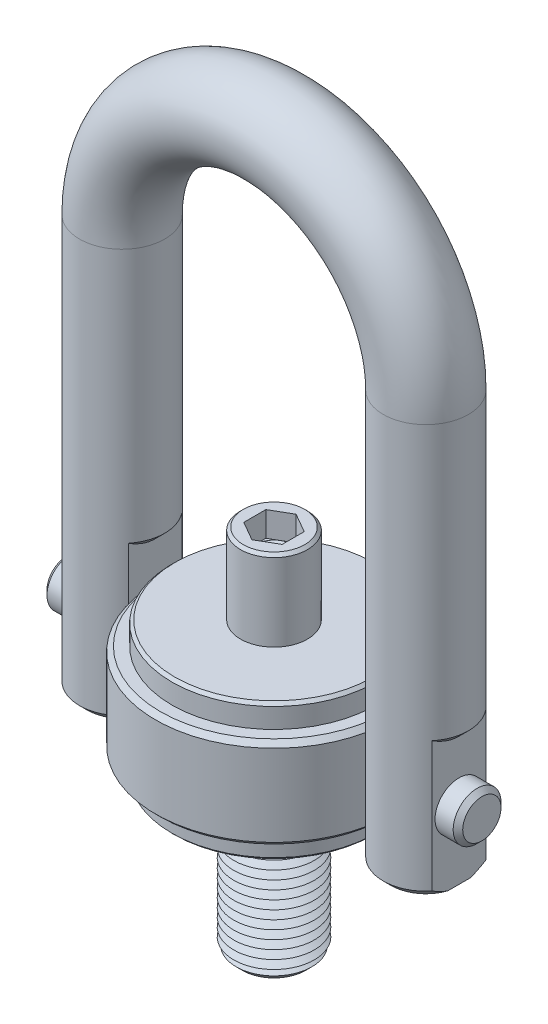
ISO-10303-21;
HEADER;
FILE_DESCRIPTION(('STEP AP214'),'2;1');
FILE_NAME('part.step','',(''),(''),'','','');
FILE_SCHEMA(('AUTOMOTIVE_DESIGN { 1 0 10303 214 1 1 1 1 }'));
ENDSEC;
DATA;
#1=APPLICATION_CONTEXT('core data for automotive mechanical design processes');
#2=APPLICATION_PROTOCOL_DEFINITION('international standard','automotive_design',2000,#1);
#3=PRODUCT_CONTEXT('',#1,'mechanical');
#4=PRODUCT('Part','Part','',(#3));
#5=PRODUCT_RELATED_PRODUCT_CATEGORY('part','',(#4));
#6=PRODUCT_DEFINITION_FORMATION('','',#4);
#7=PRODUCT_DEFINITION_CONTEXT('part definition',#1,'design');
#8=PRODUCT_DEFINITION('design','',#6,#7);
#9=PRODUCT_DEFINITION_SHAPE('','',#8);
#10=(LENGTH_UNIT() NAMED_UNIT(*) SI_UNIT(.MILLI.,.METRE.));
#11=(NAMED_UNIT(*) PLANE_ANGLE_UNIT() SI_UNIT($,.RADIAN.));
#12=(NAMED_UNIT(*) SI_UNIT($,.STERADIAN.) SOLID_ANGLE_UNIT());
#13=UNCERTAINTY_MEASURE_WITH_UNIT(LENGTH_MEASURE(1.E-05),#10,'distance_accuracy_value','');
#14=(GEOMETRIC_REPRESENTATION_CONTEXT(3) GLOBAL_UNCERTAINTY_ASSIGNED_CONTEXT((#13)) GLOBAL_UNIT_ASSIGNED_CONTEXT((#10,
#11,#12)) REPRESENTATION_CONTEXT('',''));
#15=CARTESIAN_POINT('',(0.,0.,0.));
#16=DIRECTION('',(0.,0.,1.));
#17=DIRECTION('',(1.,0.,0.));
#18=AXIS2_PLACEMENT_3D('',#15,#16,#17);
#19=CARTESIAN_POINT('',(108.6,0.,0.));
#20=DIRECTION('',(-1.,0.,0.));
#21=DIRECTION('',(0.,0.,1.));
#22=AXIS2_PLACEMENT_3D('',#19,#20,#21);
#23=CYLINDRICAL_SURFACE('',#22,12.5);
#24=CARTESIAN_POINT('',(-106.1,0.,0.));
#25=DIRECTION('',(1.,0.,0.));
#26=DIRECTION('',(0.,0.,-1.));
#27=AXIS2_PLACEMENT_3D('',#24,#25,#26);
#28=CIRCLE('',#27,12.5);
#29=CARTESIAN_POINT('',(-106.1,0.,12.5));
#30=VERTEX_POINT('',#29);
#31=EDGE_CURVE('P0_E25',#30,#30,#28,.T.);
#32=CARTESIAN_POINT('',(106.1,0.,0.));
#33=DIRECTION('',(1.,0.,0.));
#34=DIRECTION('',(0.,0.,-1.));
#35=AXIS2_PLACEMENT_3D('',#32,#33,#34);
#36=CIRCLE('',#35,12.5);
#37=CARTESIAN_POINT('',(106.1,0.,12.5));
#38=VERTEX_POINT('',#37);
#39=EDGE_CURVE('P0_E29',#38,#38,#36,.F.);
#40=CARTESIAN_POINT('',(-106.1,0.,12.5));
#41=CARTESIAN_POINT('',(-103.889583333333,0.,12.5));
#42=CARTESIAN_POINT('',(-101.679166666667,0.,12.5));
#43=CARTESIAN_POINT('',(-97.2583333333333,0.,12.5));
#44=CARTESIAN_POINT('',(-95.0479166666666,0.,12.5));
#45=CARTESIAN_POINT('',(-90.6270833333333,0.,12.5));
#46=CARTESIAN_POINT('',(-88.4166666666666,0.,12.5));
#47=CARTESIAN_POINT('',(-83.9958333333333,0.,12.5));
#48=CARTESIAN_POINT('',(-81.7854166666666,0.,12.5));
#49=CARTESIAN_POINT('',(-77.3645833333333,0.,12.5));
#50=CARTESIAN_POINT('',(-75.1541666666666,0.,12.5));
#51=CARTESIAN_POINT('',(-70.7333333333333,0.,12.5));
#52=CARTESIAN_POINT('',(-68.5229166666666,0.,12.5));
#53=CARTESIAN_POINT('',(-64.1020833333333,0.,12.5));
#54=CARTESIAN_POINT('',(-61.8916666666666,0.,12.5));
#55=CARTESIAN_POINT('',(-57.4708333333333,0.,12.5));
#56=CARTESIAN_POINT('',(-55.2604166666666,0.,12.5));
#57=CARTESIAN_POINT('',(-50.8395833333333,0.,12.5));
#58=CARTESIAN_POINT('',(-48.6291666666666,0.,12.5));
#59=CARTESIAN_POINT('',(-44.2083333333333,0.,12.5));
#60=CARTESIAN_POINT('',(-41.9979166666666,0.,12.5));
#61=CARTESIAN_POINT('',(-37.5770833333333,0.,12.5));
#62=CARTESIAN_POINT('',(-35.3666666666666,0.,12.5));
#63=CARTESIAN_POINT('',(-30.9458333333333,0.,12.5));
#64=CARTESIAN_POINT('',(-28.7354166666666,0.,12.5));
#65=CARTESIAN_POINT('',(-24.3145833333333,0.,12.5));
#66=CARTESIAN_POINT('',(-22.1041666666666,0.,12.5));
#67=CARTESIAN_POINT('',(-17.6833333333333,0.,12.5));
#68=CARTESIAN_POINT('',(-15.4729166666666,0.,12.5));
#69=CARTESIAN_POINT('',(-11.0520833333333,0.,12.5));
#70=CARTESIAN_POINT('',(-8.84166666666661,0.,12.5));
#71=CARTESIAN_POINT('',(-4.42083333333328,0.,12.5));
#72=CARTESIAN_POINT('',(-2.21041666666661,0.,12.5));
#73=CARTESIAN_POINT('',(2.21041666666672,0.,12.5));
#74=CARTESIAN_POINT('',(4.42083333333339,0.,12.5));
#75=CARTESIAN_POINT('',(8.84166666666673,0.,12.5));
#76=CARTESIAN_POINT('',(11.0520833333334,0.,12.5));
#77=CARTESIAN_POINT('',(15.4729166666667,0.,12.5));
#78=CARTESIAN_POINT('',(17.6833333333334,0.,12.5));
#79=CARTESIAN_POINT('',(22.1041666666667,0.,12.5));
#80=CARTESIAN_POINT('',(24.3145833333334,0.,12.5));
#81=CARTESIAN_POINT('',(28.7354166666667,0.,12.5));
#82=CARTESIAN_POINT('',(30.9458333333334,0.,12.5));
#83=CARTESIAN_POINT('',(35.3666666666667,0.,12.5));
#84=CARTESIAN_POINT('',(37.5770833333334,0.,12.5));
#85=CARTESIAN_POINT('',(41.9979166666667,0.,12.5));
#86=CARTESIAN_POINT('',(44.2083333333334,0.,12.5));
#87=CARTESIAN_POINT('',(48.6291666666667,0.,12.5));
#88=CARTESIAN_POINT('',(50.8395833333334,0.,12.5));
#89=CARTESIAN_POINT('',(55.2604166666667,0.,12.5));
#90=CARTESIAN_POINT('',(57.4708333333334,0.,12.5));
#91=CARTESIAN_POINT('',(61.8916666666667,0.,12.5));
#92=CARTESIAN_POINT('',(64.1020833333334,0.,12.5));
#93=CARTESIAN_POINT('',(68.5229166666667,0.,12.5));
#94=CARTESIAN_POINT('',(70.7333333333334,0.,12.5));
#95=CARTESIAN_POINT('',(75.1541666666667,0.,12.5));
#96=CARTESIAN_POINT('',(77.3645833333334,0.,12.5));
#97=CARTESIAN_POINT('',(81.7854166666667,0.,12.5));
#98=CARTESIAN_POINT('',(83.9958333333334,0.,12.5));
#99=CARTESIAN_POINT('',(88.4166666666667,0.,12.5));
#100=CARTESIAN_POINT('',(90.6270833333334,0.,12.5));
#101=CARTESIAN_POINT('',(95.0479166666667,0.,12.5));
#102=CARTESIAN_POINT('',(97.2583333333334,0.,12.5));
#103=CARTESIAN_POINT('',(101.679166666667,0.,12.5));
#104=CARTESIAN_POINT('',(103.889583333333,0.,12.5));
#105=CARTESIAN_POINT('',(106.1,0.,12.5));
#106=B_SPLINE_CURVE_WITH_KNOTS('',3,(#40,#41,#42,#43,#44,#45,#46,#47,#48,#49,#50,#51,#52,#53,
#54,#55,#56,#57,#58,#59,#60,#61,#62,#63,#64,#65,#66,#67,#68,#69,#70,#71,#72,#73,#74,#75,#76,#77,
#78,#79,#80,#81,#82,#83,#84,#85,#86,#87,#88,#89,#90,#91,#92,#93,#94,#95,#96,#97,#98,#99,#100,
#101,#102,#103,#104,#105),.UNSPECIFIED.,.F.,.F.,(4,2,2,2,2,2,2,2,2,2,2,2,2,2,2,2,2,2,2,2,2,2,2,
2,2,2,2,2,2,2,2,2,4),(0.,6.63125,13.2625,19.89375,26.525,33.15625,39.7875,46.41875,53.05,
59.68125,66.3125,72.94375,79.575,86.20625,92.8375,99.46875,106.1,112.73125,119.3625,125.99375,
132.625,139.25625,145.8875,152.51875,159.15,165.78125,172.4125,179.04375,185.675,192.30625,
198.9375,205.56875,212.2),.UNSPECIFIED.);
#107=EDGE_CURVE('P0_BSEAM14',#30,#38,#106,.T.);
#108=ORIENTED_EDGE('',*,*,#31,.T.);
#109=ORIENTED_EDGE('',*,*,#39,.T.);
#110=ORIENTED_EDGE('',*,*,#107,.T.);
#111=ORIENTED_EDGE('',*,*,#107,.F.);
#112=EDGE_LOOP('',(#108,#110,#109,#111));
#113=FACE_BOUND('',#112,.T.);
#114=ADVANCED_FACE('P0_F14',(#113),#23,.T.);
#115=CARTESIAN_POINT('',(108.6,0.,0.));
#116=DIRECTION('',(1.,0.,0.));
#117=DIRECTION('',(0.,0.,-1.));
#118=AXIS2_PLACEMENT_3D('',#115,#116,#117);
#119=PLANE('',#118);
#120=CARTESIAN_POINT('',(108.6,0.,0.));
#121=DIRECTION('',(1.,0.,0.));
#122=DIRECTION('',(0.,0.,-1.));
#123=AXIS2_PLACEMENT_3D('',#120,#121,#122);
#124=CIRCLE('',#123,10.0000000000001);
#125=CARTESIAN_POINT('',(108.6,0.,-10.0000000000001));
#126=VERTEX_POINT('',#125);
#127=EDGE_CURVE('P0_E10',#126,#126,#124,.T.);
#128=ORIENTED_EDGE('',*,*,#127,.T.);
#129=EDGE_LOOP('',(#128));
#130=FACE_BOUND('',#129,.T.);
#131=ADVANCED_FACE('P0_F46',(#130),#119,.T.);
#132=CARTESIAN_POINT('',(-108.6,0.,0.));
#133=DIRECTION('',(1.,0.,0.));
#134=DIRECTION('',(0.,0.,-1.));
#135=AXIS2_PLACEMENT_3D('',#132,#133,#134);
#136=PLANE('',#135);
#137=CARTESIAN_POINT('',(-108.6,0.,0.));
#138=DIRECTION('',(1.,0.,0.));
#139=DIRECTION('',(0.,0.,-1.));
#140=AXIS2_PLACEMENT_3D('',#137,#138,#139);
#141=CIRCLE('',#140,9.9999999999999);
#142=CARTESIAN_POINT('',(-108.6,0.,-9.9999999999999));
#143=VERTEX_POINT('',#142);
#144=EDGE_CURVE('P0_E21',#143,#143,#141,.F.);
#145=ORIENTED_EDGE('',*,*,#144,.T.);
#146=EDGE_LOOP('',(#145));
#147=FACE_BOUND('',#146,.T.);
#148=ADVANCED_FACE('P0_F43',(#147),#136,.F.);
#149=CARTESIAN_POINT('',(-106.1,0.,0.));
#150=DIRECTION('',(1.,0.,0.));
#151=DIRECTION('',(0.,0.,-1.));
#152=AXIS2_PLACEMENT_3D('',#149,#150,#151);
#153=CONICAL_SURFACE('',#152,12.5,0.785398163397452);
#154=ORIENTED_EDGE('',*,*,#144,.F.);
#155=EDGE_LOOP('',(#154));
#156=FACE_BOUND('',#155,.T.);
#157=ORIENTED_EDGE('',*,*,#31,.F.);
#158=EDGE_LOOP('',(#157));
#159=FACE_BOUND('',#158,.T.);
#160=ADVANCED_FACE('P0_F38',(#156,#159),#153,.T.);
#161=CARTESIAN_POINT('',(108.6,0.,0.));
#162=DIRECTION('',(-1.,0.,0.));
#163=DIRECTION('',(0.,0.,1.));
#164=AXIS2_PLACEMENT_3D('',#161,#162,#163);
#165=CONICAL_SURFACE('',#164,10.0000000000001,0.785398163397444);
#166=ORIENTED_EDGE('',*,*,#39,.F.);
#167=EDGE_LOOP('',(#166));
#168=FACE_BOUND('',#167,.T.);
#169=ORIENTED_EDGE('',*,*,#127,.F.);
#170=EDGE_LOOP('',(#169));
#171=FACE_BOUND('',#170,.T.);
#172=ADVANCED_FACE('P0_F16',(#168,#171),#165,.T.);
#173=CLOSED_SHELL('',(#114,#131,#148,#160,#172));
#174=MANIFOLD_SOLID_BREP('P0_B1',#173);
#175=CARTESIAN_POINT('',(79.3500000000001,-35.6999999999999,0.));
#176=DIRECTION('',(0.,-1.,0.));
#177=DIRECTION('',(0.,0.,1.));
#178=AXIS2_PLACEMENT_3D('',#175,#176,#177);
#179=PLANE('',#178);
#180=DIRECTION('',(0.,0.,-1.));
#181=VECTOR('',#180,1.);
#182=CARTESIAN_POINT('',(62.0565763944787,-35.7,14.));
#183=LINE('',#182,#181);
#184=CARTESIAN_POINT('',(62.0565763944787,-35.7,5.83095189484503));
#185=VERTEX_POINT('',#184);
#186=CARTESIAN_POINT('',(62.0565763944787,-35.7,-5.83095189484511));
#187=VERTEX_POINT('',#186);
#188=EDGE_CURVE('P1_E132',#185,#187,#183,.T.);
#189=ORIENTED_EDGE('',*,*,#188,.T.);
#190=CARTESIAN_POINT('',(79.3500000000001,-35.6999999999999,0.));
#191=DIRECTION('',(0.,-1.,0.));
#192=DIRECTION('',(1.,0.,0.));
#193=AXIS2_PLACEMENT_3D('',#190,#191,#192);
#194=CIRCLE('',#193,18.25);
#195=CARTESIAN_POINT('',(96.6434236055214,-35.7,-5.83095189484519));
#196=VERTEX_POINT('',#195);
#197=EDGE_CURVE('P1_E192',#187,#196,#194,.T.);
#198=ORIENTED_EDGE('',*,*,#197,.T.);
#199=DIRECTION('',(0.,0.,1.));
#200=VECTOR('',#199,1.);
#201=CARTESIAN_POINT('',(96.6434236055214,-35.7,14.));
#202=LINE('',#201,#200);
#203=CARTESIAN_POINT('',(96.6434236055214,-35.7,5.83095189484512));
#204=VERTEX_POINT('',#203);
#205=EDGE_CURVE('P1_E315',#196,#204,#202,.T.);
#206=ORIENTED_EDGE('',*,*,#205,.T.);
#207=CARTESIAN_POINT('',(79.3500000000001,-35.6999999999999,0.));
#208=DIRECTION('',(0.,-1.,0.));
#209=DIRECTION('',(1.,0.,0.));
#210=AXIS2_PLACEMENT_3D('',#207,#208,#209);
#211=CIRCLE('',#210,18.25);
#212=CARTESIAN_POINT('',(79.3500000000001,-35.6999999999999,18.25));
#213=VERTEX_POINT('',#212);
#214=EDGE_CURVE('P1_E370',#204,#213,#211,.T.);
#215=ORIENTED_EDGE('',*,*,#214,.T.);
#216=CARTESIAN_POINT('',(79.3500000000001,-35.6999999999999,0.));
#217=DIRECTION('',(0.,-1.,0.));
#218=DIRECTION('',(1.,0.,0.));
#219=AXIS2_PLACEMENT_3D('',#216,#217,#218);
#220=CIRCLE('',#219,18.25);
#221=EDGE_CURVE('P1_E369',#213,#185,#220,.T.);
#222=ORIENTED_EDGE('',*,*,#221,.T.);
#223=EDGE_LOOP('',(#189,#198,#206,#215,#222));
#224=FACE_BOUND('',#223,.T.);
#225=ADVANCED_FACE('P1_F16',(#224),#179,.T.);
#226=CARTESIAN_POINT('',(79.35,179.4,0.));
#227=DIRECTION('',(0.,-1.,0.));
#228=DIRECTION('',(1.,0.,0.));
#229=AXIS2_PLACEMENT_3D('',#226,#227,#228);
#230=CYLINDRICAL_SURFACE('',#229,22.25);
#231=CARTESIAN_POINT('',(79.35,179.4,0.));
#232=DIRECTION('',(0.,-1.,0.));
#233=DIRECTION('',(0.,0.,1.));
#234=AXIS2_PLACEMENT_3D('',#231,#232,#233);
#235=CIRCLE('',#234,22.25);
#236=CARTESIAN_POINT('',(101.6,179.4,0.));
#237=VERTEX_POINT('',#236);
#238=EDGE_CURVE('P1_E143',#237,#237,#235,.T.);
#239=ORIENTED_EDGE('',*,*,#238,.T.);
#240=EDGE_LOOP('',(#239));
#241=FACE_BOUND('',#240,.T.);
#242=DIRECTION('',(0.,-1.,0.));
#243=VECTOR('',#242,1.);
#244=CARTESIAN_POINT('',(96.6434236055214,29.3,-14.));
#245=LINE('',#244,#243);
#246=CARTESIAN_POINT('',(96.6434236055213,36.3000000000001,-14.));
#247=VERTEX_POINT('',#246);
#248=CARTESIAN_POINT('',(96.6434236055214,-31.6999999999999,-14.));
#249=VERTEX_POINT('',#248);
#250=EDGE_CURVE('P1_E328',#247,#249,#245,.T.);
#251=ORIENTED_EDGE('',*,*,#250,.T.);
#252=CARTESIAN_POINT('',(79.3500000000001,-31.6999999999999,0.));
#253=DIRECTION('',(0.,-1.,0.));
#254=DIRECTION('',(0.,0.,-1.));
#255=AXIS2_PLACEMENT_3D('',#252,#253,#254);
#256=CIRCLE('',#255,22.25);
#257=CARTESIAN_POINT('',(62.0565763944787,-31.6999999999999,-14.));
#258=VERTEX_POINT('',#257);
#259=EDGE_CURVE('P1_E128',#249,#258,#256,.F.);
#260=ORIENTED_EDGE('',*,*,#259,.T.);
#261=DIRECTION('',(0.,-1.,0.));
#262=VECTOR('',#261,1.);
#263=CARTESIAN_POINT('',(62.0565763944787,39.3,-14.));
#264=LINE('',#263,#262);
#265=CARTESIAN_POINT('',(62.0565763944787,46.3000000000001,-14.));
#266=VERTEX_POINT('',#265);
#267=EDGE_CURVE('P1_E120',#266,#258,#264,.T.);
#268=ORIENTED_EDGE('',*,*,#267,.F.);
#269=CARTESIAN_POINT('',(79.35,46.3000000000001,0.));
#270=DIRECTION('',(0.,-1.,0.));
#271=DIRECTION('',(0.,0.,-1.));
#272=AXIS2_PLACEMENT_3D('',#269,#270,#271);
#273=CIRCLE('',#272,22.25);
#274=CARTESIAN_POINT('',(62.0565763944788,46.3000000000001,14.));
#275=VERTEX_POINT('',#274);
#276=EDGE_CURVE('P1_E126',#266,#275,#273,.F.);
#277=ORIENTED_EDGE('',*,*,#276,.T.);
#278=DIRECTION('',(0.,-1.,0.));
#279=VECTOR('',#278,1.);
#280=CARTESIAN_POINT('',(62.0565763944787,39.3,14.));
#281=LINE('',#280,#279);
#282=CARTESIAN_POINT('',(62.0565763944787,-31.6999999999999,14.));
#283=VERTEX_POINT('',#282);
#284=EDGE_CURVE('P1_E131',#275,#283,#281,.T.);
#285=ORIENTED_EDGE('',*,*,#284,.T.);
#286=CARTESIAN_POINT('',(79.3500000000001,-31.6999999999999,0.));
#287=DIRECTION('',(0.,-1.,0.));
#288=DIRECTION('',(0.,0.,-1.));
#289=AXIS2_PLACEMENT_3D('',#286,#287,#288);
#290=CIRCLE('',#289,22.25);
#291=CARTESIAN_POINT('',(79.3500000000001,-31.6999999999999,22.25));
#292=VERTEX_POINT('',#291);
#293=EDGE_CURVE('P1_E530',#283,#292,#290,.F.);
#294=ORIENTED_EDGE('',*,*,#293,.T.);
#295=CARTESIAN_POINT('',(79.3500000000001,-31.6999999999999,0.));
#296=DIRECTION('',(0.,-1.,0.));
#297=DIRECTION('',(0.,0.,-1.));
#298=AXIS2_PLACEMENT_3D('',#295,#296,#297);
#299=CIRCLE('',#298,22.25);
#300=CARTESIAN_POINT('',(96.6434236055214,-31.6999999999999,14.));
#301=VERTEX_POINT('',#300);
#302=EDGE_CURVE('P1_E528',#292,#301,#299,.F.);
#303=ORIENTED_EDGE('',*,*,#302,.T.);
#304=DIRECTION('',(0.,-1.,0.));
#305=VECTOR('',#304,1.);
#306=CARTESIAN_POINT('',(96.6434236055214,29.3,14.));
#307=LINE('',#306,#305);
#308=CARTESIAN_POINT('',(96.6434236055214,36.3000000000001,14.));
#309=VERTEX_POINT('',#308);
#310=EDGE_CURVE('P1_E327',#309,#301,#307,.T.);
#311=ORIENTED_EDGE('',*,*,#310,.F.);
#312=CARTESIAN_POINT('',(79.35,36.3000000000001,0.));
#313=DIRECTION('',(0.,-1.,0.));
#314=DIRECTION('',(0.,0.,-1.));
#315=AXIS2_PLACEMENT_3D('',#312,#313,#314);
#316=CIRCLE('',#315,22.25);
#317=EDGE_CURVE('P1_E142',#309,#247,#316,.F.);
#318=ORIENTED_EDGE('',*,*,#317,.T.);
#319=EDGE_LOOP('',(#251,#260,#268,#277,#285,#294,#303,#311,#318));
#320=FACE_BOUND('',#319,.T.);
#321=ADVANCED_FACE('P1_F123',(#241,#320),#230,.T.);
#322=CARTESIAN_POINT('',(-79.3500000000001,-35.7,0.));
#323=DIRECTION('',(0.,1.,0.));
#324=DIRECTION('',(0.,0.,1.));
#325=AXIS2_PLACEMENT_3D('',#322,#323,#324);
#326=PLANE('',#325);
#327=DIRECTION('',(0.,0.,1.));
#328=VECTOR('',#327,1.);
#329=CARTESIAN_POINT('',(-96.6434236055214,-35.7,14.));
#330=LINE('',#329,#328);
#331=CARTESIAN_POINT('',(-96.6434236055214,-35.7,-5.83095189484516));
#332=VERTEX_POINT('',#331);
#333=CARTESIAN_POINT('',(-96.6434236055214,-35.7,5.83095189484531));
#334=VERTEX_POINT('',#333);
#335=EDGE_CURVE('P1_E334',#332,#334,#330,.T.);
#336=ORIENTED_EDGE('',*,*,#335,.F.);
#337=CARTESIAN_POINT('',(-79.3500000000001,-35.7,0.));
#338=DIRECTION('',(0.,1.,0.));
#339=DIRECTION('',(0.,0.,1.));
#340=AXIS2_PLACEMENT_3D('',#337,#338,#339);
#341=CIRCLE('',#340,18.25);
#342=CARTESIAN_POINT('',(-62.0565763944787,-35.7,-5.83095189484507));
#343=VERTEX_POINT('',#342);
#344=EDGE_CURVE('P1_E40',#332,#343,#341,.F.);
#345=ORIENTED_EDGE('',*,*,#344,.T.);
#346=DIRECTION('',(0.,0.,-1.));
#347=VECTOR('',#346,1.);
#348=CARTESIAN_POINT('',(-62.0565763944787,-35.7,14.));
#349=LINE('',#348,#347);
#350=CARTESIAN_POINT('',(-62.0565763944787,-35.7,5.83095189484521));
#351=VERTEX_POINT('',#350);
#352=EDGE_CURVE('P1_E303',#351,#343,#349,.T.);
#353=ORIENTED_EDGE('',*,*,#352,.F.);
#354=CARTESIAN_POINT('',(-79.3500000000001,-35.7,0.));
#355=DIRECTION('',(0.,1.,0.));
#356=DIRECTION('',(0.,0.,1.));
#357=AXIS2_PLACEMENT_3D('',#354,#355,#356);
#358=CIRCLE('',#357,18.25);
#359=CARTESIAN_POINT('',(-79.3500000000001,-35.7,18.25));
#360=VERTEX_POINT('',#359);
#361=EDGE_CURVE('P1_E34',#351,#360,#358,.F.);
#362=ORIENTED_EDGE('',*,*,#361,.T.);
#363=CARTESIAN_POINT('',(-79.3500000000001,-35.7,0.));
#364=DIRECTION('',(0.,1.,0.));
#365=DIRECTION('',(0.,0.,1.));
#366=AXIS2_PLACEMENT_3D('',#363,#364,#365);
#367=CIRCLE('',#366,18.25);
#368=EDGE_CURVE('P1_E298',#360,#334,#367,.F.);
#369=ORIENTED_EDGE('',*,*,#368,.T.);
#370=EDGE_LOOP('',(#336,#345,#353,#362,#369));
#371=FACE_BOUND('',#370,.T.);
#372=ADVANCED_FACE('P1_F239',(#371),#326,.F.);
#373=CARTESIAN_POINT('',(-79.3500000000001,-35.7,0.));
#374=DIRECTION('',(0.,1.,0.));
#375=DIRECTION('',(-1.,0.,0.));
#376=AXIS2_PLACEMENT_3D('',#373,#374,#375);
#377=CYLINDRICAL_SURFACE('',#376,22.25);
#378=DIRECTION('',(0.,-1.,0.));
#379=VECTOR('',#378,1.);
#380=CARTESIAN_POINT('',(-62.0565763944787,39.3,-14.));
#381=LINE('',#380,#379);
#382=CARTESIAN_POINT('',(-62.0565763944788,46.3,-14.));
#383=VERTEX_POINT('',#382);
#384=CARTESIAN_POINT('',(-62.0565763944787,-31.7,-14.));
#385=VERTEX_POINT('',#384);
#386=EDGE_CURVE('P1_E340',#383,#385,#381,.T.);
#387=ORIENTED_EDGE('',*,*,#386,.T.);
#388=CARTESIAN_POINT('',(-79.3500000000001,-31.7,0.));
#389=DIRECTION('',(0.,1.,0.));
#390=DIRECTION('',(0.,0.,1.));
#391=AXIS2_PLACEMENT_3D('',#388,#389,#390);
#392=CIRCLE('',#391,22.25);
#393=CARTESIAN_POINT('',(-96.6434236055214,-31.7,-14.));
#394=VERTEX_POINT('',#393);
#395=EDGE_CURVE('P1_E287',#385,#394,#392,.T.);
#396=ORIENTED_EDGE('',*,*,#395,.T.);
#397=DIRECTION('',(0.,-1.,0.));
#398=VECTOR('',#397,1.);
#399=CARTESIAN_POINT('',(-96.6434236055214,29.3,-14.));
#400=LINE('',#399,#398);
#401=CARTESIAN_POINT('',(-96.6434236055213,36.3000000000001,-14.));
#402=VERTEX_POINT('',#401);
#403=EDGE_CURVE('P1_E337',#402,#394,#400,.T.);
#404=ORIENTED_EDGE('',*,*,#403,.F.);
#405=CARTESIAN_POINT('',(-79.35,36.3000000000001,0.));
#406=DIRECTION('',(0.,-1.,0.));
#407=DIRECTION('',(0.,0.,-1.));
#408=AXIS2_PLACEMENT_3D('',#405,#406,#407);
#409=CIRCLE('',#408,22.25);
#410=CARTESIAN_POINT('',(-96.6434236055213,36.3000000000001,14.));
#411=VERTEX_POINT('',#410);
#412=EDGE_CURVE('P1_E146',#402,#411,#409,.F.);
#413=ORIENTED_EDGE('',*,*,#412,.T.);
#414=DIRECTION('',(0.,-1.,0.));
#415=VECTOR('',#414,1.);
#416=CARTESIAN_POINT('',(-96.6434236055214,29.3,14.));
#417=LINE('',#416,#415);
#418=CARTESIAN_POINT('',(-96.6434236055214,-31.7000000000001,14.));
#419=VERTEX_POINT('',#418);
#420=EDGE_CURVE('P1_E308',#411,#419,#417,.T.);
#421=ORIENTED_EDGE('',*,*,#420,.T.);
#422=CARTESIAN_POINT('',(-79.3500000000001,-31.7000000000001,0.));
#423=DIRECTION('',(0.,1.,0.));
#424=DIRECTION('',(0.,0.,1.));
#425=AXIS2_PLACEMENT_3D('',#422,#423,#424);
#426=CIRCLE('',#425,22.25);
#427=CARTESIAN_POINT('',(-79.3500000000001,-31.7000000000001,22.25));
#428=VERTEX_POINT('',#427);
#429=EDGE_CURVE('P1_E284',#419,#428,#426,.T.);
#430=ORIENTED_EDGE('',*,*,#429,.T.);
#431=CARTESIAN_POINT('',(-79.3500000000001,-31.7000000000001,0.));
#432=DIRECTION('',(0.,1.,0.));
#433=DIRECTION('',(0.,0.,1.));
#434=AXIS2_PLACEMENT_3D('',#431,#432,#433);
#435=CIRCLE('',#434,22.25);
#436=CARTESIAN_POINT('',(-62.0565763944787,-31.7000000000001,14.));
#437=VERTEX_POINT('',#436);
#438=EDGE_CURVE('P1_E277',#428,#437,#435,.T.);
#439=ORIENTED_EDGE('',*,*,#438,.T.);
#440=DIRECTION('',(0.,-1.,0.));
#441=VECTOR('',#440,1.);
#442=CARTESIAN_POINT('',(-62.0565763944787,39.3,14.));
#443=LINE('',#442,#441);
#444=CARTESIAN_POINT('',(-62.0565763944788,46.3,14.));
#445=VERTEX_POINT('',#444);
#446=EDGE_CURVE('P1_E305',#445,#437,#443,.T.);
#447=ORIENTED_EDGE('',*,*,#446,.F.);
#448=CARTESIAN_POINT('',(-79.35,46.3,0.));
#449=DIRECTION('',(0.,-1.,0.));
#450=DIRECTION('',(0.,0.,-1.));
#451=AXIS2_PLACEMENT_3D('',#448,#449,#450);
#452=CIRCLE('',#451,22.25);
#453=EDGE_CURVE('P1_E155',#445,#383,#452,.F.);
#454=ORIENTED_EDGE('',*,*,#453,.T.);
#455=EDGE_LOOP('',(#387,#396,#404,#413,#421,#430,#439,#447,#454));
#456=FACE_BOUND('',#455,.T.);
#457=CARTESIAN_POINT('',(-79.35,179.4,0.));
#458=DIRECTION('',(0.,1.,0.));
#459=DIRECTION('',(0.,0.,1.));
#460=AXIS2_PLACEMENT_3D('',#457,#458,#459);
#461=CIRCLE('',#460,22.25);
#462=CARTESIAN_POINT('',(-101.6,179.4,0.));
#463=VERTEX_POINT('',#462);
#464=EDGE_CURVE('P1_E149',#463,#463,#461,.T.);
#465=ORIENTED_EDGE('',*,*,#464,.F.);
#466=EDGE_LOOP('',(#465));
#467=FACE_BOUND('',#466,.T.);
#468=ADVANCED_FACE('P1_F241',(#456,#467),#377,.T.);
#469=CARTESIAN_POINT('',(0.,179.4,0.));
#470=DIRECTION('',(0.,0.,-1.));
#471=DIRECTION('',(-1.,0.,0.));
#472=AXIS2_PLACEMENT_3D('',#469,#470,#471);
#473=TOROIDAL_SURFACE('',#472,79.35,22.25);
#474=CARTESIAN_POINT('',(0.,179.4,0.));
#475=DIRECTION('',(0.,0.,-1.));
#476=DIRECTION('',(-1.,0.,0.));
#477=AXIS2_PLACEMENT_3D('',#474,#475,#476);
#478=CIRCLE('',#477,101.6);
#479=EDGE_CURVE('',#463,#237,#478,.T.);
#480=ORIENTED_EDGE('',*,*,#464,.T.);
#481=ORIENTED_EDGE('',*,*,#238,.F.);
#482=ORIENTED_EDGE('',*,*,#479,.T.);
#483=ORIENTED_EDGE('',*,*,#479,.F.);
#484=EDGE_LOOP('',(#480,#482,#481,#483));
#485=FACE_BOUND('',#484,.T.);
#486=ADVANCED_FACE('P1_F237',(#485),#473,.T.);
#487=CARTESIAN_POINT('',(-62.0565763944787,39.3,14.));
#488=DIRECTION('',(-1.,0.,0.));
#489=DIRECTION('',(0.,0.,1.));
#490=AXIS2_PLACEMENT_3D('',#487,#488,#489);
#491=PLANE('',#490);
#492=CARTESIAN_POINT('',(-62.0565763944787,0.,0.));
#493=DIRECTION('',(-1.,0.,0.));
#494=DIRECTION('',(0.,0.,1.));
#495=AXIS2_PLACEMENT_3D('',#492,#493,#494);
#496=CIRCLE('',#495,12.5);
#497=CARTESIAN_POINT('',(-62.0565763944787,0.,12.5));
#498=VERTEX_POINT('',#497);
#499=EDGE_CURVE('P1_E313',#498,#498,#496,.T.);
#500=ORIENTED_EDGE('',*,*,#499,.T.);
#501=EDGE_LOOP('',(#500));
#502=FACE_BOUND('',#501,.T.);
#503=ORIENTED_EDGE('',*,*,#352,.T.);
#504=CARTESIAN_POINT('',(-62.0565763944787,-35.7,-5.83095189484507));
#505=CARTESIAN_POINT('',(-62.0565763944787,-35.58398574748,-6.19401937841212));
#506=CARTESIAN_POINT('',(-62.0565763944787,-35.4591933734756,-6.55418682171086));
#507=CARTESIAN_POINT('',(-62.0565763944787,-35.1940757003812,-7.26858296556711));
#508=CARTESIAN_POINT('',(-62.0565763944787,-35.0537576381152,-7.62281434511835));
#509=CARTESIAN_POINT('',(-62.0565763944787,-34.7600585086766,-8.32420425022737));
#510=CARTESIAN_POINT('',(-62.0565763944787,-34.6067289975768,-8.67138450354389));
#511=CARTESIAN_POINT('',(-62.0565763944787,-34.2882447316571,-9.36031187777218));
#512=CARTESIAN_POINT('',(-62.0565763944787,-34.1230885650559,-9.70205834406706));
#513=CARTESIAN_POINT('',(-62.0565763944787,-33.7827181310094,-10.3799111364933));
#514=CARTESIAN_POINT('',(-62.0565763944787,-33.6075177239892,-10.7160244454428));
#515=CARTESIAN_POINT('',(-62.0565763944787,-33.2481701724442,-11.3834225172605));
#516=CARTESIAN_POINT('',(-62.0565763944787,-33.0640230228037,-11.7147072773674));
#517=CARTESIAN_POINT('',(-62.0565763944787,-32.6871902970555,-12.3740913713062));
#518=CARTESIAN_POINT('',(-62.0565763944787,-32.494474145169,-12.702173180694));
#519=CARTESIAN_POINT('',(-62.0565763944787,-32.1021630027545,-13.3541357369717));
#520=CARTESIAN_POINT('',(-62.0565763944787,-31.9025690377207,-13.6780171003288));
#521=CARTESIAN_POINT('',(-62.0565763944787,-31.7,-14.));
#522=B_SPLINE_CURVE_WITH_KNOTS('',3,(#504,#505,#506,#507,#508,#509,#510,#511,#512,#513,#514,
#515,#516,#517,#518,#519,#520,#521),.UNSPECIFIED.,.F.,.F.,(4,2,2,2,2,2,2,2,4),(0.,
1.14321450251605,2.28589835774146,3.42424887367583,4.56273550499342,5.69968723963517,
6.83663962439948,7.97803842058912,9.11926776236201),.UNSPECIFIED.);
#523=EDGE_CURVE('P1_E11',#343,#385,#522,.T.);
#524=ORIENTED_EDGE('',*,*,#523,.T.);
#525=ORIENTED_EDGE('',*,*,#386,.F.);
#526=CARTESIAN_POINT('',(-62.0565763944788,46.3,-14.));
#527=CARTESIAN_POINT('',(-62.0565763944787,46.08757975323,-13.6623513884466));
#528=CARTESIAN_POINT('',(-62.0565763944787,45.8784256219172,-13.3226161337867));
#529=CARTESIAN_POINT('',(-62.0565763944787,45.4677120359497,-12.638478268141));
#530=CARTESIAN_POINT('',(-62.0565763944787,45.2661544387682,-12.294074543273));
#531=CARTESIAN_POINT('',(-62.0565763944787,44.8709431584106,-11.598760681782));
#532=CARTESIAN_POINT('',(-62.0565763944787,44.6773276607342,-11.2478287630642));
#533=CARTESIAN_POINT('',(-62.0565763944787,44.3003266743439,-10.5405310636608));
#534=CARTESIAN_POINT('',(-62.0565763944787,44.1169405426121,-10.1841656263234));
#535=CARTESIAN_POINT('',(-62.0565763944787,43.7584088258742,-9.45835090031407));
#536=CARTESIAN_POINT('',(-62.0565763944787,43.5835025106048,-9.08878256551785));
#537=CARTESIAN_POINT('',(-62.0565763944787,43.2479479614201,-8.34323555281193));
#538=CARTESIAN_POINT('',(-62.0565763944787,43.0873009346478,-7.96725633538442));
#539=CARTESIAN_POINT('',(-62.0565763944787,42.6305688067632,-6.83050144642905));
#540=CARTESIAN_POINT('',(-62.0565763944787,42.3589507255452,-6.05944377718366));
#541=CARTESIAN_POINT('',(-62.0565763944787,41.9844305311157,-4.77597443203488));
#542=CARTESIAN_POINT('',(-62.0565763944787,41.8560447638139,-4.27094970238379));
#543=CARTESIAN_POINT('',(-62.0565763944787,41.6395093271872,-3.25203170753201));
#544=CARTESIAN_POINT('',(-62.0565763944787,41.5513652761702,-2.7381372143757));
#545=CARTESIAN_POINT('',(-62.0565763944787,41.4528477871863,-1.96507741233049));
#546=CARTESIAN_POINT('',(-62.0565763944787,41.4256638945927,-1.70796920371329));
#547=CARTESIAN_POINT('',(-62.0565763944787,41.3826139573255,-1.19281542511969));
#548=CARTESIAN_POINT('',(-62.0565763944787,41.3667466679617,-0.934769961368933));
#549=CARTESIAN_POINT('',(-62.0565763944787,41.3465580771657,-0.418324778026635));
#550=CARTESIAN_POINT('',(-62.0565763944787,41.3422326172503,-0.159925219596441));
#551=CARTESIAN_POINT('',(-62.0565763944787,41.3451748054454,0.356781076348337));
#552=CARTESIAN_POINT('',(-62.0565763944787,41.3524409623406,0.615087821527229));
#553=CARTESIAN_POINT('',(-62.0565763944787,41.374195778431,1.04656254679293));
#554=CARTESIAN_POINT('',(-62.0565763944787,41.3855379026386,1.21989565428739));
#555=CARTESIAN_POINT('',(-62.0565763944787,41.4133359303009,1.56611318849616));
#556=CARTESIAN_POINT('',(-62.0565763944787,41.4297908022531,1.73899769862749));
#557=CARTESIAN_POINT('',(-62.0565763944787,41.4867069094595,2.25698800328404));
#558=CARTESIAN_POINT('',(-62.0565763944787,41.534712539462,2.60129233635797));
#559=CARTESIAN_POINT('',(-62.0565763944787,41.6449454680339,3.25816008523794));
#560=CARTESIAN_POINT('',(-62.0565763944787,41.7056579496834,3.57098183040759));
#561=CARTESIAN_POINT('',(-62.0565763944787,41.8419839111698,4.19337992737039));
#562=CARTESIAN_POINT('',(-62.0565763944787,41.9175993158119,4.50295585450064));
#563=CARTESIAN_POINT('',(-62.0565763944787,42.1651494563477,5.42660328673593));
#564=CARTESIAN_POINT('',(-62.0565763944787,42.3577203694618,6.03520640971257));
#565=CARTESIAN_POINT('',(-62.0565763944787,42.7889374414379,7.23901181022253));
#566=CARTESIAN_POINT('',(-62.0565763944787,43.0278137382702,7.83412984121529));
#567=CARTESIAN_POINT('',(-62.0565763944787,43.5418111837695,9.00813965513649));
#568=CARTESIAN_POINT('',(-62.0565763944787,43.816922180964,9.58703592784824));
#569=CARTESIAN_POINT('',(-62.0565763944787,44.4412729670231,10.8197450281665));
#570=CARTESIAN_POINT('',(-62.0565763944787,44.7953732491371,11.4710810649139));
#571=CARTESIAN_POINT('',(-62.0565763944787,45.3468078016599,12.4321853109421));
#572=CARTESIAN_POINT('',(-62.0565763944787,45.5330544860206,12.7484170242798));
#573=CARTESIAN_POINT('',(-62.0565763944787,45.91193665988,13.3770161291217));
#574=CARTESIAN_POINT('',(-62.0565763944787,46.1045718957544,13.6893836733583));
#575=CARTESIAN_POINT('',(-62.0565763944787,46.3000000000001,14.));
#576=B_SPLINE_CURVE_WITH_KNOTS('',3,(#526,#527,#528,#529,#530,#531,#532,#533,#534,#535,#536,
#537,#538,#539,#540,#541,#542,#543,#544,#545,#546,#547,#548,#549,#550,#551,#552,#553,#554,#555,
#556,#557,#558,#559,#560,#561,#562,#563,#564,#565,#566,#567,#568,#569,#570,#571,#572,#573,#574,
#575),.UNSPECIFIED.,.F.,.F.,(4,2,2,2,2,2,2,2,2,2,2,2,2,2,2,2,2,2,2,2,2,2,2,2,4),(0.,
1.19675006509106,2.39379088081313,3.59603752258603,4.79820850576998,6.02450807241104,
7.25091135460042,9.69880513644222,11.2607712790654,12.8229554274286,13.5983736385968,
14.3737065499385,15.1487600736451,15.9237138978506,16.444752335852,16.9656857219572,
18.0079671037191,18.9635650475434,19.919286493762,21.8319065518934,23.7542880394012,
25.6761320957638,27.8991558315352,29.0001061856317,30.1010128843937),.UNSPECIFIED.);
#577=EDGE_CURVE('P1_E138',#383,#445,#576,.T.);
#578=ORIENTED_EDGE('',*,*,#577,.T.);
#579=ORIENTED_EDGE('',*,*,#446,.T.);
#580=CARTESIAN_POINT('',(-62.0565763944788,-31.7000000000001,14.));
#581=CARTESIAN_POINT('',(-62.0565763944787,-31.9025690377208,13.6780171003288));
#582=CARTESIAN_POINT('',(-62.0565763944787,-32.1021630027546,13.3541357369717));
#583=CARTESIAN_POINT('',(-62.0565763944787,-32.4944741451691,12.702173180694));
#584=CARTESIAN_POINT('',(-62.0565763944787,-32.6871902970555,12.3740913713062));
#585=CARTESIAN_POINT('',(-62.0565763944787,-33.0640230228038,11.7147072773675));
#586=CARTESIAN_POINT('',(-62.0565763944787,-33.2481701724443,11.3834225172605));
#587=CARTESIAN_POINT('',(-62.0565763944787,-33.6075177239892,10.7160244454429));
#588=CARTESIAN_POINT('',(-62.0565763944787,-33.7827181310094,10.3799111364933));
#589=CARTESIAN_POINT('',(-62.0565763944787,-34.1230885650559,9.70205834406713));
#590=CARTESIAN_POINT('',(-62.0565763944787,-34.2882447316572,9.36031187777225));
#591=CARTESIAN_POINT('',(-62.0565763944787,-34.6067289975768,8.67138450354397));
#592=CARTESIAN_POINT('',(-62.0565763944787,-34.7600585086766,8.32420425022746));
#593=CARTESIAN_POINT('',(-62.0565763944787,-35.0537576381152,7.62281434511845));
#594=CARTESIAN_POINT('',(-62.0565763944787,-35.1940757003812,7.26858296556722));
#595=CARTESIAN_POINT('',(-62.0565763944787,-35.4591933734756,6.55418682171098));
#596=CARTESIAN_POINT('',(-62.0565763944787,-35.58398574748,6.19401937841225));
#597=CARTESIAN_POINT('',(-62.0565763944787,-35.7,5.83095189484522));
#598=B_SPLINE_CURVE_WITH_KNOTS('',3,(#580,#581,#582,#583,#584,#585,#586,#587,#588,#589,#590,
#591,#592,#593,#594,#595,#596,#597),.UNSPECIFIED.,.F.,.F.,(4,2,2,2,2,2,2,2,4),(0.,
1.14122934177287,2.28262813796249,3.41958052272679,4.55653225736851,5.69501888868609,
6.83336940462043,7.97605325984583,9.11926776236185),.UNSPECIFIED.);
#599=EDGE_CURVE('P1_E26',#437,#351,#598,.T.);
#600=ORIENTED_EDGE('',*,*,#599,.T.);
#601=EDGE_LOOP('',(#503,#524,#525,#578,#579,#600));
#602=FACE_BOUND('',#601,.T.);
#603=ADVANCED_FACE('P1_F232',(#502,#602),#491,.F.);
#604=CARTESIAN_POINT('',(-96.6434236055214,29.3,14.));
#605=DIRECTION('',(1.,0.,0.));
#606=DIRECTION('',(0.,0.,-1.));
#607=AXIS2_PLACEMENT_3D('',#604,#605,#606);
#608=PLANE('',#607);
#609=CARTESIAN_POINT('',(-96.6434236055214,0.,0.));
#610=DIRECTION('',(1.,0.,0.));
#611=DIRECTION('',(0.,0.,-1.));
#612=AXIS2_PLACEMENT_3D('',#609,#610,#611);
#613=CIRCLE('',#612,12.5);
#614=CARTESIAN_POINT('',(-96.6434236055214,0.,-12.5));
#615=VERTEX_POINT('',#614);
#616=EDGE_CURVE('P1_E321',#615,#615,#613,.F.);
#617=ORIENTED_EDGE('',*,*,#616,.F.);
#618=EDGE_LOOP('',(#617));
#619=FACE_BOUND('',#618,.T.);
#620=ORIENTED_EDGE('',*,*,#403,.T.);
#621=CARTESIAN_POINT('',(-96.6434236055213,-31.7,-14.));
#622=CARTESIAN_POINT('',(-96.6434236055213,-31.9025690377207,-13.6780171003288));
#623=CARTESIAN_POINT('',(-96.6434236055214,-32.1021630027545,-13.3541357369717));
#624=CARTESIAN_POINT('',(-96.6434236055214,-32.494474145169,-12.702173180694));
#625=CARTESIAN_POINT('',(-96.6434236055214,-32.6871902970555,-12.3740913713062));
#626=CARTESIAN_POINT('',(-96.6434236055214,-33.0640230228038,-11.7147072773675));
#627=CARTESIAN_POINT('',(-96.6434236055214,-33.2481701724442,-11.3834225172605));
#628=CARTESIAN_POINT('',(-96.6434236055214,-33.6075177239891,-10.7160244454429));
#629=CARTESIAN_POINT('',(-96.6434236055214,-33.7827181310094,-10.3799111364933));
#630=CARTESIAN_POINT('',(-96.6434236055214,-34.1230885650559,-9.70205834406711));
#631=CARTESIAN_POINT('',(-96.6434236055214,-34.2882447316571,-9.36031187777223));
#632=CARTESIAN_POINT('',(-96.6434236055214,-34.6067289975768,-8.67138450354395));
#633=CARTESIAN_POINT('',(-96.6434236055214,-34.7600585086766,-8.32420425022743));
#634=CARTESIAN_POINT('',(-96.6434236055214,-35.0537576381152,-7.62281434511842));
#635=CARTESIAN_POINT('',(-96.6434236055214,-35.1940757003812,-7.26858296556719));
#636=CARTESIAN_POINT('',(-96.6434236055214,-35.4591933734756,-6.55418682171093));
#637=CARTESIAN_POINT('',(-96.6434236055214,-35.58398574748,-6.1940193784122));
#638=CARTESIAN_POINT('',(-96.6434236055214,-35.7,-5.83095189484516));
#639=B_SPLINE_CURVE_WITH_KNOTS('',3,(#621,#622,#623,#624,#625,#626,#627,#628,#629,#630,#631,
#632,#633,#634,#635,#636,#637,#638),.UNSPECIFIED.,.F.,.F.,(4,2,2,2,2,2,2,2,4),(0.,
1.14122934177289,2.28262813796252,3.41958052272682,4.55653225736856,5.69501888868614,
6.8333694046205,7.97605325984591,9.11926776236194),.UNSPECIFIED.);
#640=EDGE_CURVE('P1_E216',#394,#332,#639,.T.);
#641=ORIENTED_EDGE('',*,*,#640,.T.);
#642=ORIENTED_EDGE('',*,*,#335,.T.);
#643=CARTESIAN_POINT('',(-96.6434236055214,-35.7,5.83095189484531));
#644=CARTESIAN_POINT('',(-96.6434236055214,-35.58398574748,6.19401937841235));
#645=CARTESIAN_POINT('',(-96.6434236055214,-35.4591933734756,6.55418682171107));
#646=CARTESIAN_POINT('',(-96.6434236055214,-35.1940757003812,7.26858296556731));
#647=CARTESIAN_POINT('',(-96.6434236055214,-35.0537576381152,7.62281434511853));
#648=CARTESIAN_POINT('',(-96.6434236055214,-34.7600585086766,8.32420425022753));
#649=CARTESIAN_POINT('',(-96.6434236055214,-34.6067289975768,8.67138450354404));
#650=CARTESIAN_POINT('',(-96.6434236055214,-34.2882447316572,9.36031187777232));
#651=CARTESIAN_POINT('',(-96.6434236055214,-34.1230885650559,9.70205834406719));
#652=CARTESIAN_POINT('',(-96.6434236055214,-33.7827181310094,10.3799111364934));
#653=CARTESIAN_POINT('',(-96.6434236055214,-33.6075177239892,10.7160244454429));
#654=CARTESIAN_POINT('',(-96.6434236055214,-33.2481701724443,11.3834225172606));
#655=CARTESIAN_POINT('',(-96.6434236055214,-33.0640230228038,11.7147072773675));
#656=CARTESIAN_POINT('',(-96.6434236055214,-32.6871902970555,12.3740913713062));
#657=CARTESIAN_POINT('',(-96.6434236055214,-32.4944741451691,12.702173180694));
#658=CARTESIAN_POINT('',(-96.6434236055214,-32.1021630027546,13.3541357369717));
#659=CARTESIAN_POINT('',(-96.6434236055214,-31.9025690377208,13.6780171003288));
#660=CARTESIAN_POINT('',(-96.6434236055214,-31.7,14.));
#661=B_SPLINE_CURVE_WITH_KNOTS('',3,(#643,#644,#645,#646,#647,#648,#649,#650,#651,#652,#653,
#654,#655,#656,#657,#658,#659,#660),.UNSPECIFIED.,.F.,.F.,(4,2,2,2,2,2,2,2,4),(0.,
1.14321450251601,2.2858983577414,3.42424887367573,4.5627355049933,5.69968723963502,
6.8366396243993,7.97803842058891,9.11926776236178),.UNSPECIFIED.);
#662=EDGE_CURVE('P1_E289',#334,#419,#661,.T.);
#663=ORIENTED_EDGE('',*,*,#662,.T.);
#664=ORIENTED_EDGE('',*,*,#420,.F.);
#665=CARTESIAN_POINT('',(-96.6434236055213,36.3000000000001,14.));
#666=CARTESIAN_POINT('',(-96.6434236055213,36.08757975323,13.6623513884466));
#667=CARTESIAN_POINT('',(-96.6434236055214,35.8784256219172,13.3226161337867));
#668=CARTESIAN_POINT('',(-96.6434236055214,35.4677120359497,12.638478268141));
#669=CARTESIAN_POINT('',(-96.6434236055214,35.2661544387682,12.294074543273));
#670=CARTESIAN_POINT('',(-96.6434236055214,34.8709431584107,11.598760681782));
#671=CARTESIAN_POINT('',(-96.6434236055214,34.6773276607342,11.2478287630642));
#672=CARTESIAN_POINT('',(-96.6434236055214,34.300326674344,10.5405310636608));
#673=CARTESIAN_POINT('',(-96.6434236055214,34.1169405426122,10.1841656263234));
#674=CARTESIAN_POINT('',(-96.6434236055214,33.7584088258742,9.45835090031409));
#675=CARTESIAN_POINT('',(-96.6434236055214,33.5835025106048,9.08878256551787));
#676=CARTESIAN_POINT('',(-96.6434236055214,33.2479479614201,8.34323555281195));
#677=CARTESIAN_POINT('',(-96.6434236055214,33.0873009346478,7.96725633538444));
#678=CARTESIAN_POINT('',(-96.6434236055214,32.6305688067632,6.83050144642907));
#679=CARTESIAN_POINT('',(-96.6434236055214,32.3589507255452,6.05944377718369));
#680=CARTESIAN_POINT('',(-96.6434236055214,31.9844305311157,4.77597443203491));
#681=CARTESIAN_POINT('',(-96.6434236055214,31.8560447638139,4.27094970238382));
#682=CARTESIAN_POINT('',(-96.6434236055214,31.6395093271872,3.25203170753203));
#683=CARTESIAN_POINT('',(-96.6434236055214,31.5513652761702,2.73813721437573));
#684=CARTESIAN_POINT('',(-96.6434236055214,31.4528477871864,1.96507741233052));
#685=CARTESIAN_POINT('',(-96.6434236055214,31.4256638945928,1.70796920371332));
#686=CARTESIAN_POINT('',(-96.6434236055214,31.3826139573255,1.19281542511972));
#687=CARTESIAN_POINT('',(-96.6434236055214,31.3667466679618,0.934769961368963));
#688=CARTESIAN_POINT('',(-96.6434236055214,31.3465580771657,0.418324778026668));
#689=CARTESIAN_POINT('',(-96.6434236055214,31.3422326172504,0.159925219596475));
#690=CARTESIAN_POINT('',(-96.6434236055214,31.3451748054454,-0.356781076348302));
#691=CARTESIAN_POINT('',(-96.6434236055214,31.3524409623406,-0.615087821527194));
#692=CARTESIAN_POINT('',(-96.6434236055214,31.374195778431,-1.0465625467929));
#693=CARTESIAN_POINT('',(-96.6434236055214,31.3855379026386,-1.21989565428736));
#694=CARTESIAN_POINT('',(-96.6434236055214,31.4133359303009,-1.56611318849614));
#695=CARTESIAN_POINT('',(-96.6434236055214,31.4297908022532,-1.73899769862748));
#696=CARTESIAN_POINT('',(-96.6434236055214,31.4867069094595,-2.25698800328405));
#697=CARTESIAN_POINT('',(-96.6434236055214,31.534712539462,-2.60129233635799));
#698=CARTESIAN_POINT('',(-96.6434236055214,31.644945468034,-3.25816008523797));
#699=CARTESIAN_POINT('',(-96.6434236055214,31.7056579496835,-3.57098183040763));
#700=CARTESIAN_POINT('',(-96.6434236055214,31.8419839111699,-4.19337992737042));
#701=CARTESIAN_POINT('',(-96.6434236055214,31.9175993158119,-4.50295585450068));
#702=CARTESIAN_POINT('',(-96.6434236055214,32.1651494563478,-5.42660328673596));
#703=CARTESIAN_POINT('',(-96.6434236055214,32.3577203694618,-6.03520640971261));
#704=CARTESIAN_POINT('',(-96.6434236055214,32.7889374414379,-7.23901181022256));
#705=CARTESIAN_POINT('',(-96.6434236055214,33.0278137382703,-7.83412984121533));
#706=CARTESIAN_POINT('',(-96.6434236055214,33.5418111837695,-9.00813965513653));
#707=CARTESIAN_POINT('',(-96.6434236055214,33.816922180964,-9.58703592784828));
#708=CARTESIAN_POINT('',(-96.6434236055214,34.4412729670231,-10.8197450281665));
#709=CARTESIAN_POINT('',(-96.6434236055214,34.7953732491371,-11.4710810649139));
#710=CARTESIAN_POINT('',(-96.6434236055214,35.3468078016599,-12.4321853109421));
#711=CARTESIAN_POINT('',(-96.6434236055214,35.5330544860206,-12.7484170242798));
#712=CARTESIAN_POINT('',(-96.6434236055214,35.9119366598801,-13.3770161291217));
#713=CARTESIAN_POINT('',(-96.6434236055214,36.1045718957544,-13.6893836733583));
#714=CARTESIAN_POINT('',(-96.6434236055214,36.3000000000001,-14.));
#715=B_SPLINE_CURVE_WITH_KNOTS('',3,(#665,#666,#667,#668,#669,#670,#671,#672,#673,#674,#675,
#676,#677,#678,#679,#680,#681,#682,#683,#684,#685,#686,#687,#688,#689,#690,#691,#692,#693,#694,
#695,#696,#697,#698,#699,#700,#701,#702,#703,#704,#705,#706,#707,#708,#709,#710,#711,#712,#713,
#714),.UNSPECIFIED.,.F.,.F.,(4,2,2,2,2,2,2,2,2,2,2,2,2,2,2,2,2,2,2,2,2,2,2,2,4),(0.,
1.19675006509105,2.39379088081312,3.596037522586,4.79820850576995,6.024508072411,
7.25091135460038,9.69880513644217,11.2607712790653,12.8229554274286,13.5983736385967,
14.3737065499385,15.1487600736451,15.9237138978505,16.444752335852,16.9656857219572,
18.0079671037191,18.9635650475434,19.919286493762,21.8319065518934,23.7542880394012,
25.6761320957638,27.8991558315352,29.0001061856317,30.1010128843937),.UNSPECIFIED.);
#716=EDGE_CURVE('P1_E251',#411,#402,#715,.T.);
#717=ORIENTED_EDGE('',*,*,#716,.T.);
#718=EDGE_LOOP('',(#620,#641,#642,#663,#664,#717));
#719=FACE_BOUND('',#718,.T.);
#720=ADVANCED_FACE('P1_F236',(#619,#719),#608,.F.);
#721=CARTESIAN_POINT('',(62.0565763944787,39.3,14.));
#722=DIRECTION('',(-1.,0.,0.));
#723=DIRECTION('',(0.,0.,1.));
#724=AXIS2_PLACEMENT_3D('',#721,#722,#723);
#725=PLANE('',#724);
#726=CARTESIAN_POINT('',(62.0565763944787,0.,0.));
#727=DIRECTION('',(-1.,0.,0.));
#728=DIRECTION('',(0.,0.,1.));
#729=AXIS2_PLACEMENT_3D('',#726,#727,#728);
#730=CIRCLE('',#729,12.5);
#731=CARTESIAN_POINT('',(62.0565763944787,0.,12.5));
#732=VERTEX_POINT('',#731);
#733=EDGE_CURVE('P1_E317',#732,#732,#730,.T.);
#734=ORIENTED_EDGE('',*,*,#733,.F.);
#735=EDGE_LOOP('',(#734));
#736=FACE_BOUND('',#735,.T.);
#737=ORIENTED_EDGE('',*,*,#267,.T.);
#738=CARTESIAN_POINT('',(62.0565763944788,-31.6999999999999,-14.));
#739=CARTESIAN_POINT('',(62.0565763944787,-31.9025690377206,-13.6780171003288));
#740=CARTESIAN_POINT('',(62.0565763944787,-32.1021630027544,-13.3541357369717));
#741=CARTESIAN_POINT('',(62.0565763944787,-32.4944741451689,-12.702173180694));
#742=CARTESIAN_POINT('',(62.0565763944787,-32.6871902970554,-12.3740913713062));
#743=CARTESIAN_POINT('',(62.0565763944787,-33.0640230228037,-11.7147072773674));
#744=CARTESIAN_POINT('',(62.0565763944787,-33.2481701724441,-11.3834225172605));
#745=CARTESIAN_POINT('',(62.0565763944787,-33.6075177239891,-10.7160244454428));
#746=CARTESIAN_POINT('',(62.0565763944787,-33.7827181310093,-10.3799111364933));
#747=CARTESIAN_POINT('',(62.0565763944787,-34.1230885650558,-9.70205834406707));
#748=CARTESIAN_POINT('',(62.0565763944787,-34.2882447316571,-9.36031187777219));
#749=CARTESIAN_POINT('',(62.0565763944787,-34.6067289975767,-8.6713845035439));
#750=CARTESIAN_POINT('',(62.0565763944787,-34.7600585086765,-8.32420425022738));
#751=CARTESIAN_POINT('',(62.0565763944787,-35.0537576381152,-7.62281434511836));
#752=CARTESIAN_POINT('',(62.0565763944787,-35.1940757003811,-7.26858296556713));
#753=CARTESIAN_POINT('',(62.0565763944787,-35.4591933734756,-6.55418682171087));
#754=CARTESIAN_POINT('',(62.0565763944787,-35.5839857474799,-6.19401937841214));
#755=CARTESIAN_POINT('',(62.0565763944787,-35.6999999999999,-5.83095189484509));
#756=B_SPLINE_CURVE_WITH_KNOTS('',3,(#738,#739,#740,#741,#742,#743,#744,#745,#746,#747,#748,
#749,#750,#751,#752,#753,#754,#755),.UNSPECIFIED.,.F.,.F.,(4,2,2,2,2,2,2,2,4),(0.,
1.14122934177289,2.28262813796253,3.41958052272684,4.55653225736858,5.69501888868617,
6.83336940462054,7.97605325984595,9.11926776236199),.UNSPECIFIED.);
#757=EDGE_CURVE('P1_E271',#258,#187,#756,.T.);
#758=ORIENTED_EDGE('',*,*,#757,.T.);
#759=ORIENTED_EDGE('',*,*,#188,.F.);
#760=CARTESIAN_POINT('',(62.0565763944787,-35.6999999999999,5.83095189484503));
#761=CARTESIAN_POINT('',(62.0565763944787,-35.5839857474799,6.19401937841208));
#762=CARTESIAN_POINT('',(62.0565763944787,-35.4591933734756,6.55418682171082));
#763=CARTESIAN_POINT('',(62.0565763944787,-35.1940757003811,7.26858296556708));
#764=CARTESIAN_POINT('',(62.0565763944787,-35.0537576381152,7.62281434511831));
#765=CARTESIAN_POINT('',(62.0565763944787,-34.7600585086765,8.32420425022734));
#766=CARTESIAN_POINT('',(62.0565763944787,-34.6067289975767,8.67138450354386));
#767=CARTESIAN_POINT('',(62.0565763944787,-34.2882447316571,9.36031187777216));
#768=CARTESIAN_POINT('',(62.0565763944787,-34.1230885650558,9.70205834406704));
#769=CARTESIAN_POINT('',(62.0565763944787,-33.7827181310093,10.3799111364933));
#770=CARTESIAN_POINT('',(62.0565763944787,-33.6075177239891,10.7160244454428));
#771=CARTESIAN_POINT('',(62.0565763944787,-33.2481701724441,11.3834225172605));
#772=CARTESIAN_POINT('',(62.0565763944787,-33.0640230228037,11.7147072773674));
#773=CARTESIAN_POINT('',(62.0565763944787,-32.6871902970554,12.3740913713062));
#774=CARTESIAN_POINT('',(62.0565763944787,-32.4944741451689,12.702173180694));
#775=CARTESIAN_POINT('',(62.0565763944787,-32.1021630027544,13.3541357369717));
#776=CARTESIAN_POINT('',(62.0565763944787,-31.9025690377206,13.6780171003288));
#777=CARTESIAN_POINT('',(62.0565763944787,-31.6999999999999,14.));
#778=B_SPLINE_CURVE_WITH_KNOTS('',3,(#760,#761,#762,#763,#764,#765,#766,#767,#768,#769,#770,
#771,#772,#773,#774,#775,#776,#777),.UNSPECIFIED.,.F.,.F.,(4,2,2,2,2,2,2,2,4),(0.,
1.14321450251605,2.28589835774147,3.42424887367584,4.56273550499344,5.6996872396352,
6.83663962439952,7.97803842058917,9.11926776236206),.UNSPECIFIED.);
#779=EDGE_CURVE('P1_E278',#185,#283,#778,.T.);
#780=ORIENTED_EDGE('',*,*,#779,.T.);
#781=ORIENTED_EDGE('',*,*,#284,.F.);
#782=CARTESIAN_POINT('',(62.0565763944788,46.3000000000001,14.));
#783=CARTESIAN_POINT('',(62.0565763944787,46.1675577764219,13.7895059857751));
#784=CARTESIAN_POINT('',(62.0565763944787,46.0364035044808,13.5782028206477));
#785=CARTESIAN_POINT('',(62.0565763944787,45.7769061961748,13.1538649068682));
#786=CARTESIAN_POINT('',(62.0565763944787,45.6485632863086,12.940830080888));
#787=CARTESIAN_POINT('',(62.0565763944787,45.2679930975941,12.2987686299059));
#788=CARTESIAN_POINT('',(62.0565763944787,45.0203598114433,11.8669993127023));
#789=CARTESIAN_POINT('',(62.0565763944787,44.5371451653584,10.9907069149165));
#790=CARTESIAN_POINT('',(62.0565763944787,44.3017210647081,10.5460968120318));
#791=CARTESIAN_POINT('',(62.0565763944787,43.8488199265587,9.64785856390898));
#792=CARTESIAN_POINT('',(62.0565763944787,43.6313403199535,9.19423172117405));
#793=CARTESIAN_POINT('',(62.0565763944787,43.2155074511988,8.27197089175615));
#794=CARTESIAN_POINT('',(62.0565763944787,43.0174016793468,7.80322454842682));
#795=CARTESIAN_POINT('',(62.0565763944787,42.6475075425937,6.85530214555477));
#796=CARTESIAN_POINT('',(62.0565763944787,42.4757226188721,6.3761247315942));
#797=CARTESIAN_POINT('',(62.0565763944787,42.1640656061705,5.40971967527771));
#798=CARTESIAN_POINT('',(62.0565763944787,42.024057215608,4.9225364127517));
#799=CARTESIAN_POINT('',(62.0565763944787,41.7800485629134,3.93935784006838));
#800=CARTESIAN_POINT('',(62.0565763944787,41.6760307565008,3.44336694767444));
#801=CARTESIAN_POINT('',(62.0565763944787,41.5200696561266,2.51406041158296));
#802=CARTESIAN_POINT('',(62.0565763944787,41.4628949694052,2.08162493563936));
#803=CARTESIAN_POINT('',(62.0565763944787,41.3805657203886,1.213532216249));
#804=CARTESIAN_POINT('',(62.0565763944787,41.3554212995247,0.777873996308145));
#805=CARTESIAN_POINT('',(62.0565763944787,41.3382492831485,-0.0908115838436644));
#806=CARTESIAN_POINT('',(62.0565763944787,41.345973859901,-0.523834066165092));
#807=CARTESIAN_POINT('',(62.0565763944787,41.3936781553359,-1.38809996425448));
#808=CARTESIAN_POINT('',(62.0565763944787,41.4336579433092,-1.81934337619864));
#809=CARTESIAN_POINT('',(62.0565763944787,41.5286746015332,-2.55634043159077));
#810=CARTESIAN_POINT('',(62.0565763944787,41.5762528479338,-2.86308389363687));
#811=CARTESIAN_POINT('',(62.0565763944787,41.6863309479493,-3.47389481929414));
#812=CARTESIAN_POINT('',(62.0565763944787,41.7488322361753,-3.7779620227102));
#813=CARTESIAN_POINT('',(62.0565763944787,41.9572772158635,-4.68557538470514));
#814=CARTESIAN_POINT('',(62.0565763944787,42.1241425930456,-5.28438903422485));
#815=CARTESIAN_POINT('',(62.0565763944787,42.5061666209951,-6.47203597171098));
#816=CARTESIAN_POINT('',(62.0565763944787,42.7217488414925,-7.06072980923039));
#817=CARTESIAN_POINT('',(62.0565763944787,43.1912575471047,-8.22238022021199));
#818=CARTESIAN_POINT('',(62.0565763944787,43.4451786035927,-8.79533900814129));
#819=CARTESIAN_POINT('',(62.0565763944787,43.9062425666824,-9.76387969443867));
#820=CARTESIAN_POINT('',(62.0565763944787,44.1058475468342,-10.1631011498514));
#821=CARTESIAN_POINT('',(62.0565763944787,44.5183067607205,-10.9545948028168));
#822=CARTESIAN_POINT('',(62.0565763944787,44.7311599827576,-11.3468675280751));
#823=CARTESIAN_POINT('',(62.0565763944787,45.1648104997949,-12.119132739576));
#824=CARTESIAN_POINT('',(62.0565763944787,45.3854376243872,-12.4992212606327));
#825=CARTESIAN_POINT('',(62.0565763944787,45.836062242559,-13.2537154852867));
#826=CARTESIAN_POINT('',(62.0565763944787,46.0660580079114,-13.6281222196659));
#827=CARTESIAN_POINT('',(62.0565763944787,46.3000000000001,-14.));
#828=B_SPLINE_CURVE_WITH_KNOTS('',3,(#782,#783,#784,#785,#786,#787,#788,#789,#790,#791,#792,
#793,#794,#795,#796,#797,#798,#799,#800,#801,#802,#803,#804,#805,#806,#807,#808,#809,#810,#811,
#812,#813,#814,#815,#816,#817,#818,#819,#820,#821,#822,#823,#824,#825,#826,#827),.UNSPECIFIED.,
.F.,.F.,(4,2,2,2,2,2,2,2,2,2,2,2,2,2,2,2,2,2,2,2,2,2,4),(0.,0.746073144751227,1.49217979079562,
2.98515333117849,4.49409757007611,6.00282539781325,7.52882700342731,9.05502794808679,
10.5745532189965,12.0933367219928,13.4008279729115,14.7087330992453,16.0067943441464,
17.3048583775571,18.2357243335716,19.1666798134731,21.0290256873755,22.9082332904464,
24.7871750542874,26.1259498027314,27.4646224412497,28.7829247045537,30.1009848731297),.UNSPECIFIED.);
#829=EDGE_CURVE('P1_E135',#275,#266,#828,.T.);
#830=ORIENTED_EDGE('',*,*,#829,.T.);
#831=EDGE_LOOP('',(#737,#758,#759,#780,#781,#830));
#832=FACE_BOUND('',#831,.T.);
#833=ADVANCED_FACE('P1_F136',(#736,#832),#725,.T.);
#834=CARTESIAN_POINT('',(96.6434236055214,29.3,14.));
#835=DIRECTION('',(1.,0.,0.));
#836=DIRECTION('',(0.,0.,-1.));
#837=AXIS2_PLACEMENT_3D('',#834,#835,#836);
#838=PLANE('',#837);
#839=CARTESIAN_POINT('',(96.6434236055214,0.,0.));
#840=DIRECTION('',(1.,0.,0.));
#841=DIRECTION('',(0.,0.,-1.));
#842=AXIS2_PLACEMENT_3D('',#839,#840,#841);
#843=CIRCLE('',#842,12.5);
#844=CARTESIAN_POINT('',(96.6434236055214,0.,-12.5));
#845=VERTEX_POINT('',#844);
#846=EDGE_CURVE('P1_E520',#845,#845,#843,.T.);
#847=ORIENTED_EDGE('',*,*,#846,.F.);
#848=EDGE_LOOP('',(#847));
#849=FACE_BOUND('',#848,.T.);
#850=ORIENTED_EDGE('',*,*,#205,.F.);
#851=CARTESIAN_POINT('',(96.6434236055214,-35.6999999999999,-5.83095189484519));
#852=CARTESIAN_POINT('',(96.6434236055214,-35.5839857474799,-6.19401937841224));
#853=CARTESIAN_POINT('',(96.6434236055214,-35.4591933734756,-6.55418682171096));
#854=CARTESIAN_POINT('',(96.6434236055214,-35.1940757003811,-7.26858296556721));
#855=CARTESIAN_POINT('',(96.6434236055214,-35.0537576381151,-7.62281434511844));
#856=CARTESIAN_POINT('',(96.6434236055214,-34.7600585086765,-8.32420425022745));
#857=CARTESIAN_POINT('',(96.6434236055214,-34.6067289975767,-8.67138450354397));
#858=CARTESIAN_POINT('',(96.6434236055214,-34.2882447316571,-9.36031187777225));
#859=CARTESIAN_POINT('',(96.6434236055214,-34.1230885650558,-9.70205834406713));
#860=CARTESIAN_POINT('',(96.6434236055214,-33.7827181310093,-10.3799111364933));
#861=CARTESIAN_POINT('',(96.6434236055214,-33.6075177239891,-10.7160244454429));
#862=CARTESIAN_POINT('',(96.6434236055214,-33.2481701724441,-11.3834225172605));
#863=CARTESIAN_POINT('',(96.6434236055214,-33.0640230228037,-11.7147072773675));
#864=CARTESIAN_POINT('',(96.6434236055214,-32.6871902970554,-12.3740913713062));
#865=CARTESIAN_POINT('',(96.6434236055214,-32.4944741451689,-12.702173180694));
#866=CARTESIAN_POINT('',(96.6434236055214,-32.1021630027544,-13.3541357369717));
#867=CARTESIAN_POINT('',(96.6434236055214,-31.9025690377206,-13.6780171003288));
#868=CARTESIAN_POINT('',(96.6434236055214,-31.6999999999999,-14.));
#869=B_SPLINE_CURVE_WITH_KNOTS('',3,(#851,#852,#853,#854,#855,#856,#857,#858,#859,#860,#861,
#862,#863,#864,#865,#866,#867,#868),.UNSPECIFIED.,.F.,.F.,(4,2,2,2,2,2,2,2,4),(0.,
1.14321450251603,2.28589835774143,3.42424887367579,4.56273550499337,5.69968723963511,
6.83663962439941,7.97803842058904,9.11926776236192),.UNSPECIFIED.);
#870=EDGE_CURVE('P1_E191',#196,#249,#869,.T.);
#871=ORIENTED_EDGE('',*,*,#870,.T.);
#872=ORIENTED_EDGE('',*,*,#250,.F.);
#873=CARTESIAN_POINT('',(96.6434236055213,36.3000000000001,-14.));
#874=CARTESIAN_POINT('',(96.6434236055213,36.1675577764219,-13.7895059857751));
#875=CARTESIAN_POINT('',(96.6434236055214,36.0364035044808,-13.5782028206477));
#876=CARTESIAN_POINT('',(96.6434236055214,35.7769061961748,-13.1538649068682));
#877=CARTESIAN_POINT('',(96.6434236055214,35.6485632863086,-12.9408300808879));
#878=CARTESIAN_POINT('',(96.6434236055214,35.2679930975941,-12.2987686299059));
#879=CARTESIAN_POINT('',(96.6434236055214,35.0203598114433,-11.8669993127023));
#880=CARTESIAN_POINT('',(96.6434236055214,34.5371451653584,-10.9907069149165));
#881=CARTESIAN_POINT('',(96.6434236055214,34.3017210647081,-10.5460968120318));
#882=CARTESIAN_POINT('',(96.6434236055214,33.8488199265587,-9.64785856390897));
#883=CARTESIAN_POINT('',(96.6434236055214,33.6313403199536,-9.19423172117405));
#884=CARTESIAN_POINT('',(96.6434236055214,33.2155074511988,-8.27197089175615));
#885=CARTESIAN_POINT('',(96.6434236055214,33.0174016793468,-7.80322454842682));
#886=CARTESIAN_POINT('',(96.6434236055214,32.6475075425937,-6.85530214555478));
#887=CARTESIAN_POINT('',(96.6434236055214,32.4757226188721,-6.37612473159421));
#888=CARTESIAN_POINT('',(96.6434236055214,32.1640656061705,-5.40971967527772));
#889=CARTESIAN_POINT('',(96.6434236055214,32.0240572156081,-4.92253641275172));
#890=CARTESIAN_POINT('',(96.6434236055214,31.7800485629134,-3.9393578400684));
#891=CARTESIAN_POINT('',(96.6434236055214,31.6760307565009,-3.44336694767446));
#892=CARTESIAN_POINT('',(96.6434236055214,31.5200696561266,-2.51406041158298));
#893=CARTESIAN_POINT('',(96.6434236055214,31.4628949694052,-2.08162493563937));
#894=CARTESIAN_POINT('',(96.6434236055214,31.3805657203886,-1.21353221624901));
#895=CARTESIAN_POINT('',(96.6434236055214,31.3554212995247,-0.777873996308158));
#896=CARTESIAN_POINT('',(96.6434236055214,31.3382492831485,0.090811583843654));
#897=CARTESIAN_POINT('',(96.6434236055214,31.345973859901,0.523834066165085));
#898=CARTESIAN_POINT('',(96.6434236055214,31.3936781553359,1.38809996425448));
#899=CARTESIAN_POINT('',(96.6434236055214,31.4336579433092,1.81934337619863));
#900=CARTESIAN_POINT('',(96.6434236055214,31.5286746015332,2.55634043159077));
#901=CARTESIAN_POINT('',(96.6434236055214,31.5762528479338,2.86308389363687));
#902=CARTESIAN_POINT('',(96.6434236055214,31.6863309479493,3.47389481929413));
#903=CARTESIAN_POINT('',(96.6434236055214,31.7488322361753,3.7779620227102));
#904=CARTESIAN_POINT('',(96.6434236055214,31.9572772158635,4.68557538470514));
#905=CARTESIAN_POINT('',(96.6434236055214,32.1241425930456,5.28438903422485));
#906=CARTESIAN_POINT('',(96.6434236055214,32.5061666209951,6.47203597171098));
#907=CARTESIAN_POINT('',(96.6434236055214,32.7217488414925,7.06072980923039));
#908=CARTESIAN_POINT('',(96.6434236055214,33.1912575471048,8.22238022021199));
#909=CARTESIAN_POINT('',(96.6434236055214,33.4451786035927,8.79533900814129));
#910=CARTESIAN_POINT('',(96.6434236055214,33.9062425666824,9.76387969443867));
#911=CARTESIAN_POINT('',(96.6434236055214,34.1058475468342,10.1631011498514));
#912=CARTESIAN_POINT('',(96.6434236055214,34.5183067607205,10.9545948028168));
#913=CARTESIAN_POINT('',(96.6434236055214,34.7311599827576,11.3468675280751));
#914=CARTESIAN_POINT('',(96.6434236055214,35.1648104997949,12.119132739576));
#915=CARTESIAN_POINT('',(96.6434236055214,35.3854376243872,12.4992212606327));
#916=CARTESIAN_POINT('',(96.6434236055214,35.836062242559,13.2537154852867));
#917=CARTESIAN_POINT('',(96.6434236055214,36.0660580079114,13.6281222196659));
#918=CARTESIAN_POINT('',(96.6434236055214,36.3000000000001,14.));
#919=B_SPLINE_CURVE_WITH_KNOTS('',3,(#873,#874,#875,#876,#877,#878,#879,#880,#881,#882,#883,
#884,#885,#886,#887,#888,#889,#890,#891,#892,#893,#894,#895,#896,#897,#898,#899,#900,#901,#902,
#903,#904,#905,#906,#907,#908,#909,#910,#911,#912,#913,#914,#915,#916,#917,#918),.UNSPECIFIED.,
.F.,.F.,(4,2,2,2,2,2,2,2,2,2,2,2,2,2,2,2,2,2,2,2,2,2,4),(0.,0.74607314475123,1.49217979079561,
2.98515333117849,4.49409757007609,6.00282539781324,7.52882700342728,9.05502794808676,
10.5745532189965,12.0933367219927,13.4008279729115,14.7087330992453,16.0067943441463,
17.3048583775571,18.2357243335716,19.166679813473,21.0290256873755,22.9082332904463,
24.7871750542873,26.1259498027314,27.4646224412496,28.7829247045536,30.1009848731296),.UNSPECIFIED.);
#920=EDGE_CURVE('P1_E139',#247,#309,#919,.T.);
#921=ORIENTED_EDGE('',*,*,#920,.T.);
#922=ORIENTED_EDGE('',*,*,#310,.T.);
#923=CARTESIAN_POINT('',(96.6434236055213,-31.6999999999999,14.));
#924=CARTESIAN_POINT('',(96.6434236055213,-31.9025690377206,13.6780171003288));
#925=CARTESIAN_POINT('',(96.6434236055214,-32.1021630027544,13.3541357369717));
#926=CARTESIAN_POINT('',(96.6434236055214,-32.4944741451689,12.702173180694));
#927=CARTESIAN_POINT('',(96.6434236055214,-32.6871902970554,12.3740913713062));
#928=CARTESIAN_POINT('',(96.6434236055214,-33.0640230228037,11.7147072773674));
#929=CARTESIAN_POINT('',(96.6434236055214,-33.2481701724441,11.3834225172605));
#930=CARTESIAN_POINT('',(96.6434236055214,-33.6075177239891,10.7160244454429));
#931=CARTESIAN_POINT('',(96.6434236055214,-33.7827181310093,10.3799111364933));
#932=CARTESIAN_POINT('',(96.6434236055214,-34.1230885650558,9.7020583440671));
#933=CARTESIAN_POINT('',(96.6434236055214,-34.2882447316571,9.36031187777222));
#934=CARTESIAN_POINT('',(96.6434236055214,-34.6067289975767,8.67138450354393));
#935=CARTESIAN_POINT('',(96.6434236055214,-34.7600585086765,8.32420425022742));
#936=CARTESIAN_POINT('',(96.6434236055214,-35.0537576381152,7.6228143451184));
#937=CARTESIAN_POINT('',(96.6434236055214,-35.1940757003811,7.26858296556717));
#938=CARTESIAN_POINT('',(96.6434236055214,-35.4591933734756,6.55418682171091));
#939=CARTESIAN_POINT('',(96.6434236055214,-35.5839857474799,6.19401937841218));
#940=CARTESIAN_POINT('',(96.6434236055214,-35.6999999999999,5.83095189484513));
#941=B_SPLINE_CURVE_WITH_KNOTS('',3,(#923,#924,#925,#926,#927,#928,#929,#930,#931,#932,#933,
#934,#935,#936,#937,#938,#939,#940),.UNSPECIFIED.,.F.,.F.,(4,2,2,2,2,2,2,2,4),(0.,
1.14122934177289,2.28262813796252,3.41958052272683,4.55653225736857,5.69501888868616,
6.83336940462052,7.97605325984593,9.11926776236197),.UNSPECIFIED.);
#942=EDGE_CURVE('P1_E185',#301,#204,#941,.T.);
#943=ORIENTED_EDGE('',*,*,#942,.T.);
#944=EDGE_LOOP('',(#850,#871,#872,#921,#922,#943));
#945=FACE_BOUND('',#944,.T.);
#946=ADVANCED_FACE('P1_F173',(#849,#945),#838,.T.);
#947=CARTESIAN_POINT('',(79.35,36.3000000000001,0.));
#948=DIRECTION('',(0.,1.,0.));
#949=DIRECTION('',(0.,0.,1.));
#950=AXIS2_PLACEMENT_3D('',#947,#948,#949);
#951=CONICAL_SURFACE('',#950,22.25,0.785398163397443);
#952=ORIENTED_EDGE('',*,*,#317,.F.);
#953=ORIENTED_EDGE('',*,*,#920,.F.);
#954=EDGE_LOOP('',(#952,#953));
#955=FACE_BOUND('',#954,.T.);
#956=ADVANCED_FACE('P1_F170',(#955),#951,.T.);
#957=CARTESIAN_POINT('',(79.35,46.3000000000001,0.));
#958=DIRECTION('',(0.,1.,0.));
#959=DIRECTION('',(0.,0.,1.));
#960=AXIS2_PLACEMENT_3D('',#957,#958,#959);
#961=CONICAL_SURFACE('',#960,22.25,0.785398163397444);
#962=ORIENTED_EDGE('',*,*,#276,.F.);
#963=ORIENTED_EDGE('',*,*,#829,.F.);
#964=EDGE_LOOP('',(#962,#963));
#965=FACE_BOUND('',#964,.T.);
#966=ADVANCED_FACE('P1_F141',(#965),#961,.T.);
#967=CARTESIAN_POINT('',(-79.35,39.3,0.));
#968=DIRECTION('',(0.,1.,0.));
#969=DIRECTION('',(0.,0.,1.));
#970=AXIS2_PLACEMENT_3D('',#967,#968,#969);
#971=CONICAL_SURFACE('',#970,15.2499999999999,0.785398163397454);
#972=ORIENTED_EDGE('',*,*,#577,.F.);
#973=ORIENTED_EDGE('',*,*,#453,.F.);
#974=EDGE_LOOP('',(#972,#973));
#975=FACE_BOUND('',#974,.T.);
#976=ADVANCED_FACE('P1_F257',(#975),#971,.T.);
#977=CARTESIAN_POINT('',(-79.35,29.3,0.));
#978=DIRECTION('',(0.,1.,0.));
#979=DIRECTION('',(0.,0.,1.));
#980=AXIS2_PLACEMENT_3D('',#977,#978,#979);
#981=CONICAL_SURFACE('',#980,15.2499999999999,0.785398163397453);
#982=ORIENTED_EDGE('',*,*,#716,.F.);
#983=ORIENTED_EDGE('',*,*,#412,.F.);
#984=EDGE_LOOP('',(#982,#983));
#985=FACE_BOUND('',#984,.T.);
#986=ADVANCED_FACE('P1_F260',(#985),#981,.T.);
#987=CARTESIAN_POINT('',(79.3500000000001,-35.6999999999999,0.));
#988=DIRECTION('',(0.,1.,0.));
#989=DIRECTION('',(0.,0.,1.));
#990=AXIS2_PLACEMENT_3D('',#987,#988,#989);
#991=CONICAL_SURFACE('',#990,18.25,0.785398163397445);
#992=ORIENTED_EDGE('',*,*,#757,.F.);
#993=ORIENTED_EDGE('',*,*,#259,.F.);
#994=ORIENTED_EDGE('',*,*,#870,.F.);
#995=ORIENTED_EDGE('',*,*,#197,.F.);
#996=EDGE_LOOP('',(#992,#993,#994,#995));
#997=FACE_BOUND('',#996,.T.);
#998=ADVANCED_FACE('P1_F205',(#997),#991,.T.);
#999=CARTESIAN_POINT('',(79.3500000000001,-35.6999999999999,0.));
#1000=DIRECTION('',(0.,1.,0.));
#1001=DIRECTION('',(0.,0.,1.));
#1002=AXIS2_PLACEMENT_3D('',#999,#1000,#1001);
#1003=CONICAL_SURFACE('',#1002,18.25,0.785398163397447);
#1004=ORIENTED_EDGE('',*,*,#942,.F.);
#1005=ORIENTED_EDGE('',*,*,#302,.F.);
#1006=DIRECTION('',(0.,0.707106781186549,0.707106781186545));
#1007=VECTOR('',#1006,1.);
#1008=CARTESIAN_POINT('',(79.3500000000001,-35.6999999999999,18.25));
#1009=LINE('',#1008,#1007);
#1010=EDGE_CURVE('P1_E231',#213,#292,#1009,.T.);
#1011=ORIENTED_EDGE('',*,*,#1010,.F.);
#1012=ORIENTED_EDGE('',*,*,#214,.F.);
#1013=EDGE_LOOP('',(#1004,#1005,#1011,#1012));
#1014=FACE_BOUND('',#1013,.T.);
#1015=ADVANCED_FACE('P1_F199',(#1014),#1003,.T.);
#1016=CARTESIAN_POINT('',(79.3500000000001,-35.6999999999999,0.));
#1017=DIRECTION('',(0.,1.,0.));
#1018=DIRECTION('',(0.,0.,1.));
#1019=AXIS2_PLACEMENT_3D('',#1016,#1017,#1018);
#1020=CONICAL_SURFACE('',#1019,18.25,0.785398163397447);
#1021=ORIENTED_EDGE('',*,*,#1010,.T.);
#1022=ORIENTED_EDGE('',*,*,#293,.F.);
#1023=ORIENTED_EDGE('',*,*,#779,.F.);
#1024=ORIENTED_EDGE('',*,*,#221,.F.);
#1025=EDGE_LOOP('',(#1021,#1022,#1023,#1024));
#1026=FACE_BOUND('',#1025,.T.);
#1027=ADVANCED_FACE('P1_F204',(#1026),#1020,.T.);
#1028=CARTESIAN_POINT('',(-79.3500000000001,-31.7,0.));
#1029=DIRECTION('',(0.,1.,0.));
#1030=DIRECTION('',(0.,0.,1.));
#1031=AXIS2_PLACEMENT_3D('',#1028,#1029,#1030);
#1032=CONICAL_SURFACE('',#1031,22.25,0.785398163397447);
#1033=ORIENTED_EDGE('',*,*,#523,.F.);
#1034=ORIENTED_EDGE('',*,*,#344,.F.);
#1035=ORIENTED_EDGE('',*,*,#640,.F.);
#1036=ORIENTED_EDGE('',*,*,#395,.F.);
#1037=EDGE_LOOP('',(#1033,#1034,#1035,#1036));
#1038=FACE_BOUND('',#1037,.T.);
#1039=ADVANCED_FACE('P1_F208',(#1038),#1032,.T.);
#1040=CARTESIAN_POINT('',(-79.3500000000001,-31.7000000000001,0.));
#1041=DIRECTION('',(0.,1.,0.));
#1042=DIRECTION('',(0.,0.,1.));
#1043=AXIS2_PLACEMENT_3D('',#1040,#1041,#1042);
#1044=CONICAL_SURFACE('',#1043,22.25,0.785398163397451);
#1045=ORIENTED_EDGE('',*,*,#599,.F.);
#1046=ORIENTED_EDGE('',*,*,#438,.F.);
#1047=DIRECTION('',(0.,0.707106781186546,0.707106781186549));
#1048=VECTOR('',#1047,1.);
#1049=CARTESIAN_POINT('',(-79.3500000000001,-35.7,18.25));
#1050=LINE('',#1049,#1048);
#1051=EDGE_CURVE('P1_E21',#360,#428,#1050,.T.);
#1052=ORIENTED_EDGE('',*,*,#1051,.F.);
#1053=ORIENTED_EDGE('',*,*,#361,.F.);
#1054=EDGE_LOOP('',(#1045,#1046,#1052,#1053));
#1055=FACE_BOUND('',#1054,.T.);
#1056=ADVANCED_FACE('P1_F18',(#1055),#1044,.T.);
#1057=CARTESIAN_POINT('',(-79.3500000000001,-31.7000000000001,0.));
#1058=DIRECTION('',(0.,1.,0.));
#1059=DIRECTION('',(0.,0.,1.));
#1060=AXIS2_PLACEMENT_3D('',#1057,#1058,#1059);
#1061=CONICAL_SURFACE('',#1060,22.25,0.78539816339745);
#1062=ORIENTED_EDGE('',*,*,#662,.F.);
#1063=ORIENTED_EDGE('',*,*,#368,.F.);
#1064=ORIENTED_EDGE('',*,*,#1051,.T.);
#1065=ORIENTED_EDGE('',*,*,#429,.F.);
#1066=EDGE_LOOP('',(#1062,#1063,#1064,#1065));
#1067=FACE_BOUND('',#1066,.T.);
#1068=ADVANCED_FACE('P1_F212',(#1067),#1061,.T.);
#1069=CARTESIAN_POINT('',(-131.998762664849,0.,0.));
#1070=DIRECTION('',(1.,0.,0.));
#1071=DIRECTION('',(0.,0.,-1.));
#1072=AXIS2_PLACEMENT_3D('',#1069,#1070,#1071);
#1073=CYLINDRICAL_SURFACE('',#1072,12.5);
#1074=ORIENTED_EDGE('',*,*,#733,.T.);
#1075=EDGE_LOOP('',(#1074));
#1076=FACE_BOUND('',#1075,.T.);
#1077=ORIENTED_EDGE('',*,*,#846,.T.);
#1078=EDGE_LOOP('',(#1077));
#1079=FACE_BOUND('',#1078,.T.);
#1080=ADVANCED_FACE('P1_F178',(#1076,#1079),#1073,.F.);
#1081=ORIENTED_EDGE('',*,*,#616,.T.);
#1082=EDGE_LOOP('',(#1081));
#1083=FACE_BOUND('',#1082,.T.);
#1084=ORIENTED_EDGE('',*,*,#499,.F.);
#1085=EDGE_LOOP('',(#1084));
#1086=FACE_BOUND('',#1085,.T.);
#1087=ADVANCED_FACE('P1_F384',(#1083,#1086),#1073,.F.);
#1088=CLOSED_SHELL('',(#225,#321,#372,#468,#486,#603,#720,#833,#946,#956,#966,#976,#986,#998,
#1015,#1027,#1039,#1056,#1068,#1080,#1087));
#1089=MANIFOLD_SOLID_BREP('P1_B1',#1088);
#1090=CARTESIAN_POINT('',(0.,64.7,0.));
#1091=DIRECTION('',(0.,1.,0.));
#1092=DIRECTION('',(0.,0.,1.));
#1093=AXIS2_PLACEMENT_3D('',#1090,#1091,#1092);
#1094=PLANE('',#1093);
#1095=CARTESIAN_POINT('',(0.,64.7,0.));
#1096=DIRECTION('',(0.,1.,0.));
#1097=DIRECTION('',(0.,0.,1.));
#1098=AXIS2_PLACEMENT_3D('',#1095,#1096,#1097);
#1099=CIRCLE('',#1098,10.);
#1100=CARTESIAN_POINT('',(5.,64.7,8.66025403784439));
#1101=VERTEX_POINT('',#1100);
#1102=CARTESIAN_POINT('',(10.,64.7,0.));
#1103=VERTEX_POINT('',#1102);
#1104=EDGE_CURVE('P2_E98',#1101,#1103,#1099,.T.);
#1105=ORIENTED_EDGE('',*,*,#1104,.F.);
#1106=DIRECTION('',(0.866025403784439,0.,-0.5));
#1107=VECTOR('',#1106,1.);
#1108=CARTESIAN_POINT('',(0.,64.7,11.5470053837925));
#1109=LINE('',#1108,#1107);
#1110=CARTESIAN_POINT('',(10.,64.7,5.77350269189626));
#1111=VERTEX_POINT('',#1110);
#1112=EDGE_CURVE('P2_E127',#1101,#1111,#1109,.T.);
#1113=ORIENTED_EDGE('',*,*,#1112,.T.);
#1114=DIRECTION('',(0.,0.,-1.));
#1115=VECTOR('',#1114,1.);
#1116=CARTESIAN_POINT('',(10.,64.7,5.77350269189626));
#1117=LINE('',#1116,#1115);
#1118=EDGE_CURVE('P2_E123',#1111,#1103,#1117,.T.);
#1119=ORIENTED_EDGE('',*,*,#1118,.T.);
#1120=EDGE_LOOP('',(#1105,#1113,#1119));
#1121=FACE_BOUND('',#1120,.T.);
#1122=ADVANCED_FACE('P2_F15',(#1121),#1094,.T.);
#1123=CARTESIAN_POINT('',(0.,64.7,0.));
#1124=DIRECTION('',(0.,1.,0.));
#1125=DIRECTION('',(0.,0.,1.));
#1126=AXIS2_PLACEMENT_3D('',#1123,#1124,#1125);
#1127=CIRCLE('',#1126,10.);
#1128=CARTESIAN_POINT('',(5.,64.7,-8.66025403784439));
#1129=VERTEX_POINT('',#1128);
#1130=EDGE_CURVE('P2_E100',#1103,#1129,#1127,.T.);
#1131=ORIENTED_EDGE('',*,*,#1130,.F.);
#1132=CARTESIAN_POINT('',(10.,64.7,-5.77350269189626));
#1133=VERTEX_POINT('',#1132);
#1134=EDGE_CURVE('P2_E112',#1103,#1133,#1117,.T.);
#1135=ORIENTED_EDGE('',*,*,#1134,.T.);
#1136=DIRECTION('',(-0.866025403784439,0.,-0.5));
#1137=VECTOR('',#1136,1.);
#1138=CARTESIAN_POINT('',(10.,64.7,-5.77350269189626));
#1139=LINE('',#1138,#1137);
#1140=EDGE_CURVE('P2_E115',#1133,#1129,#1139,.T.);
#1141=ORIENTED_EDGE('',*,*,#1140,.T.);
#1142=EDGE_LOOP('',(#1131,#1135,#1141));
#1143=FACE_BOUND('',#1142,.T.);
#1144=ADVANCED_FACE('P2_F111',(#1143),#1094,.T.);
#1145=CARTESIAN_POINT('',(-5.,64.7,-8.66025403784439));
#1146=VERTEX_POINT('',#1145);
#1147=EDGE_CURVE('P2_E117',#1129,#1146,#1127,.T.);
#1148=ORIENTED_EDGE('',*,*,#1147,.F.);
#1149=CARTESIAN_POINT('',(0.,64.7,-11.5470053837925));
#1150=VERTEX_POINT('',#1149);
#1151=EDGE_CURVE('P2_E150',#1129,#1150,#1139,.T.);
#1152=ORIENTED_EDGE('',*,*,#1151,.T.);
#1153=DIRECTION('',(-0.866025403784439,0.,0.5));
#1154=VECTOR('',#1153,1.);
#1155=CARTESIAN_POINT('',(0.,64.7,-11.5470053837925));
#1156=LINE('',#1155,#1154);
#1157=EDGE_CURVE('P2_E423',#1150,#1146,#1156,.T.);
#1158=ORIENTED_EDGE('',*,*,#1157,.T.);
#1159=EDGE_LOOP('',(#1148,#1152,#1158));
#1160=FACE_BOUND('',#1159,.T.);
#1161=ADVANCED_FACE('P2_F410',(#1160),#1094,.T.);
#1162=CARTESIAN_POINT('',(-10.,64.7,0.));
#1163=VERTEX_POINT('',#1162);
#1164=EDGE_CURVE('P2_E425',#1146,#1163,#1127,.T.);
#1165=ORIENTED_EDGE('',*,*,#1164,.F.);
#1166=CARTESIAN_POINT('',(-10.,64.7,-5.77350269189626));
#1167=VERTEX_POINT('',#1166);
#1168=EDGE_CURVE('P2_E427',#1146,#1167,#1156,.T.);
#1169=ORIENTED_EDGE('',*,*,#1168,.T.);
#1170=DIRECTION('',(0.,0.,1.));
#1171=VECTOR('',#1170,1.);
#1172=CARTESIAN_POINT('',(-10.,64.7,-5.77350269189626));
#1173=LINE('',#1172,#1171);
#1174=EDGE_CURVE('P2_E432',#1167,#1163,#1173,.T.);
#1175=ORIENTED_EDGE('',*,*,#1174,.T.);
#1176=EDGE_LOOP('',(#1165,#1169,#1175));
#1177=FACE_BOUND('',#1176,.T.);
#1178=ADVANCED_FACE('P2_F414',(#1177),#1094,.T.);
#1179=CARTESIAN_POINT('',(-5.,64.7,8.66025403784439));
#1180=VERTEX_POINT('',#1179);
#1181=EDGE_CURVE('P2_E34',#1163,#1180,#1127,.T.);
#1182=ORIENTED_EDGE('',*,*,#1181,.F.);
#1183=CARTESIAN_POINT('',(-10.,64.7,5.77350269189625));
#1184=VERTEX_POINT('',#1183);
#1185=EDGE_CURVE('P2_E431',#1163,#1184,#1173,.T.);
#1186=ORIENTED_EDGE('',*,*,#1185,.T.);
#1187=DIRECTION('',(0.866025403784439,0.,0.5));
#1188=VECTOR('',#1187,1.);
#1189=CARTESIAN_POINT('',(-10.,64.7,5.77350269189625));
#1190=LINE('',#1189,#1188);
#1191=EDGE_CURVE('P2_E435',#1184,#1180,#1190,.T.);
#1192=ORIENTED_EDGE('',*,*,#1191,.T.);
#1193=EDGE_LOOP('',(#1182,#1186,#1192));
#1194=FACE_BOUND('',#1193,.T.);
#1195=ADVANCED_FACE('P2_F362',(#1194),#1094,.T.);
#1196=CARTESIAN_POINT('',(0.,35.7,53.35));
#1197=DIRECTION('',(0.,1.,0.));
#1198=DIRECTION('',(0.,0.,1.));
#1199=AXIS2_PLACEMENT_3D('',#1196,#1197,#1198);
#1200=PLANE('',#1199);
#1201=CARTESIAN_POINT('',(0.,35.7,0.));
#1202=DIRECTION('',(0.,1.,0.));
#1203=DIRECTION('',(0.,0.,1.));
#1204=AXIS2_PLACEMENT_3D('',#1201,#1202,#1203);
#1205=CIRCLE('',#1204,51.85);
#1206=CARTESIAN_POINT('',(0.,35.7,51.85));
#1207=VERTEX_POINT('',#1206);
#1208=EDGE_CURVE('P2_E186',#1207,#1207,#1205,.T.);
#1209=ORIENTED_EDGE('',*,*,#1208,.T.);
#1210=EDGE_LOOP('',(#1209));
#1211=FACE_BOUND('',#1210,.T.);
#1212=CARTESIAN_POINT('',(0.,35.7,0.));
#1213=DIRECTION('',(0.,1.,0.));
#1214=DIRECTION('',(0.,0.,1.));
#1215=AXIS2_PLACEMENT_3D('',#1212,#1213,#1214);
#1216=CIRCLE('',#1215,17.5);
#1217=CARTESIAN_POINT('',(0.,35.7,-17.5));
#1218=VERTEX_POINT('',#1217);
#1219=EDGE_CURVE('P2_E160',#1218,#1218,#1216,.T.);
#1220=ORIENTED_EDGE('',*,*,#1219,.F.);
#1221=EDGE_LOOP('',(#1220));
#1222=FACE_BOUND('',#1221,.T.);
#1223=ADVANCED_FACE('P2_F455',(#1211,#1222),#1200,.T.);
#1224=CARTESIAN_POINT('',(0.,-35.7,0.));
#1225=DIRECTION('',(0.,-1.,0.));
#1226=DIRECTION('',(0.,0.,-1.));
#1227=AXIS2_PLACEMENT_3D('',#1224,#1225,#1226);
#1228=PLANE('',#1227);
#1229=CARTESIAN_POINT('',(0.,-35.7,0.));
#1230=DIRECTION('',(0.,1.,0.));
#1231=DIRECTION('',(0.,0.,1.));
#1232=AXIS2_PLACEMENT_3D('',#1229,#1230,#1231);
#1233=CIRCLE('',#1232,21.);
#1234=CARTESIAN_POINT('',(0.,-35.7,21.));
#1235=VERTEX_POINT('',#1234);
#1236=EDGE_CURVE('P2_E106',#1235,#1235,#1233,.T.);
#1237=ORIENTED_EDGE('',*,*,#1236,.T.);
#1238=EDGE_LOOP('',(#1237));
#1239=FACE_BOUND('',#1238,.T.);
#1240=CARTESIAN_POINT('',(0.,-35.7,0.));
#1241=DIRECTION('',(0.,-1.,0.));
#1242=DIRECTION('',(0.,0.,-1.));
#1243=AXIS2_PLACEMENT_3D('',#1240,#1241,#1242);
#1244=CIRCLE('',#1243,51.85);
#1245=CARTESIAN_POINT('',(0.,-35.7,-51.85));
#1246=VERTEX_POINT('',#1245);
#1247=EDGE_CURVE('P2_E183',#1246,#1246,#1244,.T.);
#1248=ORIENTED_EDGE('',*,*,#1247,.T.);
#1249=EDGE_LOOP('',(#1248));
#1250=FACE_BOUND('',#1249,.T.);
#1251=ADVANCED_FACE('P2_F459',(#1239,#1250),#1228,.T.);
#1252=CARTESIAN_POINT('',(0.,59.0086077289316,0.));
#1253=DIRECTION('',(0.,1.,0.));
#1254=DIRECTION('',(0.,0.,1.));
#1255=AXIS2_PLACEMENT_3D('',#1252,#1253,#1254);
#1256=CYLINDRICAL_SURFACE('',#1255,53.35);
#1257=CARTESIAN_POINT('',(0.,-34.2,0.));
#1258=DIRECTION('',(0.,-1.,0.));
#1259=DIRECTION('',(0.,0.,-1.));
#1260=AXIS2_PLACEMENT_3D('',#1257,#1258,#1259);
#1261=CIRCLE('',#1260,53.35);
#1262=CARTESIAN_POINT('',(0.,-34.2,-53.35));
#1263=VERTEX_POINT('',#1262);
#1264=EDGE_CURVE('P2_E163',#1263,#1263,#1261,.F.);
#1265=ORIENTED_EDGE('',*,*,#1264,.T.);
#1266=EDGE_LOOP('',(#1265));
#1267=FACE_BOUND('',#1266,.T.);
#1268=CARTESIAN_POINT('',(0.,-23.8,0.));
#1269=DIRECTION('',(0.,1.,0.));
#1270=DIRECTION('',(0.,0.,1.));
#1271=AXIS2_PLACEMENT_3D('',#1268,#1269,#1270);
#1272=CIRCLE('',#1271,53.35);
#1273=CARTESIAN_POINT('',(0.,-23.8,53.35));
#1274=VERTEX_POINT('',#1273);
#1275=EDGE_CURVE('P2_E167',#1274,#1274,#1272,.T.);
#1276=ORIENTED_EDGE('',*,*,#1275,.F.);
#1277=EDGE_LOOP('',(#1276));
#1278=FACE_BOUND('',#1277,.T.);
#1279=ADVANCED_FACE('P2_F465',(#1267,#1278),#1256,.T.);
#1280=CARTESIAN_POINT('',(0.,-23.8,53.35));
#1281=DIRECTION('',(0.,-1.,0.));
#1282=DIRECTION('',(0.,0.,-1.));
#1283=AXIS2_PLACEMENT_3D('',#1280,#1281,#1282);
#1284=PLANE('',#1283);
#1285=CARTESIAN_POINT('',(0.,-23.8,0.));
#1286=DIRECTION('',(0.,-1.,0.));
#1287=DIRECTION('',(0.,0.,-1.));
#1288=AXIS2_PLACEMENT_3D('',#1285,#1286,#1287);
#1289=CIRCLE('',#1288,59.35);
#1290=CARTESIAN_POINT('',(0.,-23.8,-59.35));
#1291=VERTEX_POINT('',#1290);
#1292=EDGE_CURVE('P2_E176',#1291,#1291,#1289,.T.);
#1293=ORIENTED_EDGE('',*,*,#1292,.T.);
#1294=EDGE_LOOP('',(#1293));
#1295=FACE_BOUND('',#1294,.T.);
#1296=ORIENTED_EDGE('',*,*,#1275,.T.);
#1297=EDGE_LOOP('',(#1296));
#1298=FACE_BOUND('',#1297,.T.);
#1299=ADVANCED_FACE('P2_F403',(#1295,#1298),#1284,.T.);
#1300=CARTESIAN_POINT('',(0.,59.0086077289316,0.));
#1301=DIRECTION('',(0.,1.,0.));
#1302=DIRECTION('',(0.,0.,1.));
#1303=AXIS2_PLACEMENT_3D('',#1300,#1301,#1302);
#1304=CYLINDRICAL_SURFACE('',#1303,61.85);
#1305=CARTESIAN_POINT('',(-61.85,12.5,0.));
#1306=CARTESIAN_POINT('',(-61.8500036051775,12.5000070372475,-0.347394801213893));
#1307=CARTESIAN_POINT('',(-61.8470681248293,12.4855143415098,-0.694701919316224));
#1308=CARTESIAN_POINT('',(-61.8354160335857,12.4276726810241,-1.3869110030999));
#1309=CARTESIAN_POINT('',(-61.826698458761,12.384318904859,-1.73181255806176));
#1310=CARTESIAN_POINT('',(-61.8037128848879,12.2690502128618,-2.41684882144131));
#1311=CARTESIAN_POINT('',(-61.789441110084,12.1971158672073,-2.7569801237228));
#1312=CARTESIAN_POINT('',(-61.7557458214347,12.0252542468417,-3.42984346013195));
#1313=CARTESIAN_POINT('',(-61.7363221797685,11.9253262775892,-3.76257531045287));
#1314=CARTESIAN_POINT('',(-61.692882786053,11.6983618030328,-4.41797244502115));
#1315=CARTESIAN_POINT('',(-61.6688716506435,11.5713525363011,-4.74064747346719));
#1316=CARTESIAN_POINT('',(-61.6169037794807,11.2911150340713,-5.37407331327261));
#1317=CARTESIAN_POINT('',(-61.5889470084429,11.1378865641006,-5.68482401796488));
#1318=CARTESIAN_POINT('',(-61.5298526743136,10.8063344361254,-6.29228601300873));
#1319=CARTESIAN_POINT('',(-61.498715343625,10.6280126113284,-6.58899832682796));
#1320=CARTESIAN_POINT('',(-61.4341033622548,10.2475212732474,-7.1664400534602));
#1321=CARTESIAN_POINT('',(-61.4006287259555,10.0453519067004,-7.44716956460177));
#1322=CARTESIAN_POINT('',(-61.3318233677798,9.61589941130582,-7.99417800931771));
#1323=CARTESIAN_POINT('',(-61.2964747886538,9.3883361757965,-8.26023482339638));
#1324=CARTESIAN_POINT('',(-61.2252897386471,8.91173985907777,-8.77229925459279));
#1325=CARTESIAN_POINT('',(-61.1894532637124,8.66270659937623,-9.01830670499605));
#1326=CARTESIAN_POINT('',(-61.118287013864,8.14483133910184,-9.48862897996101));
#1327=CARTESIAN_POINT('',(-61.0829572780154,7.87598782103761,-9.71294213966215));
#1328=CARTESIAN_POINT('',(-61.0137974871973,7.32031186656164,-10.1383166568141));
#1329=CARTESIAN_POINT('',(-60.9799674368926,7.03347937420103,-10.3393779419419));
#1330=CARTESIAN_POINT('',(-60.9144605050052,6.44099910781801,-10.718600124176));
#1331=CARTESIAN_POINT('',(-60.8828066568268,6.13520075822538,-10.8965298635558));
#1332=CARTESIAN_POINT('',(-60.8229272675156,5.50935462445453,-11.2259548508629));
#1333=CARTESIAN_POINT('',(-60.794701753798,5.18930672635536,-11.377449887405));
#1334=CARTESIAN_POINT('',(-60.7425176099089,4.53723894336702,-11.652841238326));
#1335=CARTESIAN_POINT('',(-60.7185586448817,4.20522000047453,-11.7767397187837));
#1336=CARTESIAN_POINT('',(-60.6756253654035,3.53156948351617,-11.9959775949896));
#1337=CARTESIAN_POINT('',(-60.6566509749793,3.18993805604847,-12.0913174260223));
#1338=CARTESIAN_POINT('',(-60.6244807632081,2.50417619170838,-12.2515888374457));
#1339=CARTESIAN_POINT('',(-60.6112110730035,2.16014023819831,-12.3169099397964));
#1340=CARTESIAN_POINT('',(-60.5904832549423,1.46762876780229,-12.4184754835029));
#1341=CARTESIAN_POINT('',(-60.5830250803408,1.11915328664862,-12.4547201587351));
#1342=CARTESIAN_POINT('',(-60.5741457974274,0.420345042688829,-12.4978337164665));
#1343=CARTESIAN_POINT('',(-60.5727241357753,0.070012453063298,-12.5047052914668));
#1344=CARTESIAN_POINT('',(-60.5759594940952,-0.629963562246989,-12.4890230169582));
#1345=CARTESIAN_POINT('',(-60.5806164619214,-0.979606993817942,-12.4664694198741));
#1346=CARTESIAN_POINT('',(-60.5957499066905,-1.67025992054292,-12.3926985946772));
#1347=CARTESIAN_POINT('',(-60.6061354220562,-2.01131937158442,-12.3419293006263));
#1348=CARTESIAN_POINT('',(-60.6323585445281,-2.68787409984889,-12.2124507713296));
#1349=CARTESIAN_POINT('',(-60.6481960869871,-3.02336944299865,-12.1337418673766));
#1350=CARTESIAN_POINT('',(-60.6848662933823,-3.68647605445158,-11.9489899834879));
#1351=CARTESIAN_POINT('',(-60.7056991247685,-4.01408705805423,-11.8429460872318));
#1352=CARTESIAN_POINT('',(-60.7517647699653,-4.65917851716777,-11.6043237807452));
#1353=CARTESIAN_POINT('',(-60.7769976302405,-4.97665886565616,-11.4717450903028));
#1354=CARTESIAN_POINT('',(-60.8313387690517,-5.6015019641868,-11.1800212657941));
#1355=CARTESIAN_POINT('',(-60.8604725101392,-5.90878010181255,-11.0206996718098));
#1356=CARTESIAN_POINT('',(-60.9216594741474,-6.50885536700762,-10.6772801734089));
#1357=CARTESIAN_POINT('',(-60.9537127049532,-6.80165245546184,-10.4931822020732));
#1358=CARTESIAN_POINT('',(-61.0198512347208,-7.37086672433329,-10.1014700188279));
#1359=CARTESIAN_POINT('',(-61.0539367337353,-7.6472822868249,-9.89385348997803));
#1360=CARTESIAN_POINT('',(-61.123200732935,-8.18189708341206,-9.45652326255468));
#1361=CARTESIAN_POINT('',(-61.1583792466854,-8.44009609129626,-9.22680928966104));
#1362=CARTESIAN_POINT('',(-61.2295202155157,-8.94115690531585,-8.74238892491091));
#1363=CARTESIAN_POINT('',(-61.265485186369,-9.18364915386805,-8.48730048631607));
#1364=CARTESIAN_POINT('',(-61.3365454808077,-9.64632492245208,-7.95751864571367));
#1365=CARTESIAN_POINT('',(-61.371640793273,-9.86650815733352,-7.68282499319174));
#1366=CARTESIAN_POINT('',(-61.4399789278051,-10.2830312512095,-7.11569052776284));
#1367=CARTESIAN_POINT('',(-61.4732217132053,-10.4793706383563,-6.82324936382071));
#1368=CARTESIAN_POINT('',(-61.5369213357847,-10.8467938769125,-6.2226199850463));
#1369=CARTESIAN_POINT('',(-61.5673781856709,-11.0178778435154,-5.91443184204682));
#1370=CARTESIAN_POINT('',(-61.6246952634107,-11.3337878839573,-5.2839180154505));
#1371=CARTESIAN_POINT('',(-61.6515495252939,-11.4785705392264,-4.9615700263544));
#1372=CARTESIAN_POINT('',(-61.7008393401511,-11.7404268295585,-4.30547703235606));
#1373=CARTESIAN_POINT('',(-61.7232748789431,-11.8575003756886,-3.97173199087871));
#1374=CARTESIAN_POINT('',(-61.7630830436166,-12.0630053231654,-3.29527613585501));
#1375=CARTESIAN_POINT('',(-61.78045618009,-12.1514396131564,-2.95256623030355));
#1376=CARTESIAN_POINT('',(-61.8096417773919,-12.2989655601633,-2.26065608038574));
#1377=CARTESIAN_POINT('',(-61.8214543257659,-12.35805767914,-1.91145593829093));
#1378=CARTESIAN_POINT('',(-61.8390257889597,-12.4456586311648,-1.21515462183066));
#1379=CARTESIAN_POINT('',(-61.8448846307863,-12.4746724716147,-0.868119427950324));
#1380=CARTESIAN_POINT('',(-61.8507357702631,-12.5036482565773,-0.172790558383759));
#1381=CARTESIAN_POINT('',(-61.850728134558,-12.5036105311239,0.175503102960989));
#1382=CARTESIAN_POINT('',(-61.8448467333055,-12.4744847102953,0.870803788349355));
#1383=CARTESIAN_POINT('',(-61.8389732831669,-12.4453981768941,1.2178108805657));
#1384=CARTESIAN_POINT('',(-61.8215256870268,-12.3584121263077,1.90804811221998));
#1385=CARTESIAN_POINT('',(-61.8099515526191,-12.3005126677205,2.2512782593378));
#1386=CARTESIAN_POINT('',(-61.7815584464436,-12.1570290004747,2.92836128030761));
#1387=CARTESIAN_POINT('',(-61.764788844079,-12.0717051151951,3.2622714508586));
#1388=CARTESIAN_POINT('',(-61.7264303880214,-11.8738837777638,3.92165314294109));
#1389=CARTESIAN_POINT('',(-61.7048415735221,-11.7613865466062,4.24712473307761));
#1390=CARTESIAN_POINT('',(-61.6574292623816,-11.5100522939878,4.88743241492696));
#1391=CARTESIAN_POINT('',(-61.6316055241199,-11.3712137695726,5.20226789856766));
#1392=CARTESIAN_POINT('',(-61.5764204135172,-11.0682081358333,5.8191813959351));
#1393=CARTESIAN_POINT('',(-61.5470589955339,-10.9040406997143,6.12125924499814));
#1394=CARTESIAN_POINT('',(-61.4852022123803,-10.5493343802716,6.71434420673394));
#1395=CARTESIAN_POINT('',(-61.4526723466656,-10.3584923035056,7.00516640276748));
#1396=CARTESIAN_POINT('',(-61.3856830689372,-9.95336534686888,7.56975859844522));
#1397=CARTESIAN_POINT('',(-61.3512236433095,-9.7390803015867,7.84352847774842));
#1398=CARTESIAN_POINT('',(-61.2813134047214,-9.28850868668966,8.37223105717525));
#1399=CARTESIAN_POINT('',(-61.2458624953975,-9.05221997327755,8.62716191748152));
#1400=CARTESIAN_POINT('',(-61.1749428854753,-8.55924192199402,9.11646820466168));
#1401=CARTESIAN_POINT('',(-61.1394741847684,-8.30255245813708,9.35084350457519));
#1402=CARTESIAN_POINT('',(-61.0689488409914,-7.7663203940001,9.80095417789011));
#1403=CARTESIAN_POINT('',(-61.0339072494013,-7.48648383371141,10.0163418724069));
#1404=CARTESIAN_POINT('',(-60.9658151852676,-6.90942788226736,10.4227805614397));
#1405=CARTESIAN_POINT('',(-60.9327647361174,-6.61220828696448,10.6138312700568));
#1406=CARTESIAN_POINT('',(-60.8696130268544,-6.00243511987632,10.9702084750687));
#1407=CARTESIAN_POINT('',(-60.8395116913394,-5.68988194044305,11.1355356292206));
#1408=CARTESIAN_POINT('',(-60.7831410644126,-5.05161066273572,11.4392364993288));
#1409=CARTESIAN_POINT('',(-60.7568717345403,-4.72589269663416,11.5776104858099));
#1410=CARTESIAN_POINT('',(-60.709074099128,-4.06535297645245,11.8256799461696));
#1411=CARTESIAN_POINT('',(-60.6875213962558,-3.73058864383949,11.9355235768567));
#1412=CARTESIAN_POINT('',(-60.6496249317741,-3.05270546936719,12.1266234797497));
#1413=CARTESIAN_POINT('',(-60.6332811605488,-2.70958664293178,12.2078798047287));
#1414=CARTESIAN_POINT('',(-60.6062983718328,-2.01753142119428,12.3411396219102));
#1415=CARTESIAN_POINT('',(-60.5956587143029,-1.66859568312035,12.3931463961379));
#1416=CARTESIAN_POINT('',(-60.5804062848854,-0.967448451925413,12.4674905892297));
#1417=CARTESIAN_POINT('',(-60.5757934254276,-0.615237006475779,12.4898284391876));
#1418=CARTESIAN_POINT('',(-60.5727638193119,0.0832926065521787,12.5045124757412));
#1419=CARTESIAN_POINT('',(-60.5742336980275,0.429598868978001,12.4974074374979));
#1420=CARTESIAN_POINT('',(-60.5830704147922,1.12034947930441,12.454499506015));
#1421=CARTESIAN_POINT('',(-60.5904371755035,1.4647938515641,12.4186969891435));
#1422=CARTESIAN_POINT('',(-60.6108502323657,2.14935464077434,12.3186822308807));
#1423=CARTESIAN_POINT('',(-60.6238964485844,2.48947111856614,12.2544703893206));
#1424=CARTESIAN_POINT('',(-60.6552863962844,3.16297892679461,12.098143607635));
#1425=CARTESIAN_POINT('',(-60.6736301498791,3.49637022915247,12.0060285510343));
#1426=CARTESIAN_POINT('',(-60.7150306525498,4.15326845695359,11.7948753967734));
#1427=CARTESIAN_POINT('',(-60.7380752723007,4.47679840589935,11.6759065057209));
#1428=CARTESIAN_POINT('',(-60.7882500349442,5.11266157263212,11.4118014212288));
#1429=CARTESIAN_POINT('',(-60.8153801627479,5.42499483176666,11.2666653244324));
#1430=CARTESIAN_POINT('',(-60.8729663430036,6.03640452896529,10.9512626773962));
#1431=CARTESIAN_POINT('',(-60.9034226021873,6.33548014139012,10.7809945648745));
#1432=CARTESIAN_POINT('',(-60.9668169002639,6.91839764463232,10.4165223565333));
#1433=CARTESIAN_POINT('',(-60.9997549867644,7.20223924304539,10.2223178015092));
#1434=CARTESIAN_POINT('',(-61.0677977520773,7.75762220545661,9.80772415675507));
#1435=CARTESIAN_POINT('',(-61.1029300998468,8.02886485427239,9.58693934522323));
#1436=CARTESIAN_POINT('',(-61.1738479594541,8.55186047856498,9.12347346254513));
#1437=CARTESIAN_POINT('',(-61.2096334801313,8.80361319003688,8.88079209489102));
#1438=CARTESIAN_POINT('',(-61.2808711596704,9.28598953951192,8.37511336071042));
#1439=CARTESIAN_POINT('',(-61.3163232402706,9.51660832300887,8.11211135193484));
#1440=CARTESIAN_POINT('',(-61.385903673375,9.95507597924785,7.56760517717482));
#1441=CARTESIAN_POINT('',(-61.4200320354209,10.162925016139,7.28610114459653));
#1442=CARTESIAN_POINT('',(-61.4863763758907,10.5565159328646,6.70335133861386));
#1443=CARTESIAN_POINT('',(-61.5185678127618,10.741995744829,6.40192566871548));
#1444=CARTESIAN_POINT('',(-61.5797209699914,11.0868544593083,5.78418522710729));
#1445=CARTESIAN_POINT('',(-61.6086827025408,11.2462334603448,5.46787051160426));
#1446=CARTESIAN_POINT('',(-61.6625303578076,11.5375759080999,4.82280637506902));
#1447=CARTESIAN_POINT('',(-61.6874194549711,11.6695607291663,4.49406688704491));
#1448=CARTESIAN_POINT('',(-61.7324331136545,11.9052140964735,3.82638934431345));
#1449=CARTESIAN_POINT('',(-61.7525585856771,12.008888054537,3.48745325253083));
#1450=CARTESIAN_POINT('',(-61.7960838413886,12.2311437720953,2.63229188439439));
#1451=CARTESIAN_POINT('',(-61.8161966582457,12.3318259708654,2.11113327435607));
#1452=CARTESIAN_POINT('',(-61.8431517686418,12.4662476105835,1.05991492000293));
#1453=CARTESIAN_POINT('',(-61.8499945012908,12.4999892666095,0.5298554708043));
#1454=CARTESIAN_POINT('',(-61.85,12.5,0.));
#1455=B_SPLINE_CURVE_WITH_KNOTS('',3,(#1305,#1306,#1307,#1308,#1309,#1310,#1311,#1312,#1313,
#1314,#1315,#1316,#1317,#1318,#1319,#1320,#1321,#1322,#1323,#1324,#1325,#1326,#1327,#1328,#1329,
#1330,#1331,#1332,#1333,#1334,#1335,#1336,#1337,#1338,#1339,#1340,#1341,#1342,#1343,#1344,#1345,
#1346,#1347,#1348,#1349,#1350,#1351,#1352,#1353,#1354,#1355,#1356,#1357,#1358,#1359,#1360,#1361,
#1362,#1363,#1364,#1365,#1366,#1367,#1368,#1369,#1370,#1371,#1372,#1373,#1374,#1375,#1376,#1377,
#1378,#1379,#1380,#1381,#1382,#1383,#1384,#1385,#1386,#1387,#1388,#1389,#1390,#1391,#1392,#1393,
#1394,#1395,#1396,#1397,#1398,#1399,#1400,#1401,#1402,#1403,#1404,#1405,#1406,#1407,#1408,#1409,
#1410,#1411,#1412,#1413,#1414,#1415,#1416,#1417,#1418,#1419,#1420,#1421,#1422,#1423,#1424,#1425,
#1426,#1427,#1428,#1429,#1430,#1431,#1432,#1433,#1434,#1435,#1436,#1437,#1438,#1439,#1440,#1441,
#1442,#1443,#1444,#1445,#1446,#1447,#1448,#1449,#1450,#1451,#1452,#1453,#1454),.UNSPECIFIED.,
.T.,.F.,(4,2,2,2,2,2,2,2,2,2,2,2,2,2,2,2,2,2,2,2,2,2,2,2,2,2,2,2,2,2,2,2,2,2,2,2,2,2,2,2,2,2,2,
2,2,2,2,2,2,2,2,2,2,2,2,2,2,2,2,2,2,2,2,2,2,2,2,2,2,2,2,2,2,2,4),(0.,1.04171907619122,
2.08361186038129,3.12621416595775,4.16884234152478,5.21042673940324,6.25202045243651,
7.29353811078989,8.33504936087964,9.38946403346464,10.4438874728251,11.4983917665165,
12.5528993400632,13.6172452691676,14.6815997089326,15.7458705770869,16.8101252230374,
17.8601505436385,18.9101674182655,19.9600880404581,21.0099996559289,22.0437009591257,
23.077390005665,24.1111137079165,25.1448483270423,26.1856932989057,27.226541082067,
28.2674914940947,29.3084548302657,30.3685692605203,31.4286972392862,32.4888461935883,
33.5489903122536,34.6108689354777,35.672750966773,36.7345258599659,37.7962840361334,
38.8399117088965,39.8835275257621,40.9270872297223,41.9706448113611,43.0045754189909,
44.0384976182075,45.0724788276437,46.1064733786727,47.1533557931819,48.2002455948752,
49.2472375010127,50.2942358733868,51.3575617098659,52.4209000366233,53.484211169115,
54.5475116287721,55.6051747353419,56.662835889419,57.7203783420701,58.7779054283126,
59.8158111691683,60.8537032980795,61.891580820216,62.9294626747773,63.9646996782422,
64.9999328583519,66.0352304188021,67.0705478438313,68.12382164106,69.1771097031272,
70.2306391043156,71.2841609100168,72.3490237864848,73.4138826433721,74.4779074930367,
75.5417288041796,77.1306380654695,78.7194947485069),.UNSPECIFIED.);
#1456=CARTESIAN_POINT('',(-61.85,12.5,0.));
#1457=VERTEX_POINT('',#1456);
#1458=EDGE_CURVE('P2_E10',#1457,#1457,#1455,.T.);
#1459=ORIENTED_EDGE('',*,*,#1458,.F.);
#1460=EDGE_LOOP('',(#1459));
#1461=FACE_BOUND('',#1460,.T.);
#1462=CARTESIAN_POINT('',(60.5736947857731,0.,-12.5));
#1463=CARTESIAN_POINT('',(60.5736908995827,0.347313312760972,-12.5000070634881));
#1464=CARTESIAN_POINT('',(60.5766874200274,0.694538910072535,-12.4855210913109));
#1465=CARTESIAN_POINT('',(60.5885760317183,1.38658272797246,-12.4277069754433));
#1466=CARTESIAN_POINT('',(60.5974691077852,1.73140053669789,-12.3843740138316));
#1467=CARTESIAN_POINT('',(60.6209005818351,2.41626752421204,-12.2691622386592));
#1468=CARTESIAN_POINT('',(60.6354428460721,2.75631327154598,-12.1972638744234));
#1469=CARTESIAN_POINT('',(60.6697431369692,3.42900372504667,-12.0254909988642));
#1470=CARTESIAN_POINT('',(60.6895012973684,3.76164824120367,-11.9256157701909));
#1471=CARTESIAN_POINT('',(60.733634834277,4.41685945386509,-11.6987786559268));
#1472=CARTESIAN_POINT('',(60.7580053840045,4.73943627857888,-11.5718450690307));
#1473=CARTESIAN_POINT('',(60.810677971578,5.37267392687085,-11.2917772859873));
#1474=CARTESIAN_POINT('',(60.8389800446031,5.68333464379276,-11.138642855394));
#1475=CARTESIAN_POINT('',(60.8987129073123,6.29063233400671,-10.8072933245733));
#1476=CARTESIAN_POINT('',(60.9301434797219,6.58727027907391,-10.6290799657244));
#1477=CARTESIAN_POINT('',(60.995257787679,7.16458320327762,-10.2488156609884));
#1478=CARTESIAN_POINT('',(61.0289415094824,7.44525827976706,-10.0467648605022));
#1479=CARTESIAN_POINT('',(61.0980799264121,7.99233795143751,-9.61743211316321));
#1480=CARTESIAN_POINT('',(61.1335519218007,8.25851031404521,-9.38985697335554));
#1481=CARTESIAN_POINT('',(61.2048625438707,8.7708071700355,-8.91321233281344));
#1482=CARTESIAN_POINT('',(61.2407011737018,9.01693149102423,-8.66414264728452));
#1483=CARTESIAN_POINT('',(61.3117502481,9.48748282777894,-8.14617117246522));
#1484=CARTESIAN_POINT('',(61.3469606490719,9.71190834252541,-7.87726801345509));
#1485=CARTESIAN_POINT('',(61.4157738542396,10.1374992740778,-7.32144960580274));
#1486=CARTESIAN_POINT('',(61.44937665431,10.3386646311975,-7.03453431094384));
#1487=CARTESIAN_POINT('',(61.5143310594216,10.7180069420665,-6.44198571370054));
#1488=CARTESIAN_POINT('',(61.5456598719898,10.8959624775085,-6.13620809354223));
#1489=CARTESIAN_POINT('',(61.6048435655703,11.2254411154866,-5.51040098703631));
#1490=CARTESIAN_POINT('',(61.6326984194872,11.3769640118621,-5.19037138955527));
#1491=CARTESIAN_POINT('',(61.6841380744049,11.6524120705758,-4.53834061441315));
#1492=CARTESIAN_POINT('',(61.707723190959,11.7763392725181,-4.20634032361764));
#1493=CARTESIAN_POINT('',(61.7499487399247,11.9956349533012,-3.53273206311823));
#1494=CARTESIAN_POINT('',(61.7685892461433,12.0910038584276,-3.19112423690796));
#1495=CARTESIAN_POINT('',(61.8001736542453,12.25132893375,-2.50544112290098));
#1496=CARTESIAN_POINT('',(61.8131907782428,12.3166767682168,-2.16146076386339));
#1497=CARTESIAN_POINT('',(61.8335207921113,12.4183041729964,-1.46906507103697));
#1498=CARTESIAN_POINT('',(61.8408337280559,12.4545839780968,-1.12064977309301));
#1499=CARTESIAN_POINT('',(61.8495472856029,12.4977777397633,-0.421959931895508));
#1500=CARTESIAN_POINT('',(61.8509484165,12.5046942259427,-0.0716855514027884));
#1501=CARTESIAN_POINT('',(61.8477998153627,12.489111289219,0.628179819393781));
#1502=CARTESIAN_POINT('',(61.8432501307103,12.4666121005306,0.97777081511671));
#1503=CARTESIAN_POINT('',(61.828438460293,12.3929244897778,1.66863549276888));
#1504=CARTESIAN_POINT('',(61.8182606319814,12.3421586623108,2.00995615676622));
#1505=CARTESIAN_POINT('',(61.7925328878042,12.2126427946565,2.68703494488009));
#1506=CARTESIAN_POINT('',(61.77698303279,12.1338930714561,3.02279313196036));
#1507=CARTESIAN_POINT('',(61.740936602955,11.9490152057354,3.68641911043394));
#1508=CARTESIAN_POINT('',(61.7204398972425,11.8428863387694,4.0142866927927));
#1509=CARTESIAN_POINT('',(61.6750577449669,11.6040503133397,4.65987964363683));
#1510=CARTESIAN_POINT('',(61.6501722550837,11.4713428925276,4.97760491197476));
#1511=CARTESIAN_POINT('',(61.5965139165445,11.1793889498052,5.60277087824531));
#1512=CARTESIAN_POINT('',(61.5677171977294,11.0199779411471,5.91013269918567));
#1513=CARTESIAN_POINT('',(61.5071435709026,10.6763662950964,6.51036031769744));
#1514=CARTESIAN_POINT('',(61.4753666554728,10.4921655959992,6.80322607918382));
#1515=CARTESIAN_POINT('',(61.4096900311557,10.100239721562,7.37255761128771));
#1516=CARTESIAN_POINT('',(61.3757901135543,9.89251223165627,7.64902176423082));
#1517=CARTESIAN_POINT('',(61.3067863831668,9.45495726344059,8.18371091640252));
#1518=CARTESIAN_POINT('',(61.2716825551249,9.2251295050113,8.44193568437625));
#1519=CARTESIAN_POINT('',(61.2005927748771,8.74062240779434,8.94287941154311));
#1520=CARTESIAN_POINT('',(61.1646022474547,8.48557333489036,9.18524026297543));
#1521=CARTESIAN_POINT('',(61.0933707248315,7.95589725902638,9.64765767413));
#1522=CARTESIAN_POINT('',(61.058129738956,7.68127001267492,9.86771395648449));
#1523=CARTESIAN_POINT('',(60.9893963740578,7.1142911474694,10.2839949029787));
#1524=CARTESIAN_POINT('',(60.9559040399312,6.8219390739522,10.480218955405));
#1525=CARTESIAN_POINT('',(60.8916297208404,6.22150692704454,10.8474278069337));
#1526=CARTESIAN_POINT('',(60.8608477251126,5.91342691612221,11.0184127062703));
#1527=CARTESIAN_POINT('',(60.8028233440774,5.28295010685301,11.3342413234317));
#1528=CARTESIAN_POINT('',(60.775589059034,4.96052272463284,11.479025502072));
#1529=CARTESIAN_POINT('',(60.7255478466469,4.30426380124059,11.7408739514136));
#1530=CARTESIAN_POINT('',(60.7027409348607,3.97043221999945,11.8579381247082));
#1531=CARTESIAN_POINT('',(60.6622418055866,3.29379764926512,12.063411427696));
#1532=CARTESIAN_POINT('',(60.6445490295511,2.95099564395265,12.1518236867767));
#1533=CARTESIAN_POINT('',(60.6148133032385,2.25889431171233,12.2992917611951));
#1534=CARTESIAN_POINT('',(60.6027702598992,1.90959509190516,12.3583480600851));
#1535=CARTESIAN_POINT('',(60.5848612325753,1.21323443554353,12.4458446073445));
#1536=CARTESIAN_POINT('',(60.5788909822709,0.866240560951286,12.4748018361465));
#1537=CARTESIAN_POINT('',(60.5729388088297,0.170996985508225,12.5036716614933));
#1538=CARTESIAN_POINT('',(60.5729568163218,-0.177252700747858,12.5035845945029));
#1539=CARTESIAN_POINT('',(60.5789804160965,-0.872459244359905,12.4743677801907));
#1540=CARTESIAN_POINT('',(60.5849856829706,-1.21941617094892,12.4452396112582));
#1541=CARTESIAN_POINT('',(60.6028041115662,-1.90954456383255,12.3581796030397));
#1542=CARTESIAN_POINT('',(60.61461726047,-2.25271603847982,12.3002478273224));
#1543=CARTESIAN_POINT('',(60.6435574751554,-2.92946025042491,12.1567564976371));
#1544=CARTESIAN_POINT('',(60.6606310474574,-3.26309424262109,12.0714747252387));
#1545=CARTESIAN_POINT('',(60.6996365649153,-3.92192871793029,11.8737846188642));
#1546=CARTESIAN_POINT('',(60.721568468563,-4.24712927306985,11.7613765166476));
#1547=CARTESIAN_POINT('',(60.7696685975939,-4.88691057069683,11.510265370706));
#1548=CARTESIAN_POINT('',(60.7958370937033,-5.20149063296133,11.3715606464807));
#1549=CARTESIAN_POINT('',(60.8516755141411,-5.8179160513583,11.0688644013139));
#1550=CARTESIAN_POINT('',(60.8813454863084,-6.11976123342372,10.904872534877));
#1551=CARTESIAN_POINT('',(60.9437785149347,-6.71265293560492,10.5504104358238));
#1552=CARTESIAN_POINT('',(60.9765774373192,-7.00350263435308,10.3596172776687));
#1553=CARTESIAN_POINT('',(61.044008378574,-7.56816037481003,9.95458064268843));
#1554=CARTESIAN_POINT('',(61.0786404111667,-7.8419682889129,9.74033699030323));
#1555=CARTESIAN_POINT('',(61.1487806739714,-8.37075711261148,9.28983734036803));
#1556=CARTESIAN_POINT('',(61.1842889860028,-8.62573625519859,9.05357928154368));
#1557=CARTESIAN_POINT('',(61.2552021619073,-9.11514851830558,8.56064813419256));
#1558=CARTESIAN_POINT('',(61.2906070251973,-9.34958152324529,8.303974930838));
#1559=CARTESIAN_POINT('',(61.3608931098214,-9.79984400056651,7.767724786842));
#1560=CARTESIAN_POINT('',(61.3957573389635,-10.0153229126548,7.4878511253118));
#1561=CARTESIAN_POINT('',(61.4633963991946,-10.4219385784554,6.91070236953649));
#1562=CARTESIAN_POINT('',(61.4961712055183,-10.6130750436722,6.61342706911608));
#1563=CARTESIAN_POINT('',(61.5587043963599,-10.9696126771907,6.00352940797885));
#1564=CARTESIAN_POINT('',(61.588462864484,-11.1350145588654,5.690907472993));
#1565=CARTESIAN_POINT('',(61.6441196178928,-11.4388505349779,5.05249118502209));
#1566=CARTESIAN_POINT('',(61.6700179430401,-11.5772849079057,4.72669696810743));
#1567=CARTESIAN_POINT('',(61.717077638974,-11.8253934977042,4.06617785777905));
#1568=CARTESIAN_POINT('',(61.7382657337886,-11.9352306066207,3.73151606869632));
#1569=CARTESIAN_POINT('',(61.7754939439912,-12.1263327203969,3.05384834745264));
#1570=CARTESIAN_POINT('',(61.7915340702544,-12.2075977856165,2.71084243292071));
#1571=CARTESIAN_POINT('',(61.8180060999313,-12.3408934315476,2.01901792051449));
#1572=CARTESIAN_POINT('',(61.8284385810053,-12.3929270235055,1.67019992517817));
#1573=CARTESIAN_POINT('',(61.8433976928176,-12.4673442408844,0.969291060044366));
#1574=CARTESIAN_POINT('',(61.8479244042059,-12.4897282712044,0.617200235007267));
#1575=CARTESIAN_POINT('',(61.8509152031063,-12.5045294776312,-0.0813656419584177));
#1576=CARTESIAN_POINT('',(61.8494856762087,-12.4974725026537,-0.427829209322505));
#1577=CARTESIAN_POINT('',(61.8408438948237,-12.454634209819,-1.11889979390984));
#1578=CARTESIAN_POINT('',(61.8336317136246,-12.4188532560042,-1.46350683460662));
#1579=CARTESIAN_POINT('',(61.8136252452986,-12.3188538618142,-2.14839661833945));
#1580=CARTESIAN_POINT('',(61.8008310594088,-12.2546359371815,-2.48867943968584));
#1581=CARTESIAN_POINT('',(61.770014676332,-12.0982677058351,-3.16252256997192));
#1582=CARTESIAN_POINT('',(61.7519924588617,-12.0061172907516,-3.49608285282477));
#1583=CARTESIAN_POINT('',(61.711264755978,-11.7948466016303,-4.15336931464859));
#1584=CARTESIAN_POINT('',(61.6885705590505,-11.6757912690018,-4.47711707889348));
#1585=CARTESIAN_POINT('',(61.6390902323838,-11.4114761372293,-5.11340343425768));
#1586=CARTESIAN_POINT('',(61.6123041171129,-11.2662164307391,-5.42594206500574));
#1587=CARTESIAN_POINT('',(61.5553619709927,-10.9505333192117,-6.03774104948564));
#1588=CARTESIAN_POINT('',(61.5252057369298,-10.7801083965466,-6.33700060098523));
#1589=CARTESIAN_POINT('',(61.4623349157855,-10.4152957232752,-6.92025568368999));
#1590=CARTESIAN_POINT('',(61.4296202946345,-10.2209076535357,-7.20425101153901));
#1591=CARTESIAN_POINT('',(61.3619563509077,-9.80610674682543,-7.75966311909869));
#1592=CARTESIAN_POINT('',(61.3269791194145,-9.58531839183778,-8.03079611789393));
#1593=CARTESIAN_POINT('',(61.256253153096,-9.12186831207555,-8.55356897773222));
#1594=CARTESIAN_POINT('',(61.2205044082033,-8.87920630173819,-8.80520858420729));
#1595=CARTESIAN_POINT('',(61.1492179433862,-8.3735890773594,-9.28736037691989));
#1596=CARTESIAN_POINT('',(61.1136802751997,-8.11062909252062,-9.51786756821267));
#1597=CARTESIAN_POINT('',(61.0438160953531,-7.56623027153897,-9.95611714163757));
#1598=CARTESIAN_POINT('',(61.0094895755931,-7.2847915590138,-10.1638596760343));
#1599=CARTESIAN_POINT('',(60.9426451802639,-6.70210163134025,-10.5573090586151));
#1600=CARTESIAN_POINT('',(60.9101515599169,-6.4006654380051,-10.7427462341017));
#1601=CARTESIAN_POINT('',(60.8483368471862,-5.78290953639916,-11.0875194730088));
#1602=CARTESIAN_POINT('',(60.8190157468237,-5.46658986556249,-11.2468556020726));
#1603=CARTESIAN_POINT('',(60.7644337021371,-4.82151880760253,-11.5381135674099));
#1604=CARTESIAN_POINT('',(60.7391695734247,-4.49277742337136,-11.6700569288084));
#1605=CARTESIAN_POINT('',(60.6934330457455,-3.82509362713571,-11.9056301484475));
#1606=CARTESIAN_POINT('',(60.6729597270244,-3.48615318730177,-12.0092654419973));
#1607=CARTESIAN_POINT('',(60.6286641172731,-2.63120178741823,-12.2313679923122));
#1608=CARTESIAN_POINT('',(60.608165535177,-2.11026237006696,-12.3319655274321));
#1609=CARTESIAN_POINT('',(60.5806840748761,-1.05948042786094,-12.4662749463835));
#1610=CARTESIAN_POINT('',(60.5737007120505,-0.529638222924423,-12.4999892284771));
#1611=CARTESIAN_POINT('',(60.5736947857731,0.,-12.5));
#1612=B_SPLINE_CURVE_WITH_KNOTS('',3,(#1462,#1463,#1464,#1465,#1466,#1467,#1468,#1469,#1470,
#1471,#1472,#1473,#1474,#1475,#1476,#1477,#1478,#1479,#1480,#1481,#1482,#1483,#1484,#1485,#1486,
#1487,#1488,#1489,#1490,#1491,#1492,#1493,#1494,#1495,#1496,#1497,#1498,#1499,#1500,#1501,#1502,
#1503,#1504,#1505,#1506,#1507,#1508,#1509,#1510,#1511,#1512,#1513,#1514,#1515,#1516,#1517,#1518,
#1519,#1520,#1521,#1522,#1523,#1524,#1525,#1526,#1527,#1528,#1529,#1530,#1531,#1532,#1533,#1534,
#1535,#1536,#1537,#1538,#1539,#1540,#1541,#1542,#1543,#1544,#1545,#1546,#1547,#1548,#1549,#1550,
#1551,#1552,#1553,#1554,#1555,#1556,#1557,#1558,#1559,#1560,#1561,#1562,#1563,#1564,#1565,#1566,
#1567,#1568,#1569,#1570,#1571,#1572,#1573,#1574,#1575,#1576,#1577,#1578,#1579,#1580,#1581,#1582,
#1583,#1584,#1585,#1586,#1587,#1588,#1589,#1590,#1591,#1592,#1593,#1594,#1595,#1596,#1597,#1598,
#1599,#1600,#1601,#1602,#1603,#1604,#1605,#1606,#1607,#1608,#1609,#1610,#1611),.UNSPECIFIED.,
.T.,.F.,(4,2,2,2,2,2,2,2,2,2,2,2,2,2,2,2,2,2,2,2,2,2,2,2,2,2,2,2,2,2,2,2,2,2,2,2,2,2,2,2,2,2,2,
2,2,2,2,2,2,2,2,2,2,2,2,2,2,2,2,2,2,2,2,2,2,2,2,2,2,2,2,2,2,2,4),(0.,1.04147427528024,
2.08312253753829,3.12548495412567,4.16787410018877,5.20917837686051,6.25049197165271,
7.29173329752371,8.33296827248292,9.38770463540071,10.4424500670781,11.4972684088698,
12.5520894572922,13.616333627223,14.6805860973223,15.7447598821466,16.808917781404,
17.8587678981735,18.9086095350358,19.9583607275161,21.0081035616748,22.0425582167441,
23.0770011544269,24.1114714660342,25.145951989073,26.1870561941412,27.2281629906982,
28.2693723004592,29.3105948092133,30.370363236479,31.4301448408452,32.4899536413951,
33.5497582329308,34.6119417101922,35.6741289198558,36.7362000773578,37.7982537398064,
38.84174804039,39.8852302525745,40.9286557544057,41.9720789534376,43.0052234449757,
44.0383591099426,45.0715608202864,46.1047766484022,47.1517235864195,48.1986783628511,
49.2457312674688,50.2927900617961,51.3563158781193,52.4198542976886,53.4833632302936,
54.5468611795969,55.6041618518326,56.6614602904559,57.718649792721,58.7758248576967,
59.8141992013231,60.852560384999,61.8909027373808,62.9292491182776,63.9651154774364,
65.0009781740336,66.0369033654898,67.072842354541,68.125823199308,69.1788177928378,
70.2320606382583,71.2852964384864,72.3502026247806,73.4151061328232,74.479169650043,
75.5430287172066,77.1312902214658,78.719494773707),.UNSPECIFIED.);
#1613=CARTESIAN_POINT('',(60.5736947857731,0.,-12.5));
#1614=VERTEX_POINT('',#1613);
#1615=EDGE_CURVE('P2_E27',#1614,#1614,#1612,.T.);
#1616=ORIENTED_EDGE('',*,*,#1615,.F.);
#1617=EDGE_LOOP('',(#1616));
#1618=FACE_BOUND('',#1617,.T.);
#1619=CARTESIAN_POINT('',(0.,-21.3,0.));
#1620=DIRECTION('',(0.,-1.,0.));
#1621=DIRECTION('',(0.,0.,-1.));
#1622=AXIS2_PLACEMENT_3D('',#1619,#1620,#1621);
#1623=CIRCLE('',#1622,61.85);
#1624=CARTESIAN_POINT('',(0.,-21.3,-61.85));
#1625=VERTEX_POINT('',#1624);
#1626=EDGE_CURVE('P2_E173',#1625,#1625,#1623,.F.);
#1627=ORIENTED_EDGE('',*,*,#1626,.T.);
#1628=EDGE_LOOP('',(#1627));
#1629=FACE_BOUND('',#1628,.T.);
#1630=CARTESIAN_POINT('',(0.,21.3,0.));
#1631=DIRECTION('',(0.,1.,0.));
#1632=DIRECTION('',(0.,0.,1.));
#1633=AXIS2_PLACEMENT_3D('',#1630,#1631,#1632);
#1634=CIRCLE('',#1633,61.85);
#1635=CARTESIAN_POINT('',(0.,21.3,-61.85));
#1636=VERTEX_POINT('',#1635);
#1637=EDGE_CURVE('P2_E170',#1636,#1636,#1634,.F.);
#1638=ORIENTED_EDGE('',*,*,#1637,.T.);
#1639=EDGE_LOOP('',(#1638));
#1640=FACE_BOUND('',#1639,.T.);
#1641=ADVANCED_FACE('P2_F207',(#1461,#1618,#1629,#1640),#1304,.T.);
#1642=CARTESIAN_POINT('',(0.,23.8,61.85));
#1643=DIRECTION('',(0.,1.,0.));
#1644=DIRECTION('',(0.,0.,1.));
#1645=AXIS2_PLACEMENT_3D('',#1642,#1643,#1644);
#1646=PLANE('',#1645);
#1647=CARTESIAN_POINT('',(0.,23.8,0.));
#1648=DIRECTION('',(0.,1.,0.));
#1649=DIRECTION('',(0.,0.,1.));
#1650=AXIS2_PLACEMENT_3D('',#1647,#1648,#1649);
#1651=CIRCLE('',#1650,59.35);
#1652=CARTESIAN_POINT('',(0.,23.8,-59.35));
#1653=VERTEX_POINT('',#1652);
#1654=EDGE_CURVE('P2_E164',#1653,#1653,#1651,.T.);
#1655=ORIENTED_EDGE('',*,*,#1654,.T.);
#1656=EDGE_LOOP('',(#1655));
#1657=FACE_BOUND('',#1656,.T.);
#1658=CARTESIAN_POINT('',(0.,23.8,0.));
#1659=DIRECTION('',(0.,1.,0.));
#1660=DIRECTION('',(0.,0.,1.));
#1661=AXIS2_PLACEMENT_3D('',#1658,#1659,#1660);
#1662=CIRCLE('',#1661,53.35);
#1663=CARTESIAN_POINT('',(0.,23.8,53.35));
#1664=VERTEX_POINT('',#1663);
#1665=EDGE_CURVE('P2_E152',#1664,#1664,#1662,.T.);
#1666=ORIENTED_EDGE('',*,*,#1665,.F.);
#1667=EDGE_LOOP('',(#1666));
#1668=FACE_BOUND('',#1667,.T.);
#1669=ADVANCED_FACE('P2_F395',(#1657,#1668),#1646,.T.);
#1670=CARTESIAN_POINT('',(0.,59.0086077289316,0.));
#1671=DIRECTION('',(0.,1.,0.));
#1672=DIRECTION('',(0.,0.,1.));
#1673=AXIS2_PLACEMENT_3D('',#1670,#1671,#1672);
#1674=CYLINDRICAL_SURFACE('',#1673,53.35);
#1675=CARTESIAN_POINT('',(0.,34.2,0.));
#1676=DIRECTION('',(0.,1.,0.));
#1677=DIRECTION('',(0.,0.,1.));
#1678=AXIS2_PLACEMENT_3D('',#1675,#1676,#1677);
#1679=CIRCLE('',#1678,53.35);
#1680=CARTESIAN_POINT('',(0.,34.2,53.35));
#1681=VERTEX_POINT('',#1680);
#1682=EDGE_CURVE('P2_E189',#1681,#1681,#1679,.F.);
#1683=ORIENTED_EDGE('',*,*,#1682,.T.);
#1684=EDGE_LOOP('',(#1683));
#1685=FACE_BOUND('',#1684,.T.);
#1686=ORIENTED_EDGE('',*,*,#1665,.T.);
#1687=EDGE_LOOP('',(#1686));
#1688=FACE_BOUND('',#1687,.T.);
#1689=ADVANCED_FACE('P2_F392',(#1685,#1688),#1674,.T.);
#1690=CARTESIAN_POINT('',(0.,-21.3,0.));
#1691=DIRECTION('',(0.,1.,0.));
#1692=DIRECTION('',(0.,0.,1.));
#1693=AXIS2_PLACEMENT_3D('',#1690,#1691,#1692);
#1694=CONICAL_SURFACE('',#1693,61.85,0.78539816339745);
#1695=ORIENTED_EDGE('',*,*,#1292,.F.);
#1696=EDGE_LOOP('',(#1695));
#1697=FACE_BOUND('',#1696,.T.);
#1698=ORIENTED_EDGE('',*,*,#1626,.F.);
#1699=EDGE_LOOP('',(#1698));
#1700=FACE_BOUND('',#1699,.T.);
#1701=ADVANCED_FACE('P2_F394',(#1697,#1700),#1694,.T.);
#1702=CARTESIAN_POINT('',(0.,23.8,0.));
#1703=DIRECTION('',(0.,-1.,0.));
#1704=DIRECTION('',(0.,0.,-1.));
#1705=AXIS2_PLACEMENT_3D('',#1702,#1703,#1704);
#1706=CONICAL_SURFACE('',#1705,59.35,0.78539816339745);
#1707=CARTESIAN_POINT('',(0.,21.3,-61.85));
#1708=CARTESIAN_POINT('',(0.,21.3260416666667,-61.8239583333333));
#1709=CARTESIAN_POINT('',(0.,21.3520833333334,-61.7979166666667));
#1710=CARTESIAN_POINT('',(0.,21.4041666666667,-61.7458333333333));
#1711=CARTESIAN_POINT('',(0.,21.4302083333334,-61.7197916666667));
#1712=CARTESIAN_POINT('',(0.,21.4822916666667,-61.6677083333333));
#1713=CARTESIAN_POINT('',(0.,21.5083333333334,-61.6416666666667));
#1714=CARTESIAN_POINT('',(0.,21.5604166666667,-61.5895833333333));
#1715=CARTESIAN_POINT('',(0.,21.5864583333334,-61.5635416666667));
#1716=CARTESIAN_POINT('',(0.,21.6385416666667,-61.5114583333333));
#1717=CARTESIAN_POINT('',(0.,21.6645833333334,-61.4854166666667));
#1718=CARTESIAN_POINT('',(0.,21.7166666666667,-61.4333333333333));
#1719=CARTESIAN_POINT('',(0.,21.7427083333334,-61.4072916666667));
#1720=CARTESIAN_POINT('',(0.,21.7947916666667,-61.3552083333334));
#1721=CARTESIAN_POINT('',(0.,21.8208333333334,-61.3291666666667));
#1722=CARTESIAN_POINT('',(0.,21.8729166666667,-61.2770833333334));
#1723=CARTESIAN_POINT('',(0.,21.8989583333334,-61.2510416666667));
#1724=CARTESIAN_POINT('',(0.,21.9510416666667,-61.1989583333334));
#1725=CARTESIAN_POINT('',(0.,21.9770833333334,-61.1729166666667));
#1726=CARTESIAN_POINT('',(0.,22.0291666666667,-61.1208333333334));
#1727=CARTESIAN_POINT('',(0.,22.0552083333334,-61.0947916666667));
#1728=CARTESIAN_POINT('',(0.,22.1072916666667,-61.0427083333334));
#1729=CARTESIAN_POINT('',(0.,22.1333333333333,-61.0166666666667));
#1730=CARTESIAN_POINT('',(0.,22.1854166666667,-60.9645833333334));
#1731=CARTESIAN_POINT('',(0.,22.2114583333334,-60.9385416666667));
#1732=CARTESIAN_POINT('',(0.,22.2635416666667,-60.8864583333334));
#1733=CARTESIAN_POINT('',(0.,22.2895833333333,-60.8604166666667));
#1734=CARTESIAN_POINT('',(0.,22.3416666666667,-60.8083333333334));
#1735=CARTESIAN_POINT('',(0.,22.3677083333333,-60.7822916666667));
#1736=CARTESIAN_POINT('',(0.,22.4197916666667,-60.7302083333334));
#1737=CARTESIAN_POINT('',(0.,22.4458333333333,-60.7041666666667));
#1738=CARTESIAN_POINT('',(0.,22.4979166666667,-60.6520833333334));
#1739=CARTESIAN_POINT('',(0.,22.5239583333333,-60.6260416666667));
#1740=CARTESIAN_POINT('',(0.,22.5760416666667,-60.5739583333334));
#1741=CARTESIAN_POINT('',(0.,22.6020833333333,-60.5479166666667));
#1742=CARTESIAN_POINT('',(0.,22.6541666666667,-60.4958333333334));
#1743=CARTESIAN_POINT('',(0.,22.6802083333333,-60.4697916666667));
#1744=CARTESIAN_POINT('',(0.,22.7322916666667,-60.4177083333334));
#1745=CARTESIAN_POINT('',(0.,22.7583333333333,-60.3916666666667));
#1746=CARTESIAN_POINT('',(0.,22.8104166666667,-60.3395833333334));
#1747=CARTESIAN_POINT('',(0.,22.8364583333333,-60.3135416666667));
#1748=CARTESIAN_POINT('',(0.,22.8885416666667,-60.2614583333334));
#1749=CARTESIAN_POINT('',(0.,22.9145833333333,-60.2354166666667));
#1750=CARTESIAN_POINT('',(0.,22.9666666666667,-60.1833333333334));
#1751=CARTESIAN_POINT('',(0.,22.9927083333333,-60.1572916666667));
#1752=CARTESIAN_POINT('',(0.,23.0447916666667,-60.1052083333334));
#1753=CARTESIAN_POINT('',(0.,23.0708333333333,-60.0791666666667));
#1754=CARTESIAN_POINT('',(0.,23.1229166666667,-60.0270833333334));
#1755=CARTESIAN_POINT('',(0.,23.1489583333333,-60.0010416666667));
#1756=CARTESIAN_POINT('',(0.,23.2010416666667,-59.9489583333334));
#1757=CARTESIAN_POINT('',(0.,23.2270833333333,-59.9229166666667));
#1758=CARTESIAN_POINT('',(0.,23.2791666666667,-59.8708333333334));
#1759=CARTESIAN_POINT('',(0.,23.3052083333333,-59.8447916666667));
#1760=CARTESIAN_POINT('',(0.,23.3572916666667,-59.7927083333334));
#1761=CARTESIAN_POINT('',(0.,23.3833333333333,-59.7666666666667));
#1762=CARTESIAN_POINT('',(0.,23.4354166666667,-59.7145833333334));
#1763=CARTESIAN_POINT('',(0.,23.4614583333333,-59.6885416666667));
#1764=CARTESIAN_POINT('',(0.,23.5135416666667,-59.6364583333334));
#1765=CARTESIAN_POINT('',(0.,23.5395833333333,-59.6104166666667));
#1766=CARTESIAN_POINT('',(0.,23.5916666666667,-59.5583333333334));
#1767=CARTESIAN_POINT('',(0.,23.6177083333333,-59.5322916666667));
#1768=CARTESIAN_POINT('',(0.,23.6697916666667,-59.4802083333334));
#1769=CARTESIAN_POINT('',(0.,23.6958333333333,-59.4541666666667));
#1770=CARTESIAN_POINT('',(0.,23.7479166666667,-59.4020833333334));
#1771=CARTESIAN_POINT('',(0.,23.7739583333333,-59.3760416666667));
#1772=CARTESIAN_POINT('',(0.,23.8,-59.35));
#1773=B_SPLINE_CURVE_WITH_KNOTS('',3,(#1707,#1708,#1709,#1710,#1711,#1712,#1713,#1714,#1715,
#1716,#1717,#1718,#1719,#1720,#1721,#1722,#1723,#1724,#1725,#1726,#1727,#1728,#1729,#1730,#1731,
#1732,#1733,#1734,#1735,#1736,#1737,#1738,#1739,#1740,#1741,#1742,#1743,#1744,#1745,#1746,#1747,
#1748,#1749,#1750,#1751,#1752,#1753,#1754,#1755,#1756,#1757,#1758,#1759,#1760,#1761,#1762,#1763,
#1764,#1765,#1766,#1767,#1768,#1769,#1770,#1771,#1772),.UNSPECIFIED.,.F.,.F.,(4,2,2,2,2,2,2,2,2,
2,2,2,2,2,2,2,2,2,2,2,2,2,2,2,2,2,2,2,2,2,2,2,4),(0.,0.110485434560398,0.220970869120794,
0.33145630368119,0.441941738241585,0.552427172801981,0.662912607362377,0.773398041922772,
0.883883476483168,0.994368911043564,1.10485434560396,1.21533978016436,1.32582521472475,
1.43631064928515,1.54679608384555,1.65728151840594,1.76776695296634,1.87825238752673,
1.98873782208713,2.09922325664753,2.20970869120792,2.32019412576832,2.43067956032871,
2.54116499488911,2.65165042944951,2.7621358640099,2.8726212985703,2.98310673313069,
3.09359216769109,3.20407760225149,3.31456303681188,3.42504847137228,3.53553390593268),.UNSPECIFIED.);
#1774=EDGE_CURVE('P2_BSEAM390',#1636,#1653,#1773,.T.);
#1775=ORIENTED_EDGE('',*,*,#1637,.F.);
#1776=ORIENTED_EDGE('',*,*,#1654,.F.);
#1777=ORIENTED_EDGE('',*,*,#1774,.T.);
#1778=ORIENTED_EDGE('',*,*,#1774,.F.);
#1779=EDGE_LOOP('',(#1775,#1777,#1776,#1778));
#1780=FACE_BOUND('',#1779,.T.);
#1781=ADVANCED_FACE('P2_F390',(#1780),#1706,.T.);
#1782=CARTESIAN_POINT('',(0.,77.7,0.));
#1783=DIRECTION('',(0.,-1.,0.));
#1784=DIRECTION('',(0.,0.,-1.));
#1785=AXIS2_PLACEMENT_3D('',#1782,#1783,#1784);
#1786=CYLINDRICAL_SURFACE('',#1785,17.5);
#1787=CARTESIAN_POINT('',(0.,76.2000000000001,0.));
#1788=DIRECTION('',(0.,1.,0.));
#1789=DIRECTION('',(0.,0.,1.));
#1790=AXIS2_PLACEMENT_3D('',#1787,#1788,#1789);
#1791=CIRCLE('',#1790,17.5);
#1792=CARTESIAN_POINT('',(0.,76.2000000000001,-17.5));
#1793=VERTEX_POINT('',#1792);
#1794=EDGE_CURVE('P2_E195',#1793,#1793,#1791,.F.);
#1795=CARTESIAN_POINT('',(0.,76.2000000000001,-17.5));
#1796=CARTESIAN_POINT('',(0.,75.7781250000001,-17.5));
#1797=CARTESIAN_POINT('',(0.,75.3562500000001,-17.5));
#1798=CARTESIAN_POINT('',(0.,74.5125000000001,-17.5));
#1799=CARTESIAN_POINT('',(0.,74.0906250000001,-17.5));
#1800=CARTESIAN_POINT('',(0.,73.2468750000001,-17.5));
#1801=CARTESIAN_POINT('',(0.,72.8250000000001,-17.5));
#1802=CARTESIAN_POINT('',(0.,71.9812500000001,-17.5));
#1803=CARTESIAN_POINT('',(0.,71.5593750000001,-17.5));
#1804=CARTESIAN_POINT('',(0.,70.7156250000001,-17.5));
#1805=CARTESIAN_POINT('',(0.,70.2937500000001,-17.5));
#1806=CARTESIAN_POINT('',(0.,69.4500000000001,-17.5));
#1807=CARTESIAN_POINT('',(0.,69.0281250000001,-17.5));
#1808=CARTESIAN_POINT('',(0.,68.1843750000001,-17.5));
#1809=CARTESIAN_POINT('',(0.,67.7625000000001,-17.5));
#1810=CARTESIAN_POINT('',(0.,66.9187500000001,-17.5));
#1811=CARTESIAN_POINT('',(0.,66.4968750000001,-17.5));
#1812=CARTESIAN_POINT('',(0.,65.6531250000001,-17.5));
#1813=CARTESIAN_POINT('',(0.,65.2312500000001,-17.5));
#1814=CARTESIAN_POINT('',(0.,64.3875000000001,-17.5));
#1815=CARTESIAN_POINT('',(0.,63.9656250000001,-17.5));
#1816=CARTESIAN_POINT('',(0.,63.1218750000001,-17.5));
#1817=CARTESIAN_POINT('',(0.,62.7000000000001,-17.5));
#1818=CARTESIAN_POINT('',(0.,61.8562500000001,-17.5));
#1819=CARTESIAN_POINT('',(0.,61.4343750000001,-17.5));
#1820=CARTESIAN_POINT('',(0.,60.5906250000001,-17.5));
#1821=CARTESIAN_POINT('',(0.,60.1687500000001,-17.5));
#1822=CARTESIAN_POINT('',(0.,59.3250000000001,-17.5));
#1823=CARTESIAN_POINT('',(0.,58.9031250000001,-17.5));
#1824=CARTESIAN_POINT('',(0.,58.059375,-17.5));
#1825=CARTESIAN_POINT('',(0.,57.6375000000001,-17.5));
#1826=CARTESIAN_POINT('',(0.,56.79375,-17.5));
#1827=CARTESIAN_POINT('',(0.,56.371875,-17.5));
#1828=CARTESIAN_POINT('',(0.,55.528125,-17.5));
#1829=CARTESIAN_POINT('',(0.,55.10625,-17.5));
#1830=CARTESIAN_POINT('',(0.,54.2625,-17.5));
#1831=CARTESIAN_POINT('',(0.,53.840625,-17.5));
#1832=CARTESIAN_POINT('',(0.,52.996875,-17.5));
#1833=CARTESIAN_POINT('',(0.,52.575,-17.5));
#1834=CARTESIAN_POINT('',(0.,51.73125,-17.5));
#1835=CARTESIAN_POINT('',(0.,51.309375,-17.5));
#1836=CARTESIAN_POINT('',(0.,50.465625,-17.5));
#1837=CARTESIAN_POINT('',(0.,50.04375,-17.5));
#1838=CARTESIAN_POINT('',(0.,49.2,-17.5));
#1839=CARTESIAN_POINT('',(0.,48.778125,-17.5));
#1840=CARTESIAN_POINT('',(0.,47.934375,-17.5));
#1841=CARTESIAN_POINT('',(0.,47.5125,-17.5));
#1842=CARTESIAN_POINT('',(0.,46.66875,-17.5));
#1843=CARTESIAN_POINT('',(0.,46.246875,-17.5));
#1844=CARTESIAN_POINT('',(0.,45.403125,-17.5));
#1845=CARTESIAN_POINT('',(0.,44.98125,-17.5));
#1846=CARTESIAN_POINT('',(0.,44.1375,-17.5));
#1847=CARTESIAN_POINT('',(0.,43.715625,-17.5));
#1848=CARTESIAN_POINT('',(0.,42.871875,-17.5));
#1849=CARTESIAN_POINT('',(0.,42.45,-17.5));
#1850=CARTESIAN_POINT('',(0.,41.60625,-17.5));
#1851=CARTESIAN_POINT('',(0.,41.184375,-17.5));
#1852=CARTESIAN_POINT('',(0.,40.340625,-17.5));
#1853=CARTESIAN_POINT('',(0.,39.91875,-17.5));
#1854=CARTESIAN_POINT('',(0.,39.075,-17.5));
#1855=CARTESIAN_POINT('',(0.,38.653125,-17.5));
#1856=CARTESIAN_POINT('',(0.,37.809375,-17.5));
#1857=CARTESIAN_POINT('',(0.,37.3875,-17.5));
#1858=CARTESIAN_POINT('',(0.,36.54375,-17.5));
#1859=CARTESIAN_POINT('',(0.,36.121875,-17.5));
#1860=CARTESIAN_POINT('',(0.,35.7,-17.5));
#1861=B_SPLINE_CURVE_WITH_KNOTS('',3,(#1795,#1796,#1797,#1798,#1799,#1800,#1801,#1802,#1803,
#1804,#1805,#1806,#1807,#1808,#1809,#1810,#1811,#1812,#1813,#1814,#1815,#1816,#1817,#1818,#1819,
#1820,#1821,#1822,#1823,#1824,#1825,#1826,#1827,#1828,#1829,#1830,#1831,#1832,#1833,#1834,#1835,
#1836,#1837,#1838,#1839,#1840,#1841,#1842,#1843,#1844,#1845,#1846,#1847,#1848,#1849,#1850,#1851,
#1852,#1853,#1854,#1855,#1856,#1857,#1858,#1859,#1860),.UNSPECIFIED.,.F.,.F.,(4,2,2,2,2,2,2,2,2,
2,2,2,2,2,2,2,2,2,2,2,2,2,2,2,2,2,2,2,2,2,2,2,4),(0.,1.26562499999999,2.53125,3.79687500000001,
5.06250000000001,6.328125,7.59375000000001,8.85937500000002,10.125,11.390625,12.65625,13.921875,
15.1875,16.453125,17.71875,18.984375,20.25,21.5156250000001,22.78125,24.0468750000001,
25.3125000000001,26.5781250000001,27.8437500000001,29.1093750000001,30.3750000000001,
31.6406250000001,32.9062500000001,34.1718750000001,35.4375000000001,36.7031250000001,
37.9687500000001,39.2343750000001,40.5000000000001),.UNSPECIFIED.);
#1862=EDGE_CURVE('P2_BSEAM386',#1793,#1218,#1861,.T.);
#1863=ORIENTED_EDGE('',*,*,#1794,.T.);
#1864=ORIENTED_EDGE('',*,*,#1219,.T.);
#1865=ORIENTED_EDGE('',*,*,#1862,.T.);
#1866=ORIENTED_EDGE('',*,*,#1862,.F.);
#1867=EDGE_LOOP('',(#1863,#1865,#1864,#1866));
#1868=FACE_BOUND('',#1867,.T.);
#1869=ADVANCED_FACE('P2_F386',(#1868),#1786,.T.);
#1870=CARTESIAN_POINT('',(0.,77.7,0.));
#1871=DIRECTION('',(0.,1.,0.));
#1872=DIRECTION('',(0.,0.,1.));
#1873=AXIS2_PLACEMENT_3D('',#1870,#1871,#1872);
#1874=PLANE('',#1873);
#1875=CARTESIAN_POINT('',(0.,77.7,0.));
#1876=DIRECTION('',(0.,1.,0.));
#1877=DIRECTION('',(0.,0.,1.));
#1878=AXIS2_PLACEMENT_3D('',#1875,#1876,#1877);
#1879=CIRCLE('',#1878,16.0000000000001);
#1880=CARTESIAN_POINT('',(0.,77.7,16.0000000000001));
#1881=VERTEX_POINT('',#1880);
#1882=EDGE_CURVE('P2_E192',#1881,#1881,#1879,.T.);
#1883=ORIENTED_EDGE('',*,*,#1882,.T.);
#1884=EDGE_LOOP('',(#1883));
#1885=FACE_BOUND('',#1884,.T.);
#1886=DIRECTION('',(-0.866025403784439,0.,-0.5));
#1887=VECTOR('',#1886,1.);
#1888=CARTESIAN_POINT('',(10.,77.7,-5.77350269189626));
#1889=LINE('',#1888,#1887);
#1890=CARTESIAN_POINT('',(10.,77.7,-5.77350269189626));
#1891=VERTEX_POINT('',#1890);
#1892=CARTESIAN_POINT('',(0.,77.7,-11.5470053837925));
#1893=VERTEX_POINT('',#1892);
#1894=EDGE_CURVE('P2_E42',#1891,#1893,#1889,.T.);
#1895=ORIENTED_EDGE('',*,*,#1894,.F.);
#1896=DIRECTION('',(0.,0.,-1.));
#1897=VECTOR('',#1896,1.);
#1898=CARTESIAN_POINT('',(10.,77.7,5.77350269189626));
#1899=LINE('',#1898,#1897);
#1900=CARTESIAN_POINT('',(10.,77.7,5.77350269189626));
#1901=VERTEX_POINT('',#1900);
#1902=EDGE_CURVE('P2_E148',#1901,#1891,#1899,.T.);
#1903=ORIENTED_EDGE('',*,*,#1902,.F.);
#1904=DIRECTION('',(0.866025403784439,0.,-0.5));
#1905=VECTOR('',#1904,1.);
#1906=CARTESIAN_POINT('',(0.,77.7,11.5470053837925));
#1907=LINE('',#1906,#1905);
#1908=CARTESIAN_POINT('',(0.,77.7,11.5470053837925));
#1909=VERTEX_POINT('',#1908);
#1910=EDGE_CURVE('P2_E145',#1909,#1901,#1907,.T.);
#1911=ORIENTED_EDGE('',*,*,#1910,.F.);
#1912=DIRECTION('',(0.866025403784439,0.,0.5));
#1913=VECTOR('',#1912,1.);
#1914=CARTESIAN_POINT('',(-10.,77.7,5.77350269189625));
#1915=LINE('',#1914,#1913);
#1916=CARTESIAN_POINT('',(-10.,77.7,5.77350269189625));
#1917=VERTEX_POINT('',#1916);
#1918=EDGE_CURVE('P2_E142',#1917,#1909,#1915,.T.);
#1919=ORIENTED_EDGE('',*,*,#1918,.F.);
#1920=DIRECTION('',(0.,0.,1.));
#1921=VECTOR('',#1920,1.);
#1922=CARTESIAN_POINT('',(-10.,77.7,-5.77350269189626));
#1923=LINE('',#1922,#1921);
#1924=CARTESIAN_POINT('',(-10.,77.7,-5.77350269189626));
#1925=VERTEX_POINT('',#1924);
#1926=EDGE_CURVE('P2_E139',#1925,#1917,#1923,.T.);
#1927=ORIENTED_EDGE('',*,*,#1926,.F.);
#1928=DIRECTION('',(-0.866025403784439,0.,0.5));
#1929=VECTOR('',#1928,1.);
#1930=CARTESIAN_POINT('',(0.,77.7,-11.5470053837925));
#1931=LINE('',#1930,#1929);
#1932=EDGE_CURVE('P2_E136',#1893,#1925,#1931,.T.);
#1933=ORIENTED_EDGE('',*,*,#1932,.F.);
#1934=EDGE_LOOP('',(#1895,#1903,#1911,#1919,#1927,#1933));
#1935=FACE_BOUND('',#1934,.T.);
#1936=ADVANCED_FACE('P2_F383',(#1885,#1935),#1874,.T.);
#1937=CARTESIAN_POINT('',(10.,64.7,-5.77350269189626));
#1938=DIRECTION('',(0.5,0.,-0.866025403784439));
#1939=DIRECTION('',(-0.866025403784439,0.,-0.5));
#1940=AXIS2_PLACEMENT_3D('',#1937,#1938,#1939);
#1941=PLANE('',#1940);
#1942=ORIENTED_EDGE('',*,*,#1894,.T.);
#1943=DIRECTION('',(0.,1.,0.));
#1944=VECTOR('',#1943,1.);
#1945=CARTESIAN_POINT('',(0.,64.7,-11.5470053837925));
#1946=LINE('',#1945,#1944);
#1947=EDGE_CURVE('P2_E129',#1150,#1893,#1946,.T.);
#1948=ORIENTED_EDGE('',*,*,#1947,.F.);
#1949=ORIENTED_EDGE('',*,*,#1151,.F.);
#1950=ORIENTED_EDGE('',*,*,#1140,.F.);
#1951=DIRECTION('',(0.,1.,0.));
#1952=VECTOR('',#1951,1.);
#1953=CARTESIAN_POINT('',(10.,64.7,-5.77350269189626));
#1954=LINE('',#1953,#1952);
#1955=EDGE_CURVE('P2_E124',#1133,#1891,#1954,.T.);
#1956=ORIENTED_EDGE('',*,*,#1955,.T.);
#1957=EDGE_LOOP('',(#1942,#1948,#1949,#1950,#1956));
#1958=FACE_BOUND('',#1957,.T.);
#1959=ADVANCED_FACE('P2_F366',(#1958),#1941,.F.);
#1960=CARTESIAN_POINT('',(10.,64.7,5.77350269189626));
#1961=DIRECTION('',(1.,0.,0.));
#1962=DIRECTION('',(0.,0.,-1.));
#1963=AXIS2_PLACEMENT_3D('',#1960,#1961,#1962);
#1964=PLANE('',#1963);
#1965=ORIENTED_EDGE('',*,*,#1902,.T.);
#1966=ORIENTED_EDGE('',*,*,#1955,.F.);
#1967=ORIENTED_EDGE('',*,*,#1134,.F.);
#1968=ORIENTED_EDGE('',*,*,#1118,.F.);
#1969=DIRECTION('',(0.,1.,0.));
#1970=VECTOR('',#1969,1.);
#1971=CARTESIAN_POINT('',(10.,64.7,5.77350269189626));
#1972=LINE('',#1971,#1970);
#1973=EDGE_CURVE('P2_E153',#1111,#1901,#1972,.T.);
#1974=ORIENTED_EDGE('',*,*,#1973,.T.);
#1975=EDGE_LOOP('',(#1965,#1966,#1967,#1968,#1974));
#1976=FACE_BOUND('',#1975,.T.);
#1977=ADVANCED_FACE('P2_F122',(#1976),#1964,.F.);
#1978=CARTESIAN_POINT('',(0.,64.7,11.5470053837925));
#1979=DIRECTION('',(0.5,0.,0.866025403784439));
#1980=DIRECTION('',(0.866025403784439,0.,-0.5));
#1981=AXIS2_PLACEMENT_3D('',#1978,#1979,#1980);
#1982=PLANE('',#1981);
#1983=ORIENTED_EDGE('',*,*,#1910,.T.);
#1984=ORIENTED_EDGE('',*,*,#1973,.F.);
#1985=ORIENTED_EDGE('',*,*,#1112,.F.);
#1986=CARTESIAN_POINT('',(0.,64.7,11.5470053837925));
#1987=VERTEX_POINT('',#1986);
#1988=EDGE_CURVE('P2_E125',#1987,#1101,#1109,.T.);
#1989=ORIENTED_EDGE('',*,*,#1988,.F.);
#1990=DIRECTION('',(0.,1.,0.));
#1991=VECTOR('',#1990,1.);
#1992=CARTESIAN_POINT('',(0.,64.7,11.5470053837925));
#1993=LINE('',#1992,#1991);
#1994=EDGE_CURVE('P2_E155',#1987,#1909,#1993,.T.);
#1995=ORIENTED_EDGE('',*,*,#1994,.T.);
#1996=EDGE_LOOP('',(#1983,#1984,#1985,#1989,#1995));
#1997=FACE_BOUND('',#1996,.T.);
#1998=ADVANCED_FACE('P2_F365',(#1997),#1982,.F.);
#1999=CARTESIAN_POINT('',(-10.,64.7,5.77350269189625));
#2000=DIRECTION('',(-0.5,0.,0.866025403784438));
#2001=DIRECTION('',(0.866025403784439,0.,0.5));
#2002=AXIS2_PLACEMENT_3D('',#1999,#2000,#2001);
#2003=PLANE('',#2002);
#2004=ORIENTED_EDGE('',*,*,#1918,.T.);
#2005=ORIENTED_EDGE('',*,*,#1994,.F.);
#2006=EDGE_CURVE('P2_E434',#1180,#1987,#1190,.T.);
#2007=ORIENTED_EDGE('',*,*,#2006,.F.);
#2008=ORIENTED_EDGE('',*,*,#1191,.F.);
#2009=DIRECTION('',(0.,1.,0.));
#2010=VECTOR('',#2009,1.);
#2011=CARTESIAN_POINT('',(-10.,64.7,5.77350269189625));
#2012=LINE('',#2011,#2010);
#2013=EDGE_CURVE('P2_E157',#1184,#1917,#2012,.T.);
#2014=ORIENTED_EDGE('',*,*,#2013,.T.);
#2015=EDGE_LOOP('',(#2004,#2005,#2007,#2008,#2014));
#2016=FACE_BOUND('',#2015,.T.);
#2017=ADVANCED_FACE('P2_F369',(#2016),#2003,.F.);
#2018=CARTESIAN_POINT('',(-10.,64.7,-5.77350269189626));
#2019=DIRECTION('',(-1.,0.,0.));
#2020=DIRECTION('',(0.,0.,1.));
#2021=AXIS2_PLACEMENT_3D('',#2018,#2019,#2020);
#2022=PLANE('',#2021);
#2023=ORIENTED_EDGE('',*,*,#1926,.T.);
#2024=ORIENTED_EDGE('',*,*,#2013,.F.);
#2025=ORIENTED_EDGE('',*,*,#1185,.F.);
#2026=ORIENTED_EDGE('',*,*,#1174,.F.);
#2027=DIRECTION('',(0.,1.,0.));
#2028=VECTOR('',#2027,1.);
#2029=CARTESIAN_POINT('',(-10.,64.7,-5.77350269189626));
#2030=LINE('',#2029,#2028);
#2031=EDGE_CURVE('P2_E130',#1167,#1925,#2030,.T.);
#2032=ORIENTED_EDGE('',*,*,#2031,.T.);
#2033=EDGE_LOOP('',(#2023,#2024,#2025,#2026,#2032));
#2034=FACE_BOUND('',#2033,.T.);
#2035=ADVANCED_FACE('P2_F373',(#2034),#2022,.F.);
#2036=CARTESIAN_POINT('',(0.,64.7,-11.5470053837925));
#2037=DIRECTION('',(-0.5,0.,-0.866025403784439));
#2038=DIRECTION('',(-0.866025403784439,0.,0.5));
#2039=AXIS2_PLACEMENT_3D('',#2036,#2037,#2038);
#2040=PLANE('',#2039);
#2041=ORIENTED_EDGE('',*,*,#1932,.T.);
#2042=ORIENTED_EDGE('',*,*,#2031,.F.);
#2043=ORIENTED_EDGE('',*,*,#1168,.F.);
#2044=ORIENTED_EDGE('',*,*,#1157,.F.);
#2045=ORIENTED_EDGE('',*,*,#1947,.T.);
#2046=EDGE_LOOP('',(#2041,#2042,#2043,#2044,#2045));
#2047=FACE_BOUND('',#2046,.T.);
#2048=ADVANCED_FACE('P2_F360',(#2047),#2040,.F.);
#2049=EDGE_CURVE('P2_E102',#1180,#1101,#1127,.T.);
#2050=ORIENTED_EDGE('',*,*,#2049,.F.);
#2051=ORIENTED_EDGE('',*,*,#2006,.T.);
#2052=ORIENTED_EDGE('',*,*,#1988,.T.);
#2053=EDGE_LOOP('',(#2050,#2051,#2052));
#2054=FACE_BOUND('',#2053,.T.);
#2055=ADVANCED_FACE('P2_F356',(#2054),#1094,.T.);
#2056=CARTESIAN_POINT('',(0.,-34.2,0.));
#2057=DIRECTION('',(0.,1.,0.));
#2058=DIRECTION('',(0.,0.,1.));
#2059=AXIS2_PLACEMENT_3D('',#2056,#2057,#2058);
#2060=CONICAL_SURFACE('',#2059,53.35,0.785398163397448);
#2061=ORIENTED_EDGE('',*,*,#1247,.F.);
#2062=EDGE_LOOP('',(#2061));
#2063=FACE_BOUND('',#2062,.T.);
#2064=ORIENTED_EDGE('',*,*,#1264,.F.);
#2065=EDGE_LOOP('',(#2064));
#2066=FACE_BOUND('',#2065,.T.);
#2067=ADVANCED_FACE('P2_F359',(#2063,#2066),#2060,.T.);
#2068=CARTESIAN_POINT('',(0.,35.7,0.));
#2069=DIRECTION('',(0.,-1.,0.));
#2070=DIRECTION('',(0.,0.,-1.));
#2071=AXIS2_PLACEMENT_3D('',#2068,#2069,#2070);
#2072=CONICAL_SURFACE('',#2071,51.85,0.785398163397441);
#2073=ORIENTED_EDGE('',*,*,#1682,.F.);
#2074=EDGE_LOOP('',(#2073));
#2075=FACE_BOUND('',#2074,.T.);
#2076=ORIENTED_EDGE('',*,*,#1208,.F.);
#2077=EDGE_LOOP('',(#2076));
#2078=FACE_BOUND('',#2077,.T.);
#2079=ADVANCED_FACE('P2_F479',(#2075,#2078),#2072,.T.);
#2080=CARTESIAN_POINT('',(0.,77.7,0.));
#2081=DIRECTION('',(0.,-1.,0.));
#2082=DIRECTION('',(0.,0.,-1.));
#2083=AXIS2_PLACEMENT_3D('',#2080,#2081,#2082);
#2084=CONICAL_SURFACE('',#2083,16.0000000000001,0.785398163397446);
#2085=ORIENTED_EDGE('',*,*,#1794,.F.);
#2086=EDGE_LOOP('',(#2085));
#2087=FACE_BOUND('',#2086,.T.);
#2088=ORIENTED_EDGE('',*,*,#1882,.F.);
#2089=EDGE_LOOP('',(#2088));
#2090=FACE_BOUND('',#2089,.T.);
#2091=ADVANCED_FACE('P2_F95',(#2087,#2090),#2084,.T.);
#2092=CARTESIAN_POINT('',(0.,64.7,0.));
#2093=DIRECTION('',(0.,1.,0.));
#2094=DIRECTION('',(0.,0.,1.));
#2095=AXIS2_PLACEMENT_3D('',#2092,#2093,#2094);
#2096=CONICAL_SURFACE('',#2095,10.,1.0471975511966);
#2097=CARTESIAN_POINT('',(0.,58.9264973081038,0.));
#2098=VERTEX_POINT('',#2097);
#2099=VERTEX_LOOP('',#2098);
#2100=FACE_BOUND('',#2099,.T.);
#2101=ORIENTED_EDGE('',*,*,#1104,.T.);
#2102=ORIENTED_EDGE('',*,*,#1130,.T.);
#2103=ORIENTED_EDGE('',*,*,#1147,.T.);
#2104=ORIENTED_EDGE('',*,*,#1164,.T.);
#2105=ORIENTED_EDGE('',*,*,#1181,.T.);
#2106=ORIENTED_EDGE('',*,*,#2049,.T.);
#2107=EDGE_LOOP('',(#2101,#2102,#2103,#2104,#2105,#2106));
#2108=FACE_BOUND('',#2107,.T.);
#2109=ADVANCED_FACE('P2_F92',(#2100,#2108),#2096,.F.);
#2110=CARTESIAN_POINT('',(0.,-37.95,0.));
#2111=DIRECTION('',(0.,1.,0.));
#2112=DIRECTION('',(0.,0.,1.));
#2113=AXIS2_PLACEMENT_3D('',#2110,#2111,#2112);
#2114=CONICAL_SURFACE('',#2113,17.10288568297,1.0471975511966);
#2115=ORIENTED_EDGE('',*,*,#1236,.F.);
#2116=EDGE_LOOP('',(#2115));
#2117=FACE_BOUND('',#2116,.T.);
#2118=CARTESIAN_POINT('',(0.,-37.95,0.));
#2119=DIRECTION('',(0.,1.,0.));
#2120=DIRECTION('',(0.,0.,1.));
#2121=AXIS2_PLACEMENT_3D('',#2118,#2119,#2120);
#2122=CIRCLE('',#2121,17.10288568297);
#2123=CARTESIAN_POINT('',(0.,-37.95,17.10288568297));
#2124=VERTEX_POINT('',#2123);
#2125=EDGE_CURVE('P2_E989',#2124,#2124,#2122,.T.);
#2126=ORIENTED_EDGE('',*,*,#2125,.T.);
#2127=EDGE_LOOP('',(#2126));
#2128=FACE_BOUND('',#2127,.T.);
#2129=ADVANCED_FACE('P2_F94',(#2117,#2128),#2114,.T.);
#2130=CARTESIAN_POINT('',(0.,-40.2,0.));
#2131=DIRECTION('',(0.,-1.,0.));
#2132=DIRECTION('',(0.,0.,-1.));
#2133=AXIS2_PLACEMENT_3D('',#2130,#2131,#2132);
#2134=CONICAL_SURFACE('',#2133,21.,1.0471975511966);
#2135=ORIENTED_EDGE('',*,*,#2125,.F.);
#2136=EDGE_LOOP('',(#2135));
#2137=FACE_BOUND('',#2136,.T.);
#2138=CARTESIAN_POINT('',(0.,-40.2,0.));
#2139=DIRECTION('',(0.,1.,0.));
#2140=DIRECTION('',(0.,0.,1.));
#2141=AXIS2_PLACEMENT_3D('',#2138,#2139,#2140);
#2142=CIRCLE('',#2141,21.);
#2143=CARTESIAN_POINT('',(0.,-40.2,21.));
#2144=VERTEX_POINT('',#2143);
#2145=EDGE_CURVE('P2_E986',#2144,#2144,#2142,.T.);
#2146=ORIENTED_EDGE('',*,*,#2145,.T.);
#2147=EDGE_LOOP('',(#2146));
#2148=FACE_BOUND('',#2147,.T.);
#2149=ADVANCED_FACE('P2_F345',(#2137,#2148),#2134,.T.);
#2150=CARTESIAN_POINT('',(0.,-42.45,0.));
#2151=DIRECTION('',(0.,1.,0.));
#2152=DIRECTION('',(0.,0.,1.));
#2153=AXIS2_PLACEMENT_3D('',#2150,#2151,#2152);
#2154=CONICAL_SURFACE('',#2153,17.10288568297,1.0471975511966);
#2155=ORIENTED_EDGE('',*,*,#2145,.F.);
#2156=EDGE_LOOP('',(#2155));
#2157=FACE_BOUND('',#2156,.T.);
#2158=CARTESIAN_POINT('',(0.,-42.45,0.));
#2159=DIRECTION('',(0.,1.,0.));
#2160=DIRECTION('',(0.,0.,1.));
#2161=AXIS2_PLACEMENT_3D('',#2158,#2159,#2160);
#2162=CIRCLE('',#2161,17.10288568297);
#2163=CARTESIAN_POINT('',(0.,-42.45,17.10288568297));
#2164=VERTEX_POINT('',#2163);
#2165=EDGE_CURVE('P2_E983',#2164,#2164,#2162,.T.);
#2166=ORIENTED_EDGE('',*,*,#2165,.T.);
#2167=EDGE_LOOP('',(#2166));
#2168=FACE_BOUND('',#2167,.T.);
#2169=ADVANCED_FACE('P2_F341',(#2157,#2168),#2154,.T.);
#2170=CARTESIAN_POINT('',(0.,-44.7,0.));
#2171=DIRECTION('',(0.,-1.,0.));
#2172=DIRECTION('',(0.,0.,-1.));
#2173=AXIS2_PLACEMENT_3D('',#2170,#2171,#2172);
#2174=CONICAL_SURFACE('',#2173,21.,1.0471975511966);
#2175=ORIENTED_EDGE('',*,*,#2165,.F.);
#2176=EDGE_LOOP('',(#2175));
#2177=FACE_BOUND('',#2176,.T.);
#2178=CARTESIAN_POINT('',(0.,-44.7,0.));
#2179=DIRECTION('',(0.,1.,0.));
#2180=DIRECTION('',(0.,0.,1.));
#2181=AXIS2_PLACEMENT_3D('',#2178,#2179,#2180);
#2182=CIRCLE('',#2181,21.);
#2183=CARTESIAN_POINT('',(0.,-44.7,21.));
#2184=VERTEX_POINT('',#2183);
#2185=EDGE_CURVE('P2_E980',#2184,#2184,#2182,.T.);
#2186=ORIENTED_EDGE('',*,*,#2185,.T.);
#2187=EDGE_LOOP('',(#2186));
#2188=FACE_BOUND('',#2187,.T.);
#2189=ADVANCED_FACE('P2_F337',(#2177,#2188),#2174,.T.);
#2190=CARTESIAN_POINT('',(0.,-46.95,0.));
#2191=DIRECTION('',(0.,1.,0.));
#2192=DIRECTION('',(0.,0.,1.));
#2193=AXIS2_PLACEMENT_3D('',#2190,#2191,#2192);
#2194=CONICAL_SURFACE('',#2193,17.10288568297,1.0471975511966);
#2195=ORIENTED_EDGE('',*,*,#2185,.F.);
#2196=EDGE_LOOP('',(#2195));
#2197=FACE_BOUND('',#2196,.T.);
#2198=CARTESIAN_POINT('',(0.,-46.95,0.));
#2199=DIRECTION('',(0.,1.,0.));
#2200=DIRECTION('',(0.,0.,1.));
#2201=AXIS2_PLACEMENT_3D('',#2198,#2199,#2200);
#2202=CIRCLE('',#2201,17.10288568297);
#2203=CARTESIAN_POINT('',(0.,-46.95,17.10288568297));
#2204=VERTEX_POINT('',#2203);
#2205=EDGE_CURVE('P2_E977',#2204,#2204,#2202,.T.);
#2206=ORIENTED_EDGE('',*,*,#2205,.T.);
#2207=EDGE_LOOP('',(#2206));
#2208=FACE_BOUND('',#2207,.T.);
#2209=ADVANCED_FACE('P2_F333',(#2197,#2208),#2194,.T.);
#2210=CARTESIAN_POINT('',(0.,-49.2,0.));
#2211=DIRECTION('',(0.,-1.,0.));
#2212=DIRECTION('',(0.,0.,-1.));
#2213=AXIS2_PLACEMENT_3D('',#2210,#2211,#2212);
#2214=CONICAL_SURFACE('',#2213,21.,1.0471975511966);
#2215=ORIENTED_EDGE('',*,*,#2205,.F.);
#2216=EDGE_LOOP('',(#2215));
#2217=FACE_BOUND('',#2216,.T.);
#2218=CARTESIAN_POINT('',(0.,-49.2,0.));
#2219=DIRECTION('',(0.,1.,0.));
#2220=DIRECTION('',(0.,0.,1.));
#2221=AXIS2_PLACEMENT_3D('',#2218,#2219,#2220);
#2222=CIRCLE('',#2221,21.);
#2223=CARTESIAN_POINT('',(0.,-49.2,21.));
#2224=VERTEX_POINT('',#2223);
#2225=EDGE_CURVE('P2_E974',#2224,#2224,#2222,.T.);
#2226=ORIENTED_EDGE('',*,*,#2225,.T.);
#2227=EDGE_LOOP('',(#2226));
#2228=FACE_BOUND('',#2227,.T.);
#2229=ADVANCED_FACE('P2_F329',(#2217,#2228),#2214,.T.);
#2230=CARTESIAN_POINT('',(0.,-51.45,0.));
#2231=DIRECTION('',(0.,1.,0.));
#2232=DIRECTION('',(0.,0.,1.));
#2233=AXIS2_PLACEMENT_3D('',#2230,#2231,#2232);
#2234=CONICAL_SURFACE('',#2233,17.10288568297,1.0471975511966);
#2235=ORIENTED_EDGE('',*,*,#2225,.F.);
#2236=EDGE_LOOP('',(#2235));
#2237=FACE_BOUND('',#2236,.T.);
#2238=CARTESIAN_POINT('',(0.,-51.45,0.));
#2239=DIRECTION('',(0.,1.,0.));
#2240=DIRECTION('',(0.,0.,1.));
#2241=AXIS2_PLACEMENT_3D('',#2238,#2239,#2240);
#2242=CIRCLE('',#2241,17.10288568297);
#2243=CARTESIAN_POINT('',(0.,-51.45,17.10288568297));
#2244=VERTEX_POINT('',#2243);
#2245=EDGE_CURVE('P2_E971',#2244,#2244,#2242,.T.);
#2246=ORIENTED_EDGE('',*,*,#2245,.T.);
#2247=EDGE_LOOP('',(#2246));
#2248=FACE_BOUND('',#2247,.T.);
#2249=ADVANCED_FACE('P2_F325',(#2237,#2248),#2234,.T.);
#2250=CARTESIAN_POINT('',(0.,-53.7,0.));
#2251=DIRECTION('',(0.,-1.,0.));
#2252=DIRECTION('',(0.,0.,-1.));
#2253=AXIS2_PLACEMENT_3D('',#2250,#2251,#2252);
#2254=CONICAL_SURFACE('',#2253,21.,1.0471975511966);
#2255=ORIENTED_EDGE('',*,*,#2245,.F.);
#2256=EDGE_LOOP('',(#2255));
#2257=FACE_BOUND('',#2256,.T.);
#2258=CARTESIAN_POINT('',(0.,-53.7,0.));
#2259=DIRECTION('',(0.,1.,0.));
#2260=DIRECTION('',(0.,0.,1.));
#2261=AXIS2_PLACEMENT_3D('',#2258,#2259,#2260);
#2262=CIRCLE('',#2261,21.);
#2263=CARTESIAN_POINT('',(0.,-53.7,21.));
#2264=VERTEX_POINT('',#2263);
#2265=EDGE_CURVE('P2_E968',#2264,#2264,#2262,.T.);
#2266=ORIENTED_EDGE('',*,*,#2265,.T.);
#2267=EDGE_LOOP('',(#2266));
#2268=FACE_BOUND('',#2267,.T.);
#2269=ADVANCED_FACE('P2_F321',(#2257,#2268),#2254,.T.);
#2270=CARTESIAN_POINT('',(0.,-55.95,0.));
#2271=DIRECTION('',(0.,1.,0.));
#2272=DIRECTION('',(0.,0.,1.));
#2273=AXIS2_PLACEMENT_3D('',#2270,#2271,#2272);
#2274=CONICAL_SURFACE('',#2273,17.10288568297,1.0471975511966);
#2275=ORIENTED_EDGE('',*,*,#2265,.F.);
#2276=EDGE_LOOP('',(#2275));
#2277=FACE_BOUND('',#2276,.T.);
#2278=CARTESIAN_POINT('',(0.,-55.95,0.));
#2279=DIRECTION('',(0.,1.,0.));
#2280=DIRECTION('',(0.,0.,1.));
#2281=AXIS2_PLACEMENT_3D('',#2278,#2279,#2280);
#2282=CIRCLE('',#2281,17.10288568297);
#2283=CARTESIAN_POINT('',(0.,-55.95,17.10288568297));
#2284=VERTEX_POINT('',#2283);
#2285=EDGE_CURVE('P2_E965',#2284,#2284,#2282,.T.);
#2286=ORIENTED_EDGE('',*,*,#2285,.T.);
#2287=EDGE_LOOP('',(#2286));
#2288=FACE_BOUND('',#2287,.T.);
#2289=ADVANCED_FACE('P2_F317',(#2277,#2288),#2274,.T.);
#2290=CARTESIAN_POINT('',(0.,-58.2,0.));
#2291=DIRECTION('',(0.,-1.,0.));
#2292=DIRECTION('',(0.,0.,-1.));
#2293=AXIS2_PLACEMENT_3D('',#2290,#2291,#2292);
#2294=CONICAL_SURFACE('',#2293,21.,1.0471975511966);
#2295=ORIENTED_EDGE('',*,*,#2285,.F.);
#2296=EDGE_LOOP('',(#2295));
#2297=FACE_BOUND('',#2296,.T.);
#2298=CARTESIAN_POINT('',(0.,-58.2,0.));
#2299=DIRECTION('',(0.,1.,0.));
#2300=DIRECTION('',(0.,0.,1.));
#2301=AXIS2_PLACEMENT_3D('',#2298,#2299,#2300);
#2302=CIRCLE('',#2301,21.);
#2303=CARTESIAN_POINT('',(0.,-58.2,21.));
#2304=VERTEX_POINT('',#2303);
#2305=EDGE_CURVE('P2_E962',#2304,#2304,#2302,.T.);
#2306=ORIENTED_EDGE('',*,*,#2305,.T.);
#2307=EDGE_LOOP('',(#2306));
#2308=FACE_BOUND('',#2307,.T.);
#2309=ADVANCED_FACE('P2_F313',(#2297,#2308),#2294,.T.);
#2310=CARTESIAN_POINT('',(0.,-60.45,0.));
#2311=DIRECTION('',(0.,1.,0.));
#2312=DIRECTION('',(0.,0.,1.));
#2313=AXIS2_PLACEMENT_3D('',#2310,#2311,#2312);
#2314=CONICAL_SURFACE('',#2313,17.10288568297,1.0471975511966);
#2315=ORIENTED_EDGE('',*,*,#2305,.F.);
#2316=EDGE_LOOP('',(#2315));
#2317=FACE_BOUND('',#2316,.T.);
#2318=CARTESIAN_POINT('',(0.,-60.45,0.));
#2319=DIRECTION('',(0.,1.,0.));
#2320=DIRECTION('',(0.,0.,1.));
#2321=AXIS2_PLACEMENT_3D('',#2318,#2319,#2320);
#2322=CIRCLE('',#2321,17.10288568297);
#2323=CARTESIAN_POINT('',(0.,-60.45,17.10288568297));
#2324=VERTEX_POINT('',#2323);
#2325=EDGE_CURVE('P2_E959',#2324,#2324,#2322,.T.);
#2326=ORIENTED_EDGE('',*,*,#2325,.T.);
#2327=EDGE_LOOP('',(#2326));
#2328=FACE_BOUND('',#2327,.T.);
#2329=ADVANCED_FACE('P2_F309',(#2317,#2328),#2314,.T.);
#2330=CARTESIAN_POINT('',(0.,-62.7,0.));
#2331=DIRECTION('',(0.,-1.,0.));
#2332=DIRECTION('',(0.,0.,-1.));
#2333=AXIS2_PLACEMENT_3D('',#2330,#2331,#2332);
#2334=CONICAL_SURFACE('',#2333,21.,1.0471975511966);
#2335=ORIENTED_EDGE('',*,*,#2325,.F.);
#2336=EDGE_LOOP('',(#2335));
#2337=FACE_BOUND('',#2336,.T.);
#2338=CARTESIAN_POINT('',(0.,-62.7,0.));
#2339=DIRECTION('',(0.,1.,0.));
#2340=DIRECTION('',(0.,0.,1.));
#2341=AXIS2_PLACEMENT_3D('',#2338,#2339,#2340);
#2342=CIRCLE('',#2341,21.);
#2343=CARTESIAN_POINT('',(0.,-62.7,21.));
#2344=VERTEX_POINT('',#2343);
#2345=EDGE_CURVE('P2_E956',#2344,#2344,#2342,.T.);
#2346=ORIENTED_EDGE('',*,*,#2345,.T.);
#2347=EDGE_LOOP('',(#2346));
#2348=FACE_BOUND('',#2347,.T.);
#2349=ADVANCED_FACE('P2_F305',(#2337,#2348),#2334,.T.);
#2350=CARTESIAN_POINT('',(0.,-64.95,0.));
#2351=DIRECTION('',(0.,1.,0.));
#2352=DIRECTION('',(0.,0.,1.));
#2353=AXIS2_PLACEMENT_3D('',#2350,#2351,#2352);
#2354=CONICAL_SURFACE('',#2353,17.10288568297,1.0471975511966);
#2355=ORIENTED_EDGE('',*,*,#2345,.F.);
#2356=EDGE_LOOP('',(#2355));
#2357=FACE_BOUND('',#2356,.T.);
#2358=CARTESIAN_POINT('',(0.,-64.95,0.));
#2359=DIRECTION('',(0.,1.,0.));
#2360=DIRECTION('',(0.,0.,1.));
#2361=AXIS2_PLACEMENT_3D('',#2358,#2359,#2360);
#2362=CIRCLE('',#2361,17.10288568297);
#2363=CARTESIAN_POINT('',(0.,-64.95,17.10288568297));
#2364=VERTEX_POINT('',#2363);
#2365=EDGE_CURVE('P2_E953',#2364,#2364,#2362,.T.);
#2366=ORIENTED_EDGE('',*,*,#2365,.T.);
#2367=EDGE_LOOP('',(#2366));
#2368=FACE_BOUND('',#2367,.T.);
#2369=ADVANCED_FACE('P2_F301',(#2357,#2368),#2354,.T.);
#2370=CARTESIAN_POINT('',(0.,-67.2,0.));
#2371=DIRECTION('',(0.,-1.,0.));
#2372=DIRECTION('',(0.,0.,-1.));
#2373=AXIS2_PLACEMENT_3D('',#2370,#2371,#2372);
#2374=CONICAL_SURFACE('',#2373,21.,1.0471975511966);
#2375=ORIENTED_EDGE('',*,*,#2365,.F.);
#2376=EDGE_LOOP('',(#2375));
#2377=FACE_BOUND('',#2376,.T.);
#2378=CARTESIAN_POINT('',(0.,-67.2,0.));
#2379=DIRECTION('',(0.,1.,0.));
#2380=DIRECTION('',(0.,0.,1.));
#2381=AXIS2_PLACEMENT_3D('',#2378,#2379,#2380);
#2382=CIRCLE('',#2381,21.);
#2383=CARTESIAN_POINT('',(0.,-67.2,21.));
#2384=VERTEX_POINT('',#2383);
#2385=EDGE_CURVE('P2_E950',#2384,#2384,#2382,.T.);
#2386=ORIENTED_EDGE('',*,*,#2385,.T.);
#2387=EDGE_LOOP('',(#2386));
#2388=FACE_BOUND('',#2387,.T.);
#2389=ADVANCED_FACE('P2_F297',(#2377,#2388),#2374,.T.);
#2390=CARTESIAN_POINT('',(0.,-69.45,0.));
#2391=DIRECTION('',(0.,1.,0.));
#2392=DIRECTION('',(0.,0.,1.));
#2393=AXIS2_PLACEMENT_3D('',#2390,#2391,#2392);
#2394=CONICAL_SURFACE('',#2393,17.10288568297,1.0471975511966);
#2395=ORIENTED_EDGE('',*,*,#2385,.F.);
#2396=EDGE_LOOP('',(#2395));
#2397=FACE_BOUND('',#2396,.T.);
#2398=CARTESIAN_POINT('',(0.,-69.45,0.));
#2399=DIRECTION('',(0.,1.,0.));
#2400=DIRECTION('',(0.,0.,1.));
#2401=AXIS2_PLACEMENT_3D('',#2398,#2399,#2400);
#2402=CIRCLE('',#2401,17.10288568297);
#2403=CARTESIAN_POINT('',(0.,-69.45,17.10288568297));
#2404=VERTEX_POINT('',#2403);
#2405=EDGE_CURVE('P2_E947',#2404,#2404,#2402,.T.);
#2406=ORIENTED_EDGE('',*,*,#2405,.T.);
#2407=EDGE_LOOP('',(#2406));
#2408=FACE_BOUND('',#2407,.T.);
#2409=ADVANCED_FACE('P2_F293',(#2397,#2408),#2394,.T.);
#2410=CARTESIAN_POINT('',(0.,-71.7,0.));
#2411=DIRECTION('',(0.,-1.,0.));
#2412=DIRECTION('',(0.,0.,-1.));
#2413=AXIS2_PLACEMENT_3D('',#2410,#2411,#2412);
#2414=CONICAL_SURFACE('',#2413,21.,1.0471975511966);
#2415=ORIENTED_EDGE('',*,*,#2405,.F.);
#2416=EDGE_LOOP('',(#2415));
#2417=FACE_BOUND('',#2416,.T.);
#2418=CARTESIAN_POINT('',(0.,-71.7,0.));
#2419=DIRECTION('',(0.,1.,0.));
#2420=DIRECTION('',(0.,0.,1.));
#2421=AXIS2_PLACEMENT_3D('',#2418,#2419,#2420);
#2422=CIRCLE('',#2421,21.);
#2423=CARTESIAN_POINT('',(0.,-71.7,21.));
#2424=VERTEX_POINT('',#2423);
#2425=EDGE_CURVE('P2_E944',#2424,#2424,#2422,.T.);
#2426=ORIENTED_EDGE('',*,*,#2425,.T.);
#2427=EDGE_LOOP('',(#2426));
#2428=FACE_BOUND('',#2427,.T.);
#2429=ADVANCED_FACE('P2_F289',(#2417,#2428),#2414,.T.);
#2430=CARTESIAN_POINT('',(0.,-73.95,0.));
#2431=DIRECTION('',(0.,1.,0.));
#2432=DIRECTION('',(0.,0.,1.));
#2433=AXIS2_PLACEMENT_3D('',#2430,#2431,#2432);
#2434=CONICAL_SURFACE('',#2433,17.10288568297,1.0471975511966);
#2435=ORIENTED_EDGE('',*,*,#2425,.F.);
#2436=EDGE_LOOP('',(#2435));
#2437=FACE_BOUND('',#2436,.T.);
#2438=CARTESIAN_POINT('',(0.,-73.95,0.));
#2439=DIRECTION('',(0.,1.,0.));
#2440=DIRECTION('',(0.,0.,1.));
#2441=AXIS2_PLACEMENT_3D('',#2438,#2439,#2440);
#2442=CIRCLE('',#2441,17.10288568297);
#2443=CARTESIAN_POINT('',(0.,-73.95,17.10288568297));
#2444=VERTEX_POINT('',#2443);
#2445=EDGE_CURVE('P2_E941',#2444,#2444,#2442,.T.);
#2446=ORIENTED_EDGE('',*,*,#2445,.T.);
#2447=EDGE_LOOP('',(#2446));
#2448=FACE_BOUND('',#2447,.T.);
#2449=ADVANCED_FACE('P2_F285',(#2437,#2448),#2434,.T.);
#2450=CARTESIAN_POINT('',(0.,-76.2,0.));
#2451=DIRECTION('',(0.,-1.,0.));
#2452=DIRECTION('',(0.,0.,-1.));
#2453=AXIS2_PLACEMENT_3D('',#2450,#2451,#2452);
#2454=CONICAL_SURFACE('',#2453,21.,1.0471975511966);
#2455=ORIENTED_EDGE('',*,*,#2445,.F.);
#2456=EDGE_LOOP('',(#2455));
#2457=FACE_BOUND('',#2456,.T.);
#2458=CARTESIAN_POINT('',(0.,-76.2,0.));
#2459=DIRECTION('',(0.,1.,0.));
#2460=DIRECTION('',(0.,0.,1.));
#2461=AXIS2_PLACEMENT_3D('',#2458,#2459,#2460);
#2462=CIRCLE('',#2461,21.);
#2463=CARTESIAN_POINT('',(0.,-76.2,21.));
#2464=VERTEX_POINT('',#2463);
#2465=EDGE_CURVE('P2_E938',#2464,#2464,#2462,.T.);
#2466=ORIENTED_EDGE('',*,*,#2465,.T.);
#2467=EDGE_LOOP('',(#2466));
#2468=FACE_BOUND('',#2467,.T.);
#2469=ADVANCED_FACE('P2_F281',(#2457,#2468),#2454,.T.);
#2470=CARTESIAN_POINT('',(0.,-78.45,0.));
#2471=DIRECTION('',(0.,1.,0.));
#2472=DIRECTION('',(0.,0.,1.));
#2473=AXIS2_PLACEMENT_3D('',#2470,#2471,#2472);
#2474=CONICAL_SURFACE('',#2473,17.10288568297,1.0471975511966);
#2475=ORIENTED_EDGE('',*,*,#2465,.F.);
#2476=EDGE_LOOP('',(#2475));
#2477=FACE_BOUND('',#2476,.T.);
#2478=CARTESIAN_POINT('',(0.,-78.45,0.));
#2479=DIRECTION('',(0.,1.,0.));
#2480=DIRECTION('',(0.,0.,1.));
#2481=AXIS2_PLACEMENT_3D('',#2478,#2479,#2480);
#2482=CIRCLE('',#2481,17.10288568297);
#2483=CARTESIAN_POINT('',(0.,-78.45,17.10288568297));
#2484=VERTEX_POINT('',#2483);
#2485=EDGE_CURVE('P2_E935',#2484,#2484,#2482,.T.);
#2486=ORIENTED_EDGE('',*,*,#2485,.T.);
#2487=EDGE_LOOP('',(#2486));
#2488=FACE_BOUND('',#2487,.T.);
#2489=ADVANCED_FACE('P2_F277',(#2477,#2488),#2474,.T.);
#2490=CARTESIAN_POINT('',(0.,-80.7,0.));
#2491=DIRECTION('',(0.,-1.,0.));
#2492=DIRECTION('',(0.,0.,-1.));
#2493=AXIS2_PLACEMENT_3D('',#2490,#2491,#2492);
#2494=CONICAL_SURFACE('',#2493,21.,1.0471975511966);
#2495=ORIENTED_EDGE('',*,*,#2485,.F.);
#2496=EDGE_LOOP('',(#2495));
#2497=FACE_BOUND('',#2496,.T.);
#2498=CARTESIAN_POINT('',(0.,-80.7,0.));
#2499=DIRECTION('',(0.,1.,0.));
#2500=DIRECTION('',(0.,0.,1.));
#2501=AXIS2_PLACEMENT_3D('',#2498,#2499,#2500);
#2502=CIRCLE('',#2501,21.);
#2503=CARTESIAN_POINT('',(0.,-80.7,21.));
#2504=VERTEX_POINT('',#2503);
#2505=EDGE_CURVE('P2_E932',#2504,#2504,#2502,.T.);
#2506=ORIENTED_EDGE('',*,*,#2505,.T.);
#2507=EDGE_LOOP('',(#2506));
#2508=FACE_BOUND('',#2507,.T.);
#2509=ADVANCED_FACE('P2_F273',(#2497,#2508),#2494,.T.);
#2510=CARTESIAN_POINT('',(0.,-82.95,0.));
#2511=DIRECTION('',(0.,1.,0.));
#2512=DIRECTION('',(0.,0.,1.));
#2513=AXIS2_PLACEMENT_3D('',#2510,#2511,#2512);
#2514=CONICAL_SURFACE('',#2513,17.10288568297,1.0471975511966);
#2515=ORIENTED_EDGE('',*,*,#2505,.F.);
#2516=EDGE_LOOP('',(#2515));
#2517=FACE_BOUND('',#2516,.T.);
#2518=CARTESIAN_POINT('',(0.,-82.95,0.));
#2519=DIRECTION('',(0.,1.,0.));
#2520=DIRECTION('',(0.,0.,1.));
#2521=AXIS2_PLACEMENT_3D('',#2518,#2519,#2520);
#2522=CIRCLE('',#2521,17.10288568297);
#2523=CARTESIAN_POINT('',(0.,-82.95,17.10288568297));
#2524=VERTEX_POINT('',#2523);
#2525=EDGE_CURVE('P2_E929',#2524,#2524,#2522,.T.);
#2526=ORIENTED_EDGE('',*,*,#2525,.T.);
#2527=EDGE_LOOP('',(#2526));
#2528=FACE_BOUND('',#2527,.T.);
#2529=ADVANCED_FACE('P2_F269',(#2517,#2528),#2514,.T.);
#2530=CARTESIAN_POINT('',(0.,-85.2,0.));
#2531=DIRECTION('',(0.,-1.,0.));
#2532=DIRECTION('',(0.,0.,-1.));
#2533=AXIS2_PLACEMENT_3D('',#2530,#2531,#2532);
#2534=CONICAL_SURFACE('',#2533,21.,1.0471975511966);
#2535=ORIENTED_EDGE('',*,*,#2525,.F.);
#2536=EDGE_LOOP('',(#2535));
#2537=FACE_BOUND('',#2536,.T.);
#2538=CARTESIAN_POINT('',(0.,-85.2,0.));
#2539=DIRECTION('',(0.,1.,0.));
#2540=DIRECTION('',(0.,0.,1.));
#2541=AXIS2_PLACEMENT_3D('',#2538,#2539,#2540);
#2542=CIRCLE('',#2541,21.);
#2543=CARTESIAN_POINT('',(0.,-85.2,21.));
#2544=VERTEX_POINT('',#2543);
#2545=EDGE_CURVE('P2_E926',#2544,#2544,#2542,.T.);
#2546=ORIENTED_EDGE('',*,*,#2545,.T.);
#2547=EDGE_LOOP('',(#2546));
#2548=FACE_BOUND('',#2547,.T.);
#2549=ADVANCED_FACE('P2_F265',(#2537,#2548),#2534,.T.);
#2550=CARTESIAN_POINT('',(0.,-87.45,0.));
#2551=DIRECTION('',(0.,1.,0.));
#2552=DIRECTION('',(0.,0.,1.));
#2553=AXIS2_PLACEMENT_3D('',#2550,#2551,#2552);
#2554=CONICAL_SURFACE('',#2553,17.10288568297,1.0471975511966);
#2555=ORIENTED_EDGE('',*,*,#2545,.F.);
#2556=EDGE_LOOP('',(#2555));
#2557=FACE_BOUND('',#2556,.T.);
#2558=CARTESIAN_POINT('',(0.,-87.45,0.));
#2559=DIRECTION('',(0.,1.,0.));
#2560=DIRECTION('',(0.,0.,1.));
#2561=AXIS2_PLACEMENT_3D('',#2558,#2559,#2560);
#2562=CIRCLE('',#2561,17.10288568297);
#2563=CARTESIAN_POINT('',(0.,-87.45,17.10288568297));
#2564=VERTEX_POINT('',#2563);
#2565=EDGE_CURVE('P2_E923',#2564,#2564,#2562,.T.);
#2566=ORIENTED_EDGE('',*,*,#2565,.T.);
#2567=EDGE_LOOP('',(#2566));
#2568=FACE_BOUND('',#2567,.T.);
#2569=ADVANCED_FACE('P2_F261',(#2557,#2568),#2554,.T.);
#2570=CARTESIAN_POINT('',(0.,-89.7,0.));
#2571=DIRECTION('',(0.,-1.,0.));
#2572=DIRECTION('',(0.,0.,-1.));
#2573=AXIS2_PLACEMENT_3D('',#2570,#2571,#2572);
#2574=CONICAL_SURFACE('',#2573,21.,1.0471975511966);
#2575=ORIENTED_EDGE('',*,*,#2565,.F.);
#2576=EDGE_LOOP('',(#2575));
#2577=FACE_BOUND('',#2576,.T.);
#2578=CARTESIAN_POINT('',(0.,-89.7,0.));
#2579=DIRECTION('',(0.,1.,0.));
#2580=DIRECTION('',(0.,0.,1.));
#2581=AXIS2_PLACEMENT_3D('',#2578,#2579,#2580);
#2582=CIRCLE('',#2581,21.);
#2583=CARTESIAN_POINT('',(0.,-89.7,21.));
#2584=VERTEX_POINT('',#2583);
#2585=EDGE_CURVE('P2_E920',#2584,#2584,#2582,.T.);
#2586=ORIENTED_EDGE('',*,*,#2585,.T.);
#2587=EDGE_LOOP('',(#2586));
#2588=FACE_BOUND('',#2587,.T.);
#2589=ADVANCED_FACE('P2_F257',(#2577,#2588),#2574,.T.);
#2590=CARTESIAN_POINT('',(0.,-91.95,0.));
#2591=DIRECTION('',(0.,1.,0.));
#2592=DIRECTION('',(0.,0.,1.));
#2593=AXIS2_PLACEMENT_3D('',#2590,#2591,#2592);
#2594=CONICAL_SURFACE('',#2593,17.10288568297,1.0471975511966);
#2595=ORIENTED_EDGE('',*,*,#2585,.F.);
#2596=EDGE_LOOP('',(#2595));
#2597=FACE_BOUND('',#2596,.T.);
#2598=CARTESIAN_POINT('',(0.,-91.95,0.));
#2599=DIRECTION('',(0.,1.,0.));
#2600=DIRECTION('',(0.,0.,1.));
#2601=AXIS2_PLACEMENT_3D('',#2598,#2599,#2600);
#2602=CIRCLE('',#2601,17.10288568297);
#2603=CARTESIAN_POINT('',(0.,-91.95,17.10288568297));
#2604=VERTEX_POINT('',#2603);
#2605=EDGE_CURVE('P2_E917',#2604,#2604,#2602,.T.);
#2606=ORIENTED_EDGE('',*,*,#2605,.T.);
#2607=EDGE_LOOP('',(#2606));
#2608=FACE_BOUND('',#2607,.T.);
#2609=ADVANCED_FACE('P2_F253',(#2597,#2608),#2594,.T.);
#2610=CARTESIAN_POINT('',(0.,-94.2,0.));
#2611=DIRECTION('',(0.,-1.,0.));
#2612=DIRECTION('',(0.,0.,-1.));
#2613=AXIS2_PLACEMENT_3D('',#2610,#2611,#2612);
#2614=CONICAL_SURFACE('',#2613,21.,1.0471975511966);
#2615=ORIENTED_EDGE('',*,*,#2605,.F.);
#2616=EDGE_LOOP('',(#2615));
#2617=FACE_BOUND('',#2616,.T.);
#2618=CARTESIAN_POINT('',(0.,-94.2,0.));
#2619=DIRECTION('',(0.,1.,0.));
#2620=DIRECTION('',(0.,0.,1.));
#2621=AXIS2_PLACEMENT_3D('',#2618,#2619,#2620);
#2622=CIRCLE('',#2621,21.);
#2623=CARTESIAN_POINT('',(0.,-94.2,21.));
#2624=VERTEX_POINT('',#2623);
#2625=EDGE_CURVE('P2_E914',#2624,#2624,#2622,.T.);
#2626=ORIENTED_EDGE('',*,*,#2625,.T.);
#2627=EDGE_LOOP('',(#2626));
#2628=FACE_BOUND('',#2627,.T.);
#2629=ADVANCED_FACE('P2_F249',(#2617,#2628),#2614,.T.);
#2630=CARTESIAN_POINT('',(0.,-96.45,0.));
#2631=DIRECTION('',(0.,1.,0.));
#2632=DIRECTION('',(0.,0.,1.));
#2633=AXIS2_PLACEMENT_3D('',#2630,#2631,#2632);
#2634=CONICAL_SURFACE('',#2633,17.10288568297,1.0471975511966);
#2635=ORIENTED_EDGE('',*,*,#2625,.F.);
#2636=EDGE_LOOP('',(#2635));
#2637=FACE_BOUND('',#2636,.T.);
#2638=CARTESIAN_POINT('',(0.,-96.45,0.));
#2639=DIRECTION('',(0.,1.,0.));
#2640=DIRECTION('',(0.,0.,1.));
#2641=AXIS2_PLACEMENT_3D('',#2638,#2639,#2640);
#2642=CIRCLE('',#2641,17.10288568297);
#2643=CARTESIAN_POINT('',(0.,-96.45,17.10288568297));
#2644=VERTEX_POINT('',#2643);
#2645=EDGE_CURVE('P2_E911',#2644,#2644,#2642,.T.);
#2646=ORIENTED_EDGE('',*,*,#2645,.T.);
#2647=EDGE_LOOP('',(#2646));
#2648=FACE_BOUND('',#2647,.T.);
#2649=ADVANCED_FACE('P2_F245',(#2637,#2648),#2634,.T.);
#2650=CARTESIAN_POINT('',(0.,-98.7,0.));
#2651=DIRECTION('',(0.,-1.,0.));
#2652=DIRECTION('',(0.,0.,-1.));
#2653=AXIS2_PLACEMENT_3D('',#2650,#2651,#2652);
#2654=CONICAL_SURFACE('',#2653,21.,1.0471975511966);
#2655=ORIENTED_EDGE('',*,*,#2645,.F.);
#2656=EDGE_LOOP('',(#2655));
#2657=FACE_BOUND('',#2656,.T.);
#2658=CARTESIAN_POINT('',(0.,-98.7,0.));
#2659=DIRECTION('',(0.,1.,0.));
#2660=DIRECTION('',(0.,0.,1.));
#2661=AXIS2_PLACEMENT_3D('',#2658,#2659,#2660);
#2662=CIRCLE('',#2661,21.);
#2663=CARTESIAN_POINT('',(0.,-98.7,21.));
#2664=VERTEX_POINT('',#2663);
#2665=EDGE_CURVE('P2_E908',#2664,#2664,#2662,.T.);
#2666=ORIENTED_EDGE('',*,*,#2665,.T.);
#2667=EDGE_LOOP('',(#2666));
#2668=FACE_BOUND('',#2667,.T.);
#2669=ADVANCED_FACE('P2_F241',(#2657,#2668),#2654,.T.);
#2670=CARTESIAN_POINT('',(0.,-100.95,0.));
#2671=DIRECTION('',(0.,1.,0.));
#2672=DIRECTION('',(0.,0.,1.));
#2673=AXIS2_PLACEMENT_3D('',#2670,#2671,#2672);
#2674=CONICAL_SURFACE('',#2673,17.10288568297,1.0471975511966);
#2675=ORIENTED_EDGE('',*,*,#2665,.F.);
#2676=EDGE_LOOP('',(#2675));
#2677=FACE_BOUND('',#2676,.T.);
#2678=CARTESIAN_POINT('',(0.,-100.95,0.));
#2679=DIRECTION('',(0.,1.,0.));
#2680=DIRECTION('',(0.,0.,1.));
#2681=AXIS2_PLACEMENT_3D('',#2678,#2679,#2680);
#2682=CIRCLE('',#2681,17.10288568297);
#2683=CARTESIAN_POINT('',(0.,-100.95,17.10288568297));
#2684=VERTEX_POINT('',#2683);
#2685=EDGE_CURVE('P2_E905',#2684,#2684,#2682,.T.);
#2686=ORIENTED_EDGE('',*,*,#2685,.T.);
#2687=EDGE_LOOP('',(#2686));
#2688=FACE_BOUND('',#2687,.T.);
#2689=ADVANCED_FACE('P2_F237',(#2677,#2688),#2674,.T.);
#2690=CARTESIAN_POINT('',(0.,-103.2,0.));
#2691=DIRECTION('',(0.,-1.,0.));
#2692=DIRECTION('',(0.,0.,-1.));
#2693=AXIS2_PLACEMENT_3D('',#2690,#2691,#2692);
#2694=CONICAL_SURFACE('',#2693,21.,1.0471975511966);
#2695=ORIENTED_EDGE('',*,*,#2685,.F.);
#2696=EDGE_LOOP('',(#2695));
#2697=FACE_BOUND('',#2696,.T.);
#2698=CARTESIAN_POINT('',(0.,-103.2,0.));
#2699=DIRECTION('',(0.,1.,0.));
#2700=DIRECTION('',(0.,0.,1.));
#2701=AXIS2_PLACEMENT_3D('',#2698,#2699,#2700);
#2702=CIRCLE('',#2701,21.);
#2703=CARTESIAN_POINT('',(0.,-103.2,21.));
#2704=VERTEX_POINT('',#2703);
#2705=EDGE_CURVE('P2_E902',#2704,#2704,#2702,.T.);
#2706=ORIENTED_EDGE('',*,*,#2705,.T.);
#2707=EDGE_LOOP('',(#2706));
#2708=FACE_BOUND('',#2707,.T.);
#2709=ADVANCED_FACE('P2_F233',(#2697,#2708),#2694,.T.);
#2710=CARTESIAN_POINT('',(0.,-105.45,0.));
#2711=DIRECTION('',(0.,1.,0.));
#2712=DIRECTION('',(0.,0.,1.));
#2713=AXIS2_PLACEMENT_3D('',#2710,#2711,#2712);
#2714=CONICAL_SURFACE('',#2713,17.10288568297,1.0471975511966);
#2715=ORIENTED_EDGE('',*,*,#2705,.F.);
#2716=EDGE_LOOP('',(#2715));
#2717=FACE_BOUND('',#2716,.T.);
#2718=CARTESIAN_POINT('',(0.,-105.45,0.));
#2719=DIRECTION('',(0.,1.,0.));
#2720=DIRECTION('',(0.,0.,1.));
#2721=AXIS2_PLACEMENT_3D('',#2718,#2719,#2720);
#2722=CIRCLE('',#2721,17.10288568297);
#2723=CARTESIAN_POINT('',(0.,-105.45,17.10288568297));
#2724=VERTEX_POINT('',#2723);
#2725=EDGE_CURVE('P2_E202',#2724,#2724,#2722,.T.);
#2726=ORIENTED_EDGE('',*,*,#2725,.T.);
#2727=EDGE_LOOP('',(#2726));
#2728=FACE_BOUND('',#2727,.T.);
#2729=ADVANCED_FACE('P2_F229',(#2717,#2728),#2714,.T.);
#2730=CARTESIAN_POINT('',(0.,-107.7,0.));
#2731=DIRECTION('',(0.,-1.,0.));
#2732=DIRECTION('',(0.,0.,-1.));
#2733=AXIS2_PLACEMENT_3D('',#2730,#2731,#2732);
#2734=CONICAL_SURFACE('',#2733,21.,1.0471975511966);
#2735=ORIENTED_EDGE('',*,*,#2725,.F.);
#2736=EDGE_LOOP('',(#2735));
#2737=FACE_BOUND('',#2736,.T.);
#2738=CARTESIAN_POINT('',(0.,-107.7,0.));
#2739=DIRECTION('',(0.,1.,0.));
#2740=DIRECTION('',(0.,0.,1.));
#2741=AXIS2_PLACEMENT_3D('',#2738,#2739,#2740);
#2742=CIRCLE('',#2741,21.);
#2743=CARTESIAN_POINT('',(0.,-107.7,21.));
#2744=VERTEX_POINT('',#2743);
#2745=EDGE_CURVE('P2_E203',#2744,#2744,#2742,.T.);
#2746=ORIENTED_EDGE('',*,*,#2745,.T.);
#2747=EDGE_LOOP('',(#2746));
#2748=FACE_BOUND('',#2747,.T.);
#2749=ADVANCED_FACE('P2_F225',(#2737,#2748),#2734,.T.);
#2750=CARTESIAN_POINT('',(0.,-109.95,0.));
#2751=DIRECTION('',(0.,1.,0.));
#2752=DIRECTION('',(0.,0.,1.));
#2753=AXIS2_PLACEMENT_3D('',#2750,#2751,#2752);
#2754=CONICAL_SURFACE('',#2753,17.10288568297,1.0471975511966);
#2755=ORIENTED_EDGE('',*,*,#2745,.F.);
#2756=EDGE_LOOP('',(#2755));
#2757=FACE_BOUND('',#2756,.T.);
#2758=CARTESIAN_POINT('',(0.,-109.95,0.));
#2759=DIRECTION('',(0.,1.,0.));
#2760=DIRECTION('',(0.,0.,1.));
#2761=AXIS2_PLACEMENT_3D('',#2758,#2759,#2760);
#2762=CIRCLE('',#2761,17.10288568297);
#2763=CARTESIAN_POINT('',(0.,-109.95,17.10288568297));
#2764=VERTEX_POINT('',#2763);
#2765=EDGE_CURVE('P2_E894',#2764,#2764,#2762,.T.);
#2766=ORIENTED_EDGE('',*,*,#2765,.T.);
#2767=EDGE_LOOP('',(#2766));
#2768=FACE_BOUND('',#2767,.T.);
#2769=ADVANCED_FACE('P2_F221',(#2757,#2768),#2754,.T.);
#2770=CARTESIAN_POINT('',(0.,-112.2,0.));
#2771=DIRECTION('',(0.,-1.,0.));
#2772=DIRECTION('',(0.,0.,-1.));
#2773=AXIS2_PLACEMENT_3D('',#2770,#2771,#2772);
#2774=CONICAL_SURFACE('',#2773,21.,1.0471975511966);
#2775=CARTESIAN_POINT('',(0.,-111.467949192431,0.));
#2776=DIRECTION('',(0.,-1.,0.));
#2777=DIRECTION('',(0.,0.,-1.));
#2778=AXIS2_PLACEMENT_3D('',#2775,#2776,#2777);
#2779=CIRCLE('',#2778,19.7320508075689);
#2780=CARTESIAN_POINT('',(0.,-111.467949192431,-19.7320508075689));
#2781=VERTEX_POINT('',#2780);
#2782=EDGE_CURVE('P2_E200',#2781,#2781,#2779,.F.);
#2783=ORIENTED_EDGE('',*,*,#2782,.T.);
#2784=EDGE_LOOP('',(#2783));
#2785=FACE_BOUND('',#2784,.T.);
#2786=ORIENTED_EDGE('',*,*,#2765,.F.);
#2787=EDGE_LOOP('',(#2786));
#2788=FACE_BOUND('',#2787,.T.);
#2789=ADVANCED_FACE('P2_F216',(#2785,#2788),#2774,.T.);
#2790=CARTESIAN_POINT('',(0.,-114.7,0.));
#2791=DIRECTION('',(0.,-1.,0.));
#2792=DIRECTION('',(0.,0.,-1.));
#2793=AXIS2_PLACEMENT_3D('',#2790,#2791,#2792);
#2794=PLANE('',#2793);
#2795=CARTESIAN_POINT('',(0.,-114.7,0.));
#2796=DIRECTION('',(0.,-1.,0.));
#2797=DIRECTION('',(0.,0.,-1.));
#2798=AXIS2_PLACEMENT_3D('',#2795,#2796,#2797);
#2799=CIRCLE('',#2798,16.5);
#2800=CARTESIAN_POINT('',(0.,-114.7,-16.5));
#2801=VERTEX_POINT('',#2800);
#2802=EDGE_CURVE('P2_E116',#2801,#2801,#2799,.T.);
#2803=ORIENTED_EDGE('',*,*,#2802,.T.);
#2804=EDGE_LOOP('',(#2803));
#2805=FACE_BOUND('',#2804,.T.);
#2806=ADVANCED_FACE('P2_F220',(#2805),#2794,.T.);
#2807=CARTESIAN_POINT('',(0.,-114.7,0.));
#2808=DIRECTION('',(0.,1.,0.));
#2809=DIRECTION('',(0.,0.,1.));
#2810=AXIS2_PLACEMENT_3D('',#2807,#2808,#2809);
#2811=CONICAL_SURFACE('',#2810,16.5,0.785398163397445);
#2812=ORIENTED_EDGE('',*,*,#2782,.F.);
#2813=EDGE_LOOP('',(#2812));
#2814=FACE_BOUND('',#2813,.T.);
#2815=ORIENTED_EDGE('',*,*,#2802,.F.);
#2816=EDGE_LOOP('',(#2815));
#2817=FACE_BOUND('',#2816,.T.);
#2818=ADVANCED_FACE('P2_F17',(#2814,#2817),#2811,.T.);
#2819=CARTESIAN_POINT('',(-61.85,0.,0.));
#2820=DIRECTION('',(1.,0.,0.));
#2821=DIRECTION('',(0.,0.,-1.));
#2822=AXIS2_PLACEMENT_3D('',#2819,#2820,#2821);
#2823=CYLINDRICAL_SURFACE('',#2822,12.5);
#2824=ORIENTED_EDGE('',*,*,#1458,.T.);
#2825=EDGE_LOOP('',(#2824));
#2826=FACE_BOUND('',#2825,.T.);
#2827=ORIENTED_EDGE('',*,*,#1615,.T.);
#2828=EDGE_LOOP('',(#2827));
#2829=FACE_BOUND('',#2828,.T.);
#2830=ADVANCED_FACE('P2_F211',(#2826,#2829),#2823,.F.);
#2831=CLOSED_SHELL('',(#1122,#1144,#1161,#1178,#1195,#1223,#1251,#1279,#1299,#1641,#1669,#1689,
#1701,#1781,#1869,#1936,#1959,#1977,#1998,#2017,#2035,#2048,#2055,#2067,#2079,#2091,#2109,#2129,
#2149,#2169,#2189,#2209,#2229,#2249,#2269,#2289,#2309,#2329,#2349,#2369,#2389,#2409,#2429,#2449,
#2469,#2489,#2509,#2529,#2549,#2569,#2589,#2609,#2629,#2649,#2669,#2689,#2709,#2729,#2749,#2769,
#2789,#2806,#2818,#2830));
#2832=MANIFOLD_SOLID_BREP('P2_B1',#2831);
#2833=ADVANCED_BREP_SHAPE_REPRESENTATION('',(#18,#174,#1089,#2832),#14);
#2834=SHAPE_DEFINITION_REPRESENTATION(#9,#2833);
ENDSEC;
END-ISO-10303-21;
